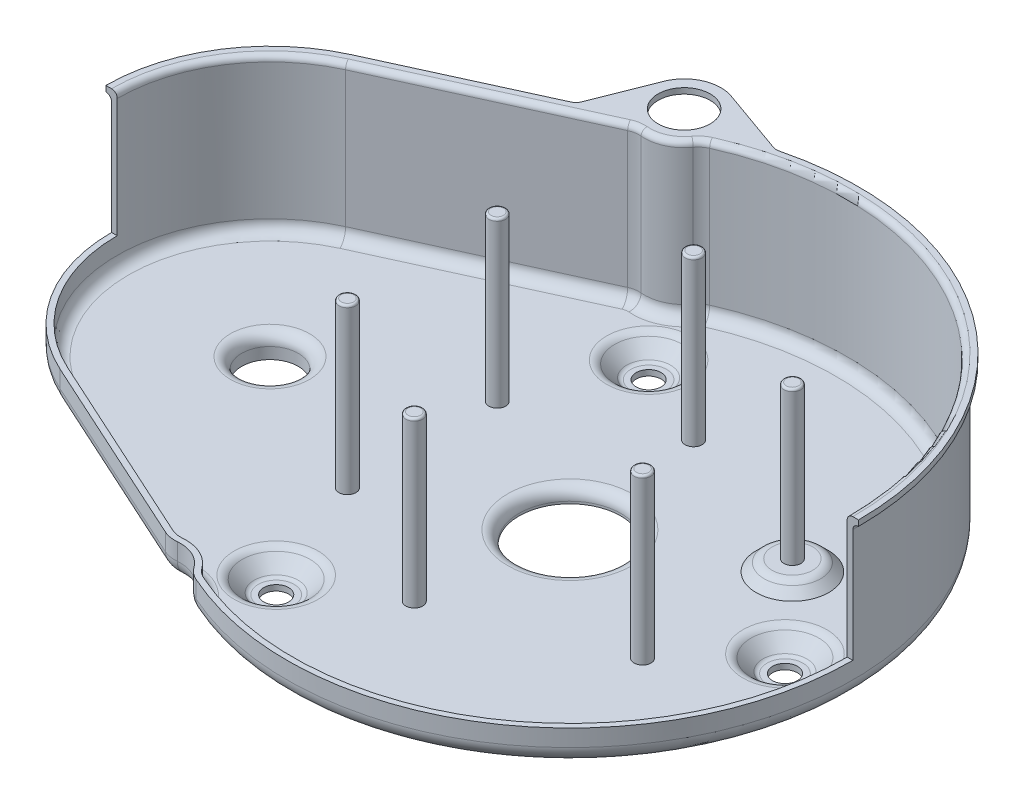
ISO-10303-21;
HEADER;
FILE_DESCRIPTION(('STEP AP214'),'2;1');
FILE_NAME('part.step','',(''),(''),'','','');
FILE_SCHEMA(('AUTOMOTIVE_DESIGN { 1 0 10303 214 1 1 1 1 }'));
ENDSEC;
DATA;
#1=APPLICATION_CONTEXT('core data for automotive mechanical design processes');
#2=APPLICATION_PROTOCOL_DEFINITION('international standard','automotive_design',2000,#1);
#3=PRODUCT_CONTEXT('',#1,'mechanical');
#4=PRODUCT('Part','Part','',(#3));
#5=PRODUCT_RELATED_PRODUCT_CATEGORY('part','',(#4));
#6=PRODUCT_DEFINITION_FORMATION('','',#4);
#7=PRODUCT_DEFINITION_CONTEXT('part definition',#1,'design');
#8=PRODUCT_DEFINITION('design','',#6,#7);
#9=PRODUCT_DEFINITION_SHAPE('','',#8);
#10=(LENGTH_UNIT() NAMED_UNIT(*) SI_UNIT(.MILLI.,.METRE.));
#11=(NAMED_UNIT(*) PLANE_ANGLE_UNIT() SI_UNIT($,.RADIAN.));
#12=(NAMED_UNIT(*) SI_UNIT($,.STERADIAN.) SOLID_ANGLE_UNIT());
#13=UNCERTAINTY_MEASURE_WITH_UNIT(LENGTH_MEASURE(1.E-05),#10,'distance_accuracy_value','');
#14=(GEOMETRIC_REPRESENTATION_CONTEXT(3) GLOBAL_UNCERTAINTY_ASSIGNED_CONTEXT((#13)) GLOBAL_UNIT_ASSIGNED_CONTEXT((#10,
#11,#12)) REPRESENTATION_CONTEXT('',''));
#15=CARTESIAN_POINT('',(0.,0.,0.));
#16=DIRECTION('',(0.,0.,1.));
#17=DIRECTION('',(1.,0.,0.));
#18=AXIS2_PLACEMENT_3D('',#15,#16,#17);
#19=CARTESIAN_POINT('',(-9.19417183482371,-14.,20.5357542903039));
#20=DIRECTION('',(0.,1.,0.));
#21=DIRECTION('',(0.,0.,1.));
#22=AXIS2_PLACEMENT_3D('',#19,#20,#21);
#23=CYLINDRICAL_SURFACE('',#22,2.5);
#24=DIRECTION('',(0.,1.,0.));
#25=VECTOR('',#24,1.);
#26=CARTESIAN_POINT('',(-10.2157464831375,-14.,22.8175047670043));
#27=LINE('',#26,#25);
#28=CARTESIAN_POINT('',(-10.2157464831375,-12.5,22.8175047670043));
#29=VERTEX_POINT('',#28);
#30=CARTESIAN_POINT('',(-10.2157464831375,-11.,22.8175047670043));
#31=VERTEX_POINT('',#30);
#32=EDGE_CURVE('E615',#29,#31,#27,.T.);
#33=ORIENTED_EDGE('',*,*,#32,.T.);
#34=CARTESIAN_POINT('',(-9.19417183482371,-11.,20.5357542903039));
#35=DIRECTION('',(0.,1.,0.));
#36=DIRECTION('',(0.,0.,1.));
#37=AXIS2_PLACEMENT_3D('',#34,#35,#36);
#38=CIRCLE('',#37,2.5);
#39=CARTESIAN_POINT('',(-11.2228212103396,-11.,21.9967750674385));
#40=VERTEX_POINT('',#39);
#41=EDGE_CURVE('E919',#31,#40,#38,.F.);
#42=ORIENTED_EDGE('',*,*,#41,.T.);
#43=DIRECTION('',(0.,1.,0.));
#44=VECTOR('',#43,1.);
#45=CARTESIAN_POINT('',(-11.2228212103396,-14.,21.9967750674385));
#46=LINE('',#45,#44);
#47=CARTESIAN_POINT('',(-11.2228212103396,-12.5,21.9967750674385));
#48=VERTEX_POINT('',#47);
#49=EDGE_CURVE('E618',#48,#40,#46,.T.);
#50=ORIENTED_EDGE('',*,*,#49,.F.);
#51=CARTESIAN_POINT('',(-9.19417183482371,-12.5,20.5357542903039));
#52=DIRECTION('',(0.,1.,0.));
#53=DIRECTION('',(0.,0.,1.));
#54=AXIS2_PLACEMENT_3D('',#51,#52,#53);
#55=CIRCLE('',#54,2.5);
#56=EDGE_CURVE('E654',#48,#29,#55,.T.);
#57=ORIENTED_EDGE('',*,*,#56,.T.);
#58=EDGE_LOOP('',(#33,#42,#50,#57));
#59=FACE_BOUND('',#58,.T.);
#60=ADVANCED_FACE('F37',(#59),#23,.T.);
#61=CARTESIAN_POINT('',(-13.6572004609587,-14.,23.75));
#62=DIRECTION('',(0.,1.,0.));
#63=DIRECTION('',(0.,0.,1.));
#64=AXIS2_PLACEMENT_3D('',#61,#62,#63);
#65=CYLINDRICAL_SURFACE('',#64,3.);
#66=ORIENTED_EDGE('',*,*,#49,.T.);
#67=CARTESIAN_POINT('',(-13.6572004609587,-11.,23.75));
#68=DIRECTION('',(0.,1.,0.));
#69=DIRECTION('',(0.,0.,1.));
#70=AXIS2_PLACEMENT_3D('',#67,#68,#69);
#71=CIRCLE('',#70,3.);
#72=CARTESIAN_POINT('',(-13.9291076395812,-11.,20.7623476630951));
#73=VERTEX_POINT('',#72);
#74=EDGE_CURVE('E916',#40,#73,#71,.T.);
#75=ORIENTED_EDGE('',*,*,#74,.T.);
#76=DIRECTION('',(0.,1.,0.));
#77=VECTOR('',#76,1.);
#78=CARTESIAN_POINT('',(-13.9291076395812,-14.,20.7623476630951));
#79=LINE('',#78,#77);
#80=CARTESIAN_POINT('',(-13.9291076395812,-12.5,20.7623476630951));
#81=VERTEX_POINT('',#80);
#82=EDGE_CURVE('E621',#81,#73,#79,.T.);
#83=ORIENTED_EDGE('',*,*,#82,.F.);
#84=CARTESIAN_POINT('',(-13.6572004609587,-12.5,23.75));
#85=DIRECTION('',(0.,1.,0.));
#86=DIRECTION('',(0.,0.,1.));
#87=AXIS2_PLACEMENT_3D('',#84,#85,#86);
#88=CIRCLE('',#87,3.);
#89=EDGE_CURVE('E658',#81,#48,#88,.F.);
#90=ORIENTED_EDGE('',*,*,#89,.T.);
#91=EDGE_LOOP('',(#66,#75,#83,#90));
#92=FACE_BOUND('',#91,.T.);
#93=ADVANCED_FACE('F1031',(#92),#65,.F.);
#94=CARTESIAN_POINT('',(-14.1556969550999,-14.,18.2726373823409));
#95=DIRECTION('',(0.,1.,0.));
#96=DIRECTION('',(0.,0.,1.));
#97=AXIS2_PLACEMENT_3D('',#94,#95,#96);
#98=CYLINDRICAL_SURFACE('',#97,2.5);
#99=ORIENTED_EDGE('',*,*,#82,.T.);
#100=CARTESIAN_POINT('',(-14.1556969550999,-11.,18.2726373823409));
#101=DIRECTION('',(0.,1.,0.));
#102=DIRECTION('',(0.,0.,1.));
#103=AXIS2_PLACEMENT_3D('',#100,#101,#102);
#104=CIRCLE('',#103,2.5);
#105=CARTESIAN_POINT('',(-15.1934328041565,-11.,20.5470833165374));
#106=VERTEX_POINT('',#105);
#107=EDGE_CURVE('E913',#73,#106,#104,.F.);
#108=ORIENTED_EDGE('',*,*,#107,.T.);
#109=DIRECTION('',(0.,1.,0.));
#110=VECTOR('',#109,1.);
#111=CARTESIAN_POINT('',(-15.1934328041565,-14.,20.5470833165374));
#112=LINE('',#111,#110);
#113=CARTESIAN_POINT('',(-15.1934328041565,-12.5,20.5470833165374));
#114=VERTEX_POINT('',#113);
#115=EDGE_CURVE('E624',#114,#106,#112,.T.);
#116=ORIENTED_EDGE('',*,*,#115,.F.);
#117=CARTESIAN_POINT('',(-14.1556969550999,-12.5,18.2726373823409));
#118=DIRECTION('',(0.,1.,0.));
#119=DIRECTION('',(0.,0.,1.));
#120=AXIS2_PLACEMENT_3D('',#117,#118,#119);
#121=CIRCLE('',#120,2.5);
#122=EDGE_CURVE('E662',#114,#81,#121,.T.);
#123=ORIENTED_EDGE('',*,*,#122,.T.);
#124=EDGE_LOOP('',(#99,#108,#116,#123));
#125=FACE_BOUND('',#124,.T.);
#126=ADVANCED_FACE('F1026',(#125),#98,.T.);
#127=CARTESIAN_POINT('',(-32.311320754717,-14.,12.7368972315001));
#128=DIRECTION('',(-0.415094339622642,0.,0.90977837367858));
#129=DIRECTION('',(0.90977837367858,0.,0.415094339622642));
#130=AXIS2_PLACEMENT_3D('',#127,#128,#129);
#131=PLANE('',#130);
#132=ORIENTED_EDGE('',*,*,#115,.T.);
#133=DIRECTION('',(-0.90977837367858,0.,-0.415094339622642));
#134=VECTOR('',#133,1.);
#135=CARTESIAN_POINT('',(-32.311320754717,-11.,12.7368972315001));
#136=LINE('',#135,#134);
#137=CARTESIAN_POINT('',(-32.311320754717,-11.,12.7368972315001));
#138=VERTEX_POINT('',#137);
#139=EDGE_CURVE('E910',#106,#138,#136,.T.);
#140=ORIENTED_EDGE('',*,*,#139,.T.);
#141=DIRECTION('',(0.,1.,0.));
#142=VECTOR('',#141,1.);
#143=CARTESIAN_POINT('',(-32.311320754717,-14.,12.7368972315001));
#144=LINE('',#143,#142);
#145=CARTESIAN_POINT('',(-32.311320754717,-12.5,12.7368972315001));
#146=VERTEX_POINT('',#145);
#147=EDGE_CURVE('E598',#146,#138,#144,.T.);
#148=ORIENTED_EDGE('',*,*,#147,.F.);
#149=DIRECTION('',(0.90977837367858,0.,0.415094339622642));
#150=VECTOR('',#149,1.);
#151=CARTESIAN_POINT('',(-15.1934328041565,-12.5,20.5470833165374));
#152=LINE('',#151,#150);
#153=EDGE_CURVE('E666',#146,#114,#152,.T.);
#154=ORIENTED_EDGE('',*,*,#153,.T.);
#155=EDGE_LOOP('',(#132,#140,#148,#154));
#156=FACE_BOUND('',#155,.T.);
#157=ADVANCED_FACE('F1024',(#156),#131,.T.);
#158=CARTESIAN_POINT('',(-9.19417183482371,-14.,20.5357542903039));
#159=DIRECTION('',(0.,1.,0.));
#160=DIRECTION('',(0.,0.,1.));
#161=AXIS2_PLACEMENT_3D('',#158,#159,#160);
#162=CYLINDRICAL_SURFACE('',#161,2.);
#163=CARTESIAN_POINT('',(-9.19417183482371,-11.,20.5357542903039));
#164=DIRECTION('',(0.,1.,0.));
#165=DIRECTION('',(0.,0.,1.));
#166=AXIS2_PLACEMENT_3D('',#163,#164,#165);
#167=CIRCLE('',#166,2.);
#168=CARTESIAN_POINT('',(-10.0114315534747,-11.,22.3611546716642));
#169=VERTEX_POINT('',#168);
#170=CARTESIAN_POINT('',(-10.8170913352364,-11.,21.7045709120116));
#171=VERTEX_POINT('',#170);
#172=EDGE_CURVE('E904',#169,#171,#167,.F.);
#173=ORIENTED_EDGE('',*,*,#172,.F.);
#174=DIRECTION('',(0.,1.,0.));
#175=VECTOR('',#174,1.);
#176=CARTESIAN_POINT('',(-10.0114315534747,-14.,22.3611546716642));
#177=LINE('',#176,#175);
#178=CARTESIAN_POINT('',(-10.0114315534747,-12.5,22.3611546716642));
#179=VERTEX_POINT('',#178);
#180=EDGE_CURVE('E518',#179,#169,#177,.T.);
#181=ORIENTED_EDGE('',*,*,#180,.F.);
#182=CARTESIAN_POINT('',(-9.19417183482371,-12.5,20.5357542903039));
#183=DIRECTION('',(0.,1.,0.));
#184=DIRECTION('',(0.,0.,1.));
#185=AXIS2_PLACEMENT_3D('',#182,#183,#184);
#186=CIRCLE('',#185,2.);
#187=CARTESIAN_POINT('',(-10.8170913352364,-12.5,21.7045709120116));
#188=VERTEX_POINT('',#187);
#189=EDGE_CURVE('E515',#188,#179,#186,.T.);
#190=ORIENTED_EDGE('',*,*,#189,.F.);
#191=DIRECTION('',(0.,1.,0.));
#192=VECTOR('',#191,1.);
#193=CARTESIAN_POINT('',(-10.8170913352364,-14.,21.7045709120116));
#194=LINE('',#193,#192);
#195=EDGE_CURVE('E522',#188,#171,#194,.T.);
#196=ORIENTED_EDGE('',*,*,#195,.T.);
#197=EDGE_LOOP('',(#173,#181,#190,#196));
#198=FACE_BOUND('',#197,.T.);
#199=ADVANCED_FACE('F1159',(#198),#162,.F.);
#200=CARTESIAN_POINT('',(-13.6572004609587,-14.,23.75));
#201=DIRECTION('',(0.,1.,0.));
#202=DIRECTION('',(0.,0.,1.));
#203=AXIS2_PLACEMENT_3D('',#200,#201,#202);
#204=CYLINDRICAL_SURFACE('',#203,3.5);
#205=CARTESIAN_POINT('',(-13.6572004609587,-11.,23.75));
#206=DIRECTION('',(0.,1.,0.));
#207=DIRECTION('',(0.,0.,1.));
#208=AXIS2_PLACEMENT_3D('',#205,#206,#207);
#209=CIRCLE('',#208,3.5);
#210=CARTESIAN_POINT('',(-13.9744255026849,-11.,20.2644056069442));
#211=VERTEX_POINT('',#210);
#212=EDGE_CURVE('E902',#171,#211,#209,.T.);
#213=ORIENTED_EDGE('',*,*,#212,.F.);
#214=ORIENTED_EDGE('',*,*,#195,.F.);
#215=CARTESIAN_POINT('',(-13.6572004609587,-12.5,23.75));
#216=DIRECTION('',(0.,1.,0.));
#217=DIRECTION('',(0.,0.,1.));
#218=AXIS2_PLACEMENT_3D('',#215,#216,#217);
#219=CIRCLE('',#218,3.5);
#220=CARTESIAN_POINT('',(-13.9744255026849,-12.5,20.2644056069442));
#221=VERTEX_POINT('',#220);
#222=EDGE_CURVE('E509',#221,#188,#219,.F.);
#223=ORIENTED_EDGE('',*,*,#222,.F.);
#224=DIRECTION('',(0.,1.,0.));
#225=VECTOR('',#224,1.);
#226=CARTESIAN_POINT('',(-13.9744255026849,-14.,20.2644056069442));
#227=LINE('',#226,#225);
#228=EDGE_CURVE('E527',#221,#211,#227,.T.);
#229=ORIENTED_EDGE('',*,*,#228,.T.);
#230=EDGE_LOOP('',(#213,#214,#223,#229));
#231=FACE_BOUND('',#230,.T.);
#232=ADVANCED_FACE('F1479',(#231),#204,.T.);
#233=CARTESIAN_POINT('',(-14.1556969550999,-14.,18.2726373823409));
#234=DIRECTION('',(0.,1.,0.));
#235=DIRECTION('',(0.,0.,1.));
#236=AXIS2_PLACEMENT_3D('',#233,#234,#235);
#237=CYLINDRICAL_SURFACE('',#236,2.);
#238=CARTESIAN_POINT('',(-14.1556969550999,-11.,18.2726373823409));
#239=DIRECTION('',(0.,1.,0.));
#240=DIRECTION('',(0.,0.,1.));
#241=AXIS2_PLACEMENT_3D('',#238,#239,#240);
#242=CIRCLE('',#241,2.);
#243=CARTESIAN_POINT('',(-14.9858856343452,-11.,20.0921941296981));
#244=VERTEX_POINT('',#243);
#245=EDGE_CURVE('E900',#211,#244,#242,.F.);
#246=ORIENTED_EDGE('',*,*,#245,.F.);
#247=ORIENTED_EDGE('',*,*,#228,.F.);
#248=CARTESIAN_POINT('',(-14.1556969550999,-12.5,18.2726373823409));
#249=DIRECTION('',(0.,1.,0.));
#250=DIRECTION('',(0.,0.,1.));
#251=AXIS2_PLACEMENT_3D('',#248,#249,#250);
#252=CIRCLE('',#251,2.);
#253=CARTESIAN_POINT('',(-14.9858856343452,-12.5,20.0921941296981));
#254=VERTEX_POINT('',#253);
#255=EDGE_CURVE('E503',#254,#221,#252,.T.);
#256=ORIENTED_EDGE('',*,*,#255,.F.);
#257=DIRECTION('',(0.,1.,0.));
#258=VECTOR('',#257,1.);
#259=CARTESIAN_POINT('',(-14.9858856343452,-14.,20.0921941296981));
#260=LINE('',#259,#258);
#261=EDGE_CURVE('E497',#254,#244,#260,.T.);
#262=ORIENTED_EDGE('',*,*,#261,.T.);
#263=EDGE_LOOP('',(#246,#247,#256,#262));
#264=FACE_BOUND('',#263,.T.);
#265=ADVANCED_FACE('F1488',(#264),#237,.F.);
#266=CARTESIAN_POINT('',(-32.1037735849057,-14.,12.2820080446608));
#267=DIRECTION('',(-0.415094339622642,0.,0.90977837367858));
#268=DIRECTION('',(0.90977837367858,0.,0.415094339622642));
#269=AXIS2_PLACEMENT_3D('',#266,#267,#268);
#270=PLANE('',#269);
#271=DIRECTION('',(-0.90977837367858,0.,-0.415094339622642));
#272=VECTOR('',#271,1.);
#273=CARTESIAN_POINT('',(-32.1037735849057,-11.,12.2820080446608));
#274=LINE('',#273,#272);
#275=CARTESIAN_POINT('',(-32.1037735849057,-11.,12.2820080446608));
#276=VERTEX_POINT('',#275);
#277=EDGE_CURVE('E11',#244,#276,#274,.T.);
#278=ORIENTED_EDGE('',*,*,#277,.F.);
#279=ORIENTED_EDGE('',*,*,#261,.F.);
#280=DIRECTION('',(0.90977837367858,0.,0.415094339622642));
#281=VECTOR('',#280,1.);
#282=CARTESIAN_POINT('',(-32.1037735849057,-12.5,12.2820080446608));
#283=LINE('',#282,#281);
#284=CARTESIAN_POINT('',(-32.1037735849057,-12.5,12.2820080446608));
#285=VERTEX_POINT('',#284);
#286=EDGE_CURVE('E490',#285,#254,#283,.T.);
#287=ORIENTED_EDGE('',*,*,#286,.F.);
#288=DIRECTION('',(0.,1.,0.));
#289=VECTOR('',#288,1.);
#290=CARTESIAN_POINT('',(-32.1037735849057,-14.,12.2820080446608));
#291=LINE('',#290,#289);
#292=EDGE_CURVE('E494',#285,#276,#291,.T.);
#293=ORIENTED_EDGE('',*,*,#292,.T.);
#294=EDGE_LOOP('',(#278,#279,#287,#293));
#295=FACE_BOUND('',#294,.T.);
#296=ADVANCED_FACE('F1497',(#295),#270,.F.);
#297=CARTESIAN_POINT('',(-26.5,-13.5,0.));
#298=DIRECTION('',(0.,1.,0.));
#299=DIRECTION('',(0.,0.,1.));
#300=AXIS2_PLACEMENT_3D('',#297,#298,#299);
#301=PLANE('',#300);
#302=CARTESIAN_POINT('',(-13.0398493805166,-13.5,-6.61999586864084));
#303=DIRECTION('',(0.,1.,0.));
#304=DIRECTION('',(0.,0.,1.));
#305=AXIS2_PLACEMENT_3D('',#302,#303,#304);
#306=CIRCLE('',#305,0.75);
#307=CARTESIAN_POINT('',(-13.0398493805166,-13.5,-7.36999586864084));
#308=VERTEX_POINT('',#307);
#309=EDGE_CURVE('E929',#308,#308,#306,.T.);
#310=ORIENTED_EDGE('',*,*,#309,.F.);
#311=EDGE_LOOP('',(#310));
#312=FACE_BOUND('',#311,.T.);
#313=CARTESIAN_POINT('',(-1.41027924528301,-13.5,12.3396722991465));
#314=DIRECTION('',(0.,1.,0.));
#315=DIRECTION('',(0.,0.,1.));
#316=AXIS2_PLACEMENT_3D('',#313,#314,#315);
#317=CIRCLE('',#316,0.75);
#318=CARTESIAN_POINT('',(-1.41027924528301,-13.5,11.5896722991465));
#319=VERTEX_POINT('',#318);
#320=EDGE_CURVE('E935',#319,#319,#317,.T.);
#321=ORIENTED_EDGE('',*,*,#320,.F.);
#322=EDGE_LOOP('',(#321));
#323=FACE_BOUND('',#322,.T.);
#324=CARTESIAN_POINT('',(-9.19417183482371,-13.5,-20.5357542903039));
#325=DIRECTION('',(0.,1.,0.));
#326=DIRECTION('',(0.,0.,1.));
#327=AXIS2_PLACEMENT_3D('',#324,#325,#326);
#328=CIRCLE('',#327,1.);
#329=CARTESIAN_POINT('',(-10.0056315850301,-13.5,-21.1201626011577));
#330=VERTEX_POINT('',#329);
#331=CARTESIAN_POINT('',(-9.60280169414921,-13.5,-21.4484544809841));
#332=VERTEX_POINT('',#331);
#333=EDGE_CURVE('E450',#330,#332,#328,.F.);
#334=ORIENTED_EDGE('',*,*,#333,.F.);
#335=CARTESIAN_POINT('',(-13.6572004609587,-13.5,-23.75));
#336=DIRECTION('',(0.,1.,0.));
#337=DIRECTION('',(0.,0.,1.));
#338=AXIS2_PLACEMENT_3D('',#335,#336,#337);
#339=CIRCLE('',#338,4.5);
#340=CARTESIAN_POINT('',(-14.0650612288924,-13.5,-19.2685214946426));
#341=VERTEX_POINT('',#340);
#342=EDGE_CURVE('E458',#341,#330,#339,.T.);
#343=ORIENTED_EDGE('',*,*,#342,.F.);
#344=CARTESIAN_POINT('',(-14.1556969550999,-13.5,-18.2726373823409));
#345=DIRECTION('',(0.,1.,0.));
#346=DIRECTION('',(0.,0.,1.));
#347=AXIS2_PLACEMENT_3D('',#344,#345,#346);
#348=CIRCLE('',#347,1.);
#349=CARTESIAN_POINT('',(-14.5707912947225,-13.5,-19.1824157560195));
#350=VERTEX_POINT('',#349);
#351=EDGE_CURVE('E461',#350,#341,#348,.F.);
#352=ORIENTED_EDGE('',*,*,#351,.F.);
#353=DIRECTION('',(0.909778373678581,0.,-0.415094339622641));
#354=VECTOR('',#353,1.);
#355=CARTESIAN_POINT('',(-31.688679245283,-13.5,-11.3722296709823));
#356=LINE('',#355,#354);
#357=CARTESIAN_POINT('',(-31.688679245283,-13.5,-11.3722296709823));
#358=VERTEX_POINT('',#357);
#359=EDGE_CURVE('E464',#358,#350,#356,.T.);
#360=ORIENTED_EDGE('',*,*,#359,.F.);
#361=CARTESIAN_POINT('',(-26.5,-13.5,0.));
#362=DIRECTION('',(0.,1.,0.));
#363=DIRECTION('',(0.,0.,1.));
#364=AXIS2_PLACEMENT_3D('',#361,#362,#363);
#365=CIRCLE('',#364,12.5);
#366=CARTESIAN_POINT('',(-31.688679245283,-13.5,11.3722296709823));
#367=VERTEX_POINT('',#366);
#368=EDGE_CURVE('E467',#367,#358,#365,.F.);
#369=ORIENTED_EDGE('',*,*,#368,.F.);
#370=DIRECTION('',(-0.90977837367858,0.,-0.415094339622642));
#371=VECTOR('',#370,1.);
#372=CARTESIAN_POINT('',(-31.688679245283,-13.5,11.3722296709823));
#373=LINE('',#372,#371);
#374=CARTESIAN_POINT('',(-14.5707912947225,-13.5,19.1824157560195));
#375=VERTEX_POINT('',#374);
#376=EDGE_CURVE('E465',#375,#367,#373,.T.);
#377=ORIENTED_EDGE('',*,*,#376,.F.);
#378=CARTESIAN_POINT('',(-14.1556969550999,-13.5,18.2726373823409));
#379=DIRECTION('',(0.,1.,0.));
#380=DIRECTION('',(0.,0.,1.));
#381=AXIS2_PLACEMENT_3D('',#378,#379,#380);
#382=CIRCLE('',#381,1.);
#383=CARTESIAN_POINT('',(-14.0650612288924,-13.5,19.2685214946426));
#384=VERTEX_POINT('',#383);
#385=EDGE_CURVE('E462',#384,#375,#382,.F.);
#386=ORIENTED_EDGE('',*,*,#385,.F.);
#387=CARTESIAN_POINT('',(-13.6572004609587,-13.5,23.75));
#388=DIRECTION('',(0.,1.,0.));
#389=DIRECTION('',(0.,0.,1.));
#390=AXIS2_PLACEMENT_3D('',#387,#388,#389);
#391=CIRCLE('',#390,4.5);
#392=CARTESIAN_POINT('',(-10.0056315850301,-13.5,21.1201626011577));
#393=VERTEX_POINT('',#392);
#394=EDGE_CURVE('E459',#393,#384,#391,.T.);
#395=ORIENTED_EDGE('',*,*,#394,.F.);
#396=CARTESIAN_POINT('',(-9.19417183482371,-13.5,20.5357542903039));
#397=DIRECTION('',(0.,1.,0.));
#398=DIRECTION('',(0.,0.,1.));
#399=AXIS2_PLACEMENT_3D('',#396,#397,#398);
#400=CIRCLE('',#399,1.);
#401=CARTESIAN_POINT('',(-9.60280169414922,-13.5,21.4484544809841));
#402=VERTEX_POINT('',#401);
#403=EDGE_CURVE('E453',#402,#393,#400,.F.);
#404=ORIENTED_EDGE('',*,*,#403,.F.);
#405=CARTESIAN_POINT('',(0.,-13.5,0.));
#406=DIRECTION('',(0.,1.,0.));
#407=DIRECTION('',(0.,0.,1.));
#408=AXIS2_PLACEMENT_3D('',#405,#406,#407);
#409=CIRCLE('',#408,23.5);
#410=EDGE_CURVE('E452',#332,#402,#409,.F.);
#411=ORIENTED_EDGE('',*,*,#410,.F.);
#412=EDGE_LOOP('',(#334,#343,#352,#360,#369,#377,#386,#395,#404,#411));
#413=FACE_BOUND('',#412,.T.);
#414=CARTESIAN_POINT('',(-9.50000000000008,-13.5,-16.4544826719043));
#415=DIRECTION('',(0.,1.,0.));
#416=DIRECTION('',(0.,0.,1.));
#417=AXIS2_PLACEMENT_3D('',#414,#415,#416);
#418=CIRCLE('',#417,3.70710678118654);
#419=CARTESIAN_POINT('',(-9.50000000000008,-13.5,-12.7473758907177));
#420=VERTEX_POINT('',#419);
#421=EDGE_CURVE('E446',#420,#420,#418,.T.);
#422=ORIENTED_EDGE('',*,*,#421,.F.);
#423=EDGE_LOOP('',(#422));
#424=FACE_BOUND('',#423,.T.);
#425=CARTESIAN_POINT('',(19.,-13.5,0.));
#426=DIRECTION('',(0.,1.,0.));
#427=DIRECTION('',(0.,0.,1.));
#428=AXIS2_PLACEMENT_3D('',#425,#426,#427);
#429=CIRCLE('',#428,3.70710678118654);
#430=CARTESIAN_POINT('',(19.,-13.5,3.70710678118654));
#431=VERTEX_POINT('',#430);
#432=EDGE_CURVE('E443',#431,#431,#429,.T.);
#433=ORIENTED_EDGE('',*,*,#432,.F.);
#434=EDGE_LOOP('',(#433));
#435=FACE_BOUND('',#434,.T.);
#436=CARTESIAN_POINT('',(-9.49999999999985,-13.5,16.4544826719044));
#437=DIRECTION('',(0.,1.,0.));
#438=DIRECTION('',(0.,0.,1.));
#439=AXIS2_PLACEMENT_3D('',#436,#437,#438);
#440=CIRCLE('',#439,3.70710678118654);
#441=CARTESIAN_POINT('',(-9.49999999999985,-13.5,20.161589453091));
#442=VERTEX_POINT('',#441);
#443=EDGE_CURVE('E440',#442,#442,#440,.T.);
#444=ORIENTED_EDGE('',*,*,#443,.F.);
#445=EDGE_LOOP('',(#444));
#446=FACE_BOUND('',#445,.T.);
#447=CARTESIAN_POINT('',(-26.5,-13.5,0.));
#448=DIRECTION('',(0.,1.,0.));
#449=DIRECTION('',(0.,0.,1.));
#450=AXIS2_PLACEMENT_3D('',#447,#448,#449);
#451=CIRCLE('',#450,3.5);
#452=CARTESIAN_POINT('',(-26.5,-13.5,3.5));
#453=VERTEX_POINT('',#452);
#454=EDGE_CURVE('E437',#453,#453,#451,.T.);
#455=ORIENTED_EDGE('',*,*,#454,.F.);
#456=EDGE_LOOP('',(#455));
#457=FACE_BOUND('',#456,.T.);
#458=CARTESIAN_POINT('',(0.,-13.5,0.));
#459=DIRECTION('',(0.,1.,0.));
#460=DIRECTION('',(0.,0.,1.));
#461=AXIS2_PLACEMENT_3D('',#458,#459,#460);
#462=CIRCLE('',#461,5.5);
#463=CARTESIAN_POINT('',(0.,-13.5,5.5));
#464=VERTEX_POINT('',#463);
#465=EDGE_CURVE('E434',#464,#464,#462,.T.);
#466=ORIENTED_EDGE('',*,*,#465,.F.);
#467=EDGE_LOOP('',(#466));
#468=FACE_BOUND('',#467,.T.);
#469=CARTESIAN_POINT('',(13.04,-13.5,-6.62));
#470=DIRECTION('',(0.,1.,0.));
#471=DIRECTION('',(0.,0.,1.));
#472=AXIS2_PLACEMENT_3D('',#469,#470,#471);
#473=CIRCLE('',#472,3.20710678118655);
#474=CARTESIAN_POINT('',(13.04,-13.5,-3.41289321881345));
#475=VERTEX_POINT('',#474);
#476=EDGE_CURVE('E430',#475,#475,#473,.T.);
#477=ORIENTED_EDGE('',*,*,#476,.F.);
#478=EDGE_LOOP('',(#477));
#479=FACE_BOUND('',#478,.T.);
#480=CARTESIAN_POINT('',(13.0398493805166,-13.5,6.61999586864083));
#481=DIRECTION('',(0.,1.,0.));
#482=DIRECTION('',(0.,0.,1.));
#483=AXIS2_PLACEMENT_3D('',#480,#481,#482);
#484=CIRCLE('',#483,0.75);
#485=CARTESIAN_POINT('',(13.0398493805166,-13.5,5.86999586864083));
#486=VERTEX_POINT('',#485);
#487=EDGE_CURVE('E938',#486,#486,#484,.T.);
#488=ORIENTED_EDGE('',*,*,#487,.F.);
#489=EDGE_LOOP('',(#488));
#490=FACE_BOUND('',#489,.T.);
#491=CARTESIAN_POINT('',(-13.0398493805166,-13.5,6.61999586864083));
#492=DIRECTION('',(0.,1.,0.));
#493=DIRECTION('',(0.,0.,1.));
#494=AXIS2_PLACEMENT_3D('',#491,#492,#493);
#495=CIRCLE('',#494,0.75);
#496=CARTESIAN_POINT('',(-13.0398493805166,-13.5,5.86999586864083));
#497=VERTEX_POINT('',#496);
#498=EDGE_CURVE('E932',#497,#497,#495,.T.);
#499=ORIENTED_EDGE('',*,*,#498,.F.);
#500=EDGE_LOOP('',(#499));
#501=FACE_BOUND('',#500,.T.);
#502=CARTESIAN_POINT('',(-1.41027924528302,-13.5,-12.3396722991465));
#503=DIRECTION('',(0.,1.,0.));
#504=DIRECTION('',(0.,0.,1.));
#505=AXIS2_PLACEMENT_3D('',#502,#503,#504);
#506=CIRCLE('',#505,0.75);
#507=CARTESIAN_POINT('',(-1.41027924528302,-13.5,-13.0896722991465));
#508=VERTEX_POINT('',#507);
#509=EDGE_CURVE('E926',#508,#508,#506,.T.);
#510=ORIENTED_EDGE('',*,*,#509,.F.);
#511=EDGE_LOOP('',(#510));
#512=FACE_BOUND('',#511,.T.);
#513=ADVANCED_FACE('F1505',(#312,#323,#413,#424,#435,#446,#457,#468,#479,#490,#501,#512),#301,.T.);
#514=CARTESIAN_POINT('',(13.04,-13.,-6.62));
#515=DIRECTION('',(0.,-1.,0.));
#516=DIRECTION('',(0.,0.,-1.));
#517=AXIS2_PLACEMENT_3D('',#514,#515,#516);
#518=PLANE('',#517);
#519=CARTESIAN_POINT('',(13.04,-13.,-6.62));
#520=DIRECTION('',(0.,-1.,0.));
#521=DIRECTION('',(0.,0.,-1.));
#522=AXIS2_PLACEMENT_3D('',#519,#520,#521);
#523=CIRCLE('',#522,1.79289321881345);
#524=CARTESIAN_POINT('',(13.04,-13.,-8.41289321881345));
#525=VERTEX_POINT('',#524);
#526=EDGE_CURVE('E738',#525,#525,#523,.T.);
#527=ORIENTED_EDGE('',*,*,#526,.T.);
#528=EDGE_LOOP('',(#527));
#529=FACE_BOUND('',#528,.T.);
#530=CARTESIAN_POINT('',(13.0398493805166,-13.,-6.61999586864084));
#531=DIRECTION('',(0.,-1.,0.));
#532=DIRECTION('',(0.,0.,-1.));
#533=AXIS2_PLACEMENT_3D('',#530,#531,#532);
#534=CIRCLE('',#533,0.75);
#535=CARTESIAN_POINT('',(13.0398493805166,-13.,-7.36999586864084));
#536=VERTEX_POINT('',#535);
#537=EDGE_CURVE('E827',#536,#536,#534,.F.);
#538=ORIENTED_EDGE('',*,*,#537,.T.);
#539=EDGE_LOOP('',(#538));
#540=FACE_BOUND('',#539,.T.);
#541=ADVANCED_FACE('F1559',(#529,#540),#518,.T.);
#542=CARTESIAN_POINT('',(13.04,-12.5,-6.62));
#543=DIRECTION('',(0.,-1.,0.));
#544=DIRECTION('',(0.,0.,-1.));
#545=AXIS2_PLACEMENT_3D('',#542,#543,#544);
#546=PLANE('',#545);
#547=CARTESIAN_POINT('',(13.04,-12.5,-6.62));
#548=DIRECTION('',(0.,-1.,0.));
#549=DIRECTION('',(0.,0.,-1.));
#550=AXIS2_PLACEMENT_3D('',#547,#548,#549);
#551=CIRCLE('',#550,1.79289321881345);
#552=CARTESIAN_POINT('',(13.04,-12.5,-8.41289321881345));
#553=VERTEX_POINT('',#552);
#554=EDGE_CURVE('E475',#553,#553,#551,.T.);
#555=ORIENTED_EDGE('',*,*,#554,.F.);
#556=EDGE_LOOP('',(#555));
#557=FACE_BOUND('',#556,.T.);
#558=CARTESIAN_POINT('',(13.0398493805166,-12.5,-6.61999586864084));
#559=DIRECTION('',(0.,-1.,0.));
#560=DIRECTION('',(0.,0.,-1.));
#561=AXIS2_PLACEMENT_3D('',#558,#559,#560);
#562=CIRCLE('',#561,0.75);
#563=CARTESIAN_POINT('',(13.0398493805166,-12.5,-7.36999586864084));
#564=VERTEX_POINT('',#563);
#565=EDGE_CURVE('E806',#564,#564,#562,.F.);
#566=ORIENTED_EDGE('',*,*,#565,.F.);
#567=EDGE_LOOP('',(#566));
#568=FACE_BOUND('',#567,.T.);
#569=ADVANCED_FACE('F1568',(#557,#568),#546,.F.);
#570=CARTESIAN_POINT('',(-19.63420117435,-0.5,-20.1696971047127));
#571=DIRECTION('',(0.,-1.,0.));
#572=DIRECTION('',(0.,0.,-1.));
#573=AXIS2_PLACEMENT_3D('',#570,#571,#572);
#574=PLANE('',#573);
#575=CARTESIAN_POINT('',(-13.6572004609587,-0.5,-23.75));
#576=DIRECTION('',(0.,1.,0.));
#577=DIRECTION('',(0.,0.,1.));
#578=AXIS2_PLACEMENT_3D('',#575,#576,#577);
#579=CIRCLE('',#578,2.3);
#580=CARTESIAN_POINT('',(-13.6572004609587,-0.5,-21.45));
#581=VERTEX_POINT('',#580);
#582=EDGE_CURVE('E946',#581,#581,#579,.T.);
#583=ORIENTED_EDGE('',*,*,#582,.T.);
#584=EDGE_LOOP('',(#583));
#585=FACE_BOUND('',#584,.T.);
#586=CARTESIAN_POINT('',(-6.45330478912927,-0.5,-25.7022344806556));
#587=DIRECTION('',(0.,-1.,0.));
#588=DIRECTION('',(0.,0.,1.));
#589=AXIS2_PLACEMENT_3D('',#586,#587,#588);
#590=CIRCLE('',#589,0.999999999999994);
#591=CARTESIAN_POINT('',(-6.20978385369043,-0.5,-24.7323388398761));
#592=VERTEX_POINT('',#591);
#593=CARTESIAN_POINT('',(-6.78788456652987,-0.5,-24.7598670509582));
#594=VERTEX_POINT('',#593);
#595=EDGE_CURVE('E959',#592,#594,#590,.T.);
#596=ORIENTED_EDGE('',*,*,#595,.F.);
#597=CARTESIAN_POINT('',(0.,-0.5,0.));
#598=DIRECTION('',(0.,-1.,0.));
#599=DIRECTION('',(0.,0.,-1.));
#600=AXIS2_PLACEMENT_3D('',#597,#598,#599);
#601=CIRCLE('',#600,25.5);
#602=CARTESIAN_POINT('',(-10.4200614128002,-0.5,-23.2738548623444));
#603=VERTEX_POINT('',#602);
#604=EDGE_CURVE('E778',#592,#603,#601,.F.);
#605=ORIENTED_EDGE('',*,*,#604,.T.);
#606=CARTESIAN_POINT('',(-9.19417183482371,-0.5,-20.5357542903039));
#607=DIRECTION('',(0.,-1.,0.));
#608=DIRECTION('',(0.,0.,-1.));
#609=AXIS2_PLACEMENT_3D('',#606,#607,#608);
#610=CIRCLE('',#609,3.);
#611=CARTESIAN_POINT('',(-11.6285510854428,-0.5,-22.2889792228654));
#612=VERTEX_POINT('',#611);
#613=EDGE_CURVE('E775',#603,#612,#610,.F.);
#614=ORIENTED_EDGE('',*,*,#613,.T.);
#615=CARTESIAN_POINT('',(-13.6572004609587,-0.5,-23.75));
#616=DIRECTION('',(0.,-1.,0.));
#617=DIRECTION('',(0.,0.,-1.));
#618=AXIS2_PLACEMENT_3D('',#615,#616,#617);
#619=CIRCLE('',#618,2.5);
#620=CARTESIAN_POINT('',(-13.8837897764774,-0.5,-21.2602897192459));
#621=VERTEX_POINT('',#620);
#622=EDGE_CURVE('E773',#612,#621,#619,.T.);
#623=ORIENTED_EDGE('',*,*,#622,.T.);
#624=CARTESIAN_POINT('',(-14.1556969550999,-0.5,-18.2726373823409));
#625=DIRECTION('',(0.,-1.,0.));
#626=DIRECTION('',(0.,0.,-1.));
#627=AXIS2_PLACEMENT_3D('',#624,#625,#626);
#628=CIRCLE('',#627,3.);
#629=CARTESIAN_POINT('',(-15.4009799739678,-0.5,-21.0019725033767));
#630=VERTEX_POINT('',#629);
#631=EDGE_CURVE('E771',#621,#630,#628,.F.);
#632=ORIENTED_EDGE('',*,*,#631,.T.);
#633=DIRECTION('',(-0.909778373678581,0.,0.415094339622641));
#634=VECTOR('',#633,1.);
#635=CARTESIAN_POINT('',(-32.5188679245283,-0.5,-13.1917864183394));
#636=LINE('',#635,#634);
#637=CARTESIAN_POINT('',(-19.2191068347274,-0.5,-19.2599187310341));
#638=VERTEX_POINT('',#637);
#639=EDGE_CURVE('E769',#630,#638,#636,.T.);
#640=ORIENTED_EDGE('',*,*,#639,.T.);
#641=CARTESIAN_POINT('',(-19.63420117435,-0.5,-20.1696971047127));
#642=DIRECTION('',(0.,-1.,0.));
#643=DIRECTION('',(0.,0.,-1.));
#644=AXIS2_PLACEMENT_3D('',#641,#642,#643);
#645=CIRCLE('',#644,0.999999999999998);
#646=CARTESIAN_POINT('',(-18.7037120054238,-0.5,-19.8033776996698));
#647=VERTEX_POINT('',#646);
#648=EDGE_CURVE('E394',#647,#638,#645,.T.);
#649=ORIENTED_EDGE('',*,*,#648,.F.);
#650=DIRECTION('',(-0.366319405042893,0.,0.930489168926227));
#651=VECTOR('',#650,1.);
#652=CARTESIAN_POINT('',(-16.6812902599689,-0.5,-24.9405380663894));
#653=LINE('',#652,#651);
#654=CARTESIAN_POINT('',(-16.6812902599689,-0.5,-24.9405380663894));
#655=VERTEX_POINT('',#654);
#656=EDGE_CURVE('E411',#655,#647,#653,.T.);
#657=ORIENTED_EDGE('',*,*,#656,.F.);
#658=CARTESIAN_POINT('',(-13.6572004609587,-0.5,-23.75));
#659=DIRECTION('',(0.,1.,0.));
#660=DIRECTION('',(0.,0.,1.));
#661=AXIS2_PLACEMENT_3D('',#658,#659,#660);
#662=CIRCLE('',#661,3.25);
#663=CARTESIAN_POINT('',(-12.5698161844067,-0.5,-26.8126941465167));
#664=VERTEX_POINT('',#663);
#665=EDGE_CURVE('E965',#664,#655,#662,.T.);
#666=ORIENTED_EDGE('',*,*,#665,.F.);
#667=DIRECTION('',(-0.942367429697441,0.,-0.334579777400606));
#668=VECTOR('',#667,1.);
#669=CARTESIAN_POINT('',(-12.5698161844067,-0.5,-26.8126941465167));
#670=LINE('',#669,#668);
#671=EDGE_CURVE('E962',#594,#664,#670,.T.);
#672=ORIENTED_EDGE('',*,*,#671,.F.);
#673=EDGE_LOOP('',(#596,#605,#614,#623,#632,#640,#649,#657,#666,#672));
#674=FACE_BOUND('',#673,.T.);
#675=ADVANCED_FACE('F1072',(#585,#674),#574,.T.);
#676=CARTESIAN_POINT('',(-26.5,-14.,0.));
#677=DIRECTION('',(0.,1.,0.));
#678=DIRECTION('',(0.,0.,1.));
#679=AXIS2_PLACEMENT_3D('',#676,#677,#678);
#680=PLANE('',#679);
#681=CARTESIAN_POINT('',(13.04,-14.,-6.62));
#682=DIRECTION('',(0.,1.,0.));
#683=DIRECTION('',(0.,0.,1.));
#684=AXIS2_PLACEMENT_3D('',#681,#682,#683);
#685=CIRCLE('',#684,3.20710678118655);
#686=CARTESIAN_POINT('',(13.04,-14.,-3.41289321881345));
#687=VERTEX_POINT('',#686);
#688=EDGE_CURVE('E729',#687,#687,#685,.T.);
#689=ORIENTED_EDGE('',*,*,#688,.T.);
#690=EDGE_LOOP('',(#689));
#691=FACE_BOUND('',#690,.T.);
#692=CARTESIAN_POINT('',(0.,-14.,0.));
#693=DIRECTION('',(0.,1.,0.));
#694=DIRECTION('',(0.,0.,1.));
#695=AXIS2_PLACEMENT_3D('',#692,#693,#694);
#696=CIRCLE('',#695,5.5);
#697=CARTESIAN_POINT('',(0.,-14.,5.5));
#698=VERTEX_POINT('',#697);
#699=EDGE_CURVE('E726',#698,#698,#696,.T.);
#700=ORIENTED_EDGE('',*,*,#699,.T.);
#701=EDGE_LOOP('',(#700));
#702=FACE_BOUND('',#701,.T.);
#703=CARTESIAN_POINT('',(-26.5,-14.,0.));
#704=DIRECTION('',(0.,1.,0.));
#705=DIRECTION('',(0.,0.,1.));
#706=AXIS2_PLACEMENT_3D('',#703,#704,#705);
#707=CIRCLE('',#706,3.5);
#708=CARTESIAN_POINT('',(-26.5,-14.,3.5));
#709=VERTEX_POINT('',#708);
#710=EDGE_CURVE('E723',#709,#709,#707,.T.);
#711=ORIENTED_EDGE('',*,*,#710,.T.);
#712=EDGE_LOOP('',(#711));
#713=FACE_BOUND('',#712,.T.);
#714=CARTESIAN_POINT('',(-9.49999999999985,-14.,16.4544826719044));
#715=DIRECTION('',(0.,1.,0.));
#716=DIRECTION('',(0.,0.,1.));
#717=AXIS2_PLACEMENT_3D('',#714,#715,#716);
#718=CIRCLE('',#717,3.70710678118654);
#719=CARTESIAN_POINT('',(-9.49999999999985,-14.,20.161589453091));
#720=VERTEX_POINT('',#719);
#721=EDGE_CURVE('E720',#720,#720,#718,.T.);
#722=ORIENTED_EDGE('',*,*,#721,.T.);
#723=EDGE_LOOP('',(#722));
#724=FACE_BOUND('',#723,.T.);
#725=CARTESIAN_POINT('',(19.,-14.,0.));
#726=DIRECTION('',(0.,1.,0.));
#727=DIRECTION('',(0.,0.,1.));
#728=AXIS2_PLACEMENT_3D('',#725,#726,#727);
#729=CIRCLE('',#728,3.70710678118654);
#730=CARTESIAN_POINT('',(19.,-14.,3.70710678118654));
#731=VERTEX_POINT('',#730);
#732=EDGE_CURVE('E717',#731,#731,#729,.T.);
#733=ORIENTED_EDGE('',*,*,#732,.T.);
#734=EDGE_LOOP('',(#733));
#735=FACE_BOUND('',#734,.T.);
#736=CARTESIAN_POINT('',(-9.50000000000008,-14.,-16.4544826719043));
#737=DIRECTION('',(0.,1.,0.));
#738=DIRECTION('',(0.,0.,1.));
#739=AXIS2_PLACEMENT_3D('',#736,#737,#738);
#740=CIRCLE('',#739,3.70710678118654);
#741=CARTESIAN_POINT('',(-9.50000000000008,-14.,-12.7473758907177));
#742=VERTEX_POINT('',#741);
#743=EDGE_CURVE('E714',#742,#742,#740,.T.);
#744=ORIENTED_EDGE('',*,*,#743,.T.);
#745=EDGE_LOOP('',(#744));
#746=FACE_BOUND('',#745,.T.);
#747=CARTESIAN_POINT('',(-9.19417183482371,-14.,-20.5357542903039));
#748=DIRECTION('',(0.,1.,0.));
#749=DIRECTION('',(0.,0.,1.));
#750=AXIS2_PLACEMENT_3D('',#747,#748,#749);
#751=CIRCLE('',#750,1.);
#752=CARTESIAN_POINT('',(-10.0056315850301,-14.,-21.1201626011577));
#753=VERTEX_POINT('',#752);
#754=CARTESIAN_POINT('',(-9.60280169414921,-14.,-21.4484544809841));
#755=VERTEX_POINT('',#754);
#756=EDGE_CURVE('E647',#753,#755,#751,.F.);
#757=ORIENTED_EDGE('',*,*,#756,.T.);
#758=CARTESIAN_POINT('',(0.,-14.,0.));
#759=DIRECTION('',(0.,1.,0.));
#760=DIRECTION('',(0.,0.,1.));
#761=AXIS2_PLACEMENT_3D('',#758,#759,#760);
#762=CIRCLE('',#761,23.5);
#763=CARTESIAN_POINT('',(-9.60280169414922,-14.,21.4484544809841));
#764=VERTEX_POINT('',#763);
#765=EDGE_CURVE('E649',#755,#764,#762,.F.);
#766=ORIENTED_EDGE('',*,*,#765,.T.);
#767=CARTESIAN_POINT('',(-9.19417183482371,-14.,20.5357542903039));
#768=DIRECTION('',(0.,1.,0.));
#769=DIRECTION('',(0.,0.,1.));
#770=AXIS2_PLACEMENT_3D('',#767,#768,#769);
#771=CIRCLE('',#770,1.);
#772=CARTESIAN_POINT('',(-10.0056315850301,-14.,21.1201626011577));
#773=VERTEX_POINT('',#772);
#774=EDGE_CURVE('E645',#764,#773,#771,.F.);
#775=ORIENTED_EDGE('',*,*,#774,.T.);
#776=CARTESIAN_POINT('',(-13.6572004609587,-14.,23.75));
#777=DIRECTION('',(0.,1.,0.));
#778=DIRECTION('',(0.,0.,1.));
#779=AXIS2_PLACEMENT_3D('',#776,#777,#778);
#780=CIRCLE('',#779,4.5);
#781=CARTESIAN_POINT('',(-14.0650612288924,-14.,19.2685214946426));
#782=VERTEX_POINT('',#781);
#783=EDGE_CURVE('E641',#773,#782,#780,.T.);
#784=ORIENTED_EDGE('',*,*,#783,.T.);
#785=CARTESIAN_POINT('',(-14.1556969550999,-14.,18.2726373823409));
#786=DIRECTION('',(0.,1.,0.));
#787=DIRECTION('',(0.,0.,1.));
#788=AXIS2_PLACEMENT_3D('',#785,#786,#787);
#789=CIRCLE('',#788,1.);
#790=CARTESIAN_POINT('',(-14.5707912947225,-14.,19.1824157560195));
#791=VERTEX_POINT('',#790);
#792=EDGE_CURVE('E637',#782,#791,#789,.F.);
#793=ORIENTED_EDGE('',*,*,#792,.T.);
#794=DIRECTION('',(0.90977837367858,0.,0.415094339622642));
#795=VECTOR('',#794,1.);
#796=CARTESIAN_POINT('',(-31.688679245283,-14.,11.3722296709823));
#797=LINE('',#796,#795);
#798=CARTESIAN_POINT('',(-31.688679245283,-14.,11.3722296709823));
#799=VERTEX_POINT('',#798);
#800=EDGE_CURVE('E633',#791,#799,#797,.F.);
#801=ORIENTED_EDGE('',*,*,#800,.T.);
#802=CARTESIAN_POINT('',(-26.5,-14.,0.));
#803=DIRECTION('',(0.,1.,0.));
#804=DIRECTION('',(0.,0.,1.));
#805=AXIS2_PLACEMENT_3D('',#802,#803,#804);
#806=CIRCLE('',#805,12.5);
#807=CARTESIAN_POINT('',(-31.688679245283,-14.,-11.3722296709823));
#808=VERTEX_POINT('',#807);
#809=EDGE_CURVE('E631',#799,#808,#806,.F.);
#810=ORIENTED_EDGE('',*,*,#809,.T.);
#811=DIRECTION('',(-0.909778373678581,0.,0.415094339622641));
#812=VECTOR('',#811,1.);
#813=CARTESIAN_POINT('',(-14.5707912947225,-14.,-19.1824157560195));
#814=LINE('',#813,#812);
#815=CARTESIAN_POINT('',(-14.5707912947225,-14.,-19.1824157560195));
#816=VERTEX_POINT('',#815);
#817=EDGE_CURVE('E635',#808,#816,#814,.F.);
#818=ORIENTED_EDGE('',*,*,#817,.T.);
#819=CARTESIAN_POINT('',(-14.1556969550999,-14.,-18.2726373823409));
#820=DIRECTION('',(0.,1.,0.));
#821=DIRECTION('',(0.,0.,1.));
#822=AXIS2_PLACEMENT_3D('',#819,#820,#821);
#823=CIRCLE('',#822,1.);
#824=CARTESIAN_POINT('',(-14.0650612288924,-14.,-19.2685214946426));
#825=VERTEX_POINT('',#824);
#826=EDGE_CURVE('E639',#816,#825,#823,.F.);
#827=ORIENTED_EDGE('',*,*,#826,.T.);
#828=CARTESIAN_POINT('',(-13.6572004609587,-14.,-23.75));
#829=DIRECTION('',(0.,1.,0.));
#830=DIRECTION('',(0.,0.,1.));
#831=AXIS2_PLACEMENT_3D('',#828,#829,#830);
#832=CIRCLE('',#831,4.5);
#833=EDGE_CURVE('E643',#825,#753,#832,.T.);
#834=ORIENTED_EDGE('',*,*,#833,.T.);
#835=EDGE_LOOP('',(#757,#766,#775,#784,#793,#801,#810,#818,#827,#834));
#836=FACE_BOUND('',#835,.T.);
#837=ADVANCED_FACE('F1004',(#691,#702,#713,#724,#735,#746,#836),#680,.F.);
#838=CARTESIAN_POINT('',(-26.5,-14.,0.));
#839=DIRECTION('',(0.,1.,0.));
#840=DIRECTION('',(0.,0.,1.));
#841=AXIS2_PLACEMENT_3D('',#838,#839,#840);
#842=CYLINDRICAL_SURFACE('',#841,14.);
#843=DIRECTION('',(0.,1.,0.));
#844=VECTOR('',#843,1.);
#845=CARTESIAN_POINT('',(-40.5,-14.,0.));
#846=LINE('',#845,#844);
#847=CARTESIAN_POINT('',(-40.5,-0.999999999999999,0.));
#848=VERTEX_POINT('',#847);
#849=CARTESIAN_POINT('',(-40.5,-11.,0.));
#850=VERTEX_POINT('',#849);
#851=EDGE_CURVE('E882',#848,#850,#846,.F.);
#852=ORIENTED_EDGE('',*,*,#851,.F.);
#853=CARTESIAN_POINT('',(-26.5,-0.999999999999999,0.));
#854=DIRECTION('',(0.,-1.,0.));
#855=DIRECTION('',(0.,0.,-1.));
#856=AXIS2_PLACEMENT_3D('',#853,#854,#855);
#857=CIRCLE('',#856,14.);
#858=CARTESIAN_POINT('',(-32.311320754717,-0.999999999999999,-12.7368972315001));
#859=VERTEX_POINT('',#858);
#860=EDGE_CURVE('E803',#848,#859,#857,.T.);
#861=ORIENTED_EDGE('',*,*,#860,.T.);
#862=DIRECTION('',(0.,1.,0.));
#863=VECTOR('',#862,1.);
#864=CARTESIAN_POINT('',(-32.311320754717,-14.,-12.7368972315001));
#865=LINE('',#864,#863);
#866=CARTESIAN_POINT('',(-32.311320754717,-12.5,-12.7368972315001));
#867=VERTEX_POINT('',#866);
#868=EDGE_CURVE('E599',#867,#859,#865,.T.);
#869=ORIENTED_EDGE('',*,*,#868,.F.);
#870=CARTESIAN_POINT('',(-26.5,-12.5,0.));
#871=DIRECTION('',(0.,1.,0.));
#872=DIRECTION('',(0.,0.,1.));
#873=AXIS2_PLACEMENT_3D('',#870,#871,#872);
#874=CIRCLE('',#873,14.);
#875=EDGE_CURVE('E668',#867,#146,#874,.T.);
#876=ORIENTED_EDGE('',*,*,#875,.T.);
#877=ORIENTED_EDGE('',*,*,#147,.T.);
#878=CARTESIAN_POINT('',(-26.5,-11.,0.));
#879=DIRECTION('',(0.,1.,0.));
#880=DIRECTION('',(0.,0.,1.));
#881=AXIS2_PLACEMENT_3D('',#878,#879,#880);
#882=CIRCLE('',#881,14.);
#883=EDGE_CURVE('E888',#138,#850,#882,.F.);
#884=ORIENTED_EDGE('',*,*,#883,.T.);
#885=EDGE_LOOP('',(#852,#861,#869,#876,#877,#884));
#886=FACE_BOUND('',#885,.T.);
#887=ADVANCED_FACE('F886',(#886),#842,.T.);
#888=CARTESIAN_POINT('',(-32.311320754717,-14.,-12.7368972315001));
#889=DIRECTION('',(-0.415094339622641,0.,-0.909778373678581));
#890=DIRECTION('',(-0.909778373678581,0.,0.415094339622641));
#891=AXIS2_PLACEMENT_3D('',#888,#889,#890);
#892=PLANE('',#891);
#893=ORIENTED_EDGE('',*,*,#868,.T.);
#894=DIRECTION('',(-0.909778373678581,0.,0.415094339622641));
#895=VECTOR('',#894,1.);
#896=CARTESIAN_POINT('',(-15.1934328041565,-1.,-20.5470833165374));
#897=LINE('',#896,#895);
#898=CARTESIAN_POINT('',(-15.1934328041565,-0.999999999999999,-20.5470833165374));
#899=VERTEX_POINT('',#898);
#900=EDGE_CURVE('E796',#859,#899,#897,.F.);
#901=ORIENTED_EDGE('',*,*,#900,.T.);
#902=DIRECTION('',(0.,1.,0.));
#903=VECTOR('',#902,1.);
#904=CARTESIAN_POINT('',(-15.1934328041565,-14.,-20.5470833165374));
#905=LINE('',#904,#903);
#906=CARTESIAN_POINT('',(-15.1934328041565,-12.5,-20.5470833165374));
#907=VERTEX_POINT('',#906);
#908=EDGE_CURVE('E603',#907,#899,#905,.T.);
#909=ORIENTED_EDGE('',*,*,#908,.F.);
#910=DIRECTION('',(-0.909778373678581,0.,0.415094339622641));
#911=VECTOR('',#910,1.);
#912=CARTESIAN_POINT('',(-32.311320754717,-12.5,-12.7368972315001));
#913=LINE('',#912,#911);
#914=EDGE_CURVE('E664',#907,#867,#913,.T.);
#915=ORIENTED_EDGE('',*,*,#914,.T.);
#916=EDGE_LOOP('',(#893,#901,#909,#915));
#917=FACE_BOUND('',#916,.T.);
#918=ADVANCED_FACE('F986',(#917),#892,.T.);
#919=CARTESIAN_POINT('',(-14.1556969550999,-14.,-18.2726373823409));
#920=DIRECTION('',(0.,1.,0.));
#921=DIRECTION('',(0.,0.,1.));
#922=AXIS2_PLACEMENT_3D('',#919,#920,#921);
#923=CYLINDRICAL_SURFACE('',#922,2.5);
#924=ORIENTED_EDGE('',*,*,#908,.T.);
#925=CARTESIAN_POINT('',(-14.1556969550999,-0.999999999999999,-18.2726373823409));
#926=DIRECTION('',(0.,-1.,0.));
#927=DIRECTION('',(0.,0.,-1.));
#928=AXIS2_PLACEMENT_3D('',#925,#926,#927);
#929=CIRCLE('',#928,2.5);
#930=CARTESIAN_POINT('',(-13.9291076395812,-0.999999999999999,-20.7623476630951));
#931=VERTEX_POINT('',#930);
#932=EDGE_CURVE('E792',#899,#931,#929,.T.);
#933=ORIENTED_EDGE('',*,*,#932,.T.);
#934=DIRECTION('',(0.,1.,0.));
#935=VECTOR('',#934,1.);
#936=CARTESIAN_POINT('',(-13.9291076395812,-14.,-20.7623476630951));
#937=LINE('',#936,#935);
#938=CARTESIAN_POINT('',(-13.9291076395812,-12.5,-20.7623476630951));
#939=VERTEX_POINT('',#938);
#940=EDGE_CURVE('E606',#939,#931,#937,.T.);
#941=ORIENTED_EDGE('',*,*,#940,.F.);
#942=CARTESIAN_POINT('',(-14.1556969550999,-12.5,-18.2726373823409));
#943=DIRECTION('',(0.,1.,0.));
#944=DIRECTION('',(0.,0.,1.));
#945=AXIS2_PLACEMENT_3D('',#942,#943,#944);
#946=CIRCLE('',#945,2.5);
#947=EDGE_CURVE('E660',#939,#907,#946,.T.);
#948=ORIENTED_EDGE('',*,*,#947,.T.);
#949=EDGE_LOOP('',(#924,#933,#941,#948));
#950=FACE_BOUND('',#949,.T.);
#951=ADVANCED_FACE('F989',(#950),#923,.T.);
#952=CARTESIAN_POINT('',(-13.6572004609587,-14.,-23.75));
#953=DIRECTION('',(0.,1.,0.));
#954=DIRECTION('',(0.,0.,1.));
#955=AXIS2_PLACEMENT_3D('',#952,#953,#954);
#956=CYLINDRICAL_SURFACE('',#955,3.);
#957=ORIENTED_EDGE('',*,*,#940,.T.);
#958=CARTESIAN_POINT('',(-13.6572004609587,-0.999999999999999,-23.75));
#959=DIRECTION('',(0.,-1.,0.));
#960=DIRECTION('',(0.,0.,-1.));
#961=AXIS2_PLACEMENT_3D('',#958,#959,#960);
#962=CIRCLE('',#961,3.);
#963=CARTESIAN_POINT('',(-11.2228212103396,-0.999999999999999,-21.9967750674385));
#964=VERTEX_POINT('',#963);
#965=EDGE_CURVE('E785',#931,#964,#962,.F.);
#966=ORIENTED_EDGE('',*,*,#965,.T.);
#967=DIRECTION('',(0.,1.,0.));
#968=VECTOR('',#967,1.);
#969=CARTESIAN_POINT('',(-11.2228212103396,-14.,-21.9967750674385));
#970=LINE('',#969,#968);
#971=CARTESIAN_POINT('',(-11.2228212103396,-12.5,-21.9967750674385));
#972=VERTEX_POINT('',#971);
#973=EDGE_CURVE('E609',#972,#964,#970,.T.);
#974=ORIENTED_EDGE('',*,*,#973,.F.);
#975=CARTESIAN_POINT('',(-13.6572004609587,-12.5,-23.75));
#976=DIRECTION('',(0.,1.,0.));
#977=DIRECTION('',(0.,0.,1.));
#978=AXIS2_PLACEMENT_3D('',#975,#976,#977);
#979=CIRCLE('',#978,3.);
#980=EDGE_CURVE('E656',#972,#939,#979,.F.);
#981=ORIENTED_EDGE('',*,*,#980,.T.);
#982=EDGE_LOOP('',(#957,#966,#974,#981));
#983=FACE_BOUND('',#982,.T.);
#984=ADVANCED_FACE('F2362',(#983),#956,.F.);
#985=CARTESIAN_POINT('',(-9.19417183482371,-14.,-20.5357542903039));
#986=DIRECTION('',(0.,1.,0.));
#987=DIRECTION('',(0.,0.,1.));
#988=AXIS2_PLACEMENT_3D('',#985,#986,#987);
#989=CYLINDRICAL_SURFACE('',#988,2.5);
#990=ORIENTED_EDGE('',*,*,#973,.T.);
#991=CARTESIAN_POINT('',(-9.19417183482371,-0.999999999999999,-20.5357542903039));
#992=DIRECTION('',(0.,-1.,0.));
#993=DIRECTION('',(0.,0.,-1.));
#994=AXIS2_PLACEMENT_3D('',#991,#992,#993);
#995=CIRCLE('',#994,2.5);
#996=CARTESIAN_POINT('',(-10.2157464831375,-0.999999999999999,-22.8175047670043));
#997=VERTEX_POINT('',#996);
#998=EDGE_CURVE('E780',#964,#997,#995,.T.);
#999=ORIENTED_EDGE('',*,*,#998,.T.);
#1000=DIRECTION('',(0.,1.,0.));
#1001=VECTOR('',#1000,1.);
#1002=CARTESIAN_POINT('',(-10.2157464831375,-14.,-22.8175047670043));
#1003=LINE('',#1002,#1001);
#1004=CARTESIAN_POINT('',(-10.2157464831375,-12.5,-22.8175047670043));
#1005=VERTEX_POINT('',#1004);
#1006=EDGE_CURVE('E612',#1005,#997,#1003,.T.);
#1007=ORIENTED_EDGE('',*,*,#1006,.F.);
#1008=CARTESIAN_POINT('',(-9.19417183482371,-12.5,-20.5357542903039));
#1009=DIRECTION('',(0.,1.,0.));
#1010=DIRECTION('',(0.,0.,1.));
#1011=AXIS2_PLACEMENT_3D('',#1008,#1009,#1010);
#1012=CIRCLE('',#1011,2.5);
#1013=EDGE_CURVE('E652',#1005,#972,#1012,.T.);
#1014=ORIENTED_EDGE('',*,*,#1013,.T.);
#1015=EDGE_LOOP('',(#990,#999,#1007,#1014));
#1016=FACE_BOUND('',#1015,.T.);
#1017=ADVANCED_FACE('F1055',(#1016),#989,.T.);
#1018=CARTESIAN_POINT('',(0.,-14.,0.));
#1019=DIRECTION('',(0.,1.,0.));
#1020=DIRECTION('',(0.,0.,1.));
#1021=AXIS2_PLACEMENT_3D('',#1018,#1019,#1020);
#1022=CYLINDRICAL_SURFACE('',#1021,25.);
#1023=DIRECTION('',(0.,1.,0.));
#1024=VECTOR('',#1023,1.);
#1025=CARTESIAN_POINT('',(25.,-14.,0.));
#1026=LINE('',#1025,#1024);
#1027=CARTESIAN_POINT('',(25.,-11.,0.));
#1028=VERTEX_POINT('',#1027);
#1029=CARTESIAN_POINT('',(25.,-0.999999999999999,0.));
#1030=VERTEX_POINT('',#1029);
#1031=EDGE_CURVE('E52',#1028,#1030,#1026,.T.);
#1032=ORIENTED_EDGE('',*,*,#1031,.F.);
#1033=CARTESIAN_POINT('',(0.,-11.,0.));
#1034=DIRECTION('',(0.,1.,0.));
#1035=DIRECTION('',(0.,0.,1.));
#1036=AXIS2_PLACEMENT_3D('',#1033,#1034,#1035);
#1037=CIRCLE('',#1036,25.);
#1038=EDGE_CURVE('E922',#1028,#31,#1037,.F.);
#1039=ORIENTED_EDGE('',*,*,#1038,.T.);
#1040=ORIENTED_EDGE('',*,*,#32,.F.);
#1041=CARTESIAN_POINT('',(0.,-12.5,0.));
#1042=DIRECTION('',(0.,1.,0.));
#1043=DIRECTION('',(0.,0.,1.));
#1044=AXIS2_PLACEMENT_3D('',#1041,#1042,#1043);
#1045=CIRCLE('',#1044,25.);
#1046=EDGE_CURVE('E602',#29,#1005,#1045,.T.);
#1047=ORIENTED_EDGE('',*,*,#1046,.T.);
#1048=ORIENTED_EDGE('',*,*,#1006,.T.);
#1049=CARTESIAN_POINT('',(0.,-0.999999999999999,0.));
#1050=DIRECTION('',(0.,-1.,0.));
#1051=DIRECTION('',(0.,0.,-1.));
#1052=AXIS2_PLACEMENT_3D('',#1049,#1050,#1051);
#1053=CIRCLE('',#1052,25.);
#1054=EDGE_CURVE('E787',#997,#1030,#1053,.T.);
#1055=ORIENTED_EDGE('',*,*,#1054,.T.);
#1056=EDGE_LOOP('',(#1032,#1039,#1040,#1047,#1048,#1055));
#1057=FACE_BOUND('',#1056,.T.);
#1058=ADVANCED_FACE('F1053',(#1057),#1022,.T.);
#1059=CARTESIAN_POINT('',(-26.5,0.,0.));
#1060=DIRECTION('',(0.,1.,0.));
#1061=DIRECTION('',(0.,0.,1.));
#1062=AXIS2_PLACEMENT_3D('',#1059,#1060,#1061);
#1063=PLANE('',#1062);
#1064=DIRECTION('',(-1.,0.,0.));
#1065=VECTOR('',#1064,1.);
#1066=CARTESIAN_POINT('',(23.,0.,0.));
#1067=LINE('',#1066,#1065);
#1068=CARTESIAN_POINT('',(25.5,0.,0.));
#1069=VERTEX_POINT('',#1068);
#1070=CARTESIAN_POINT('',(25.,0.,0.));
#1071=VERTEX_POINT('',#1070);
#1072=EDGE_CURVE('E356',#1069,#1071,#1067,.T.);
#1073=ORIENTED_EDGE('',*,*,#1072,.F.);
#1074=CARTESIAN_POINT('',(0.,0.,0.));
#1075=DIRECTION('',(0.,1.,0.));
#1076=DIRECTION('',(0.,0.,1.));
#1077=AXIS2_PLACEMENT_3D('',#1074,#1075,#1076);
#1078=CIRCLE('',#1077,25.5);
#1079=CARTESIAN_POINT('',(-6.20978385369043,0.,-24.7323388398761));
#1080=VERTEX_POINT('',#1079);
#1081=EDGE_CURVE('E375',#1069,#1080,#1078,.T.);
#1082=ORIENTED_EDGE('',*,*,#1081,.T.);
#1083=CARTESIAN_POINT('',(-6.45330478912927,0.,-25.7022344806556));
#1084=DIRECTION('',(0.,-1.,0.));
#1085=DIRECTION('',(0.,0.,1.));
#1086=AXIS2_PLACEMENT_3D('',#1083,#1084,#1085);
#1087=CIRCLE('',#1086,0.999999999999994);
#1088=CARTESIAN_POINT('',(-6.78788456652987,0.,-24.7598670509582));
#1089=VERTEX_POINT('',#1088);
#1090=EDGE_CURVE('E377',#1080,#1089,#1087,.T.);
#1091=ORIENTED_EDGE('',*,*,#1090,.T.);
#1092=DIRECTION('',(-0.942367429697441,0.,-0.334579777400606));
#1093=VECTOR('',#1092,1.);
#1094=CARTESIAN_POINT('',(-12.5698161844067,0.,-26.8126941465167));
#1095=LINE('',#1094,#1093);
#1096=CARTESIAN_POINT('',(-12.5698161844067,0.,-26.8126941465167));
#1097=VERTEX_POINT('',#1096);
#1098=EDGE_CURVE('E385',#1089,#1097,#1095,.T.);
#1099=ORIENTED_EDGE('',*,*,#1098,.T.);
#1100=CARTESIAN_POINT('',(-13.6572004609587,0.,-23.75));
#1101=DIRECTION('',(0.,1.,0.));
#1102=DIRECTION('',(0.,0.,1.));
#1103=AXIS2_PLACEMENT_3D('',#1100,#1101,#1102);
#1104=CIRCLE('',#1103,3.25);
#1105=CARTESIAN_POINT('',(-16.6812902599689,0.,-24.9405380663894));
#1106=VERTEX_POINT('',#1105);
#1107=EDGE_CURVE('E388',#1097,#1106,#1104,.T.);
#1108=ORIENTED_EDGE('',*,*,#1107,.T.);
#1109=DIRECTION('',(-0.366319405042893,0.,0.930489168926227));
#1110=VECTOR('',#1109,1.);
#1111=CARTESIAN_POINT('',(-16.6812902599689,0.,-24.9405380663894));
#1112=LINE('',#1111,#1110);
#1113=CARTESIAN_POINT('',(-18.7037120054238,0.,-19.8033776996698));
#1114=VERTEX_POINT('',#1113);
#1115=EDGE_CURVE('E391',#1106,#1114,#1112,.T.);
#1116=ORIENTED_EDGE('',*,*,#1115,.T.);
#1117=CARTESIAN_POINT('',(-19.63420117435,0.,-20.1696971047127));
#1118=DIRECTION('',(0.,-1.,0.));
#1119=DIRECTION('',(0.,0.,-1.));
#1120=AXIS2_PLACEMENT_3D('',#1117,#1118,#1119);
#1121=CIRCLE('',#1120,0.999999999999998);
#1122=CARTESIAN_POINT('',(-19.2191068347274,0.,-19.2599187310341));
#1123=VERTEX_POINT('',#1122);
#1124=EDGE_CURVE('E379',#1114,#1123,#1121,.T.);
#1125=ORIENTED_EDGE('',*,*,#1124,.T.);
#1126=DIRECTION('',(-0.909778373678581,0.,0.415094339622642));
#1127=VECTOR('',#1126,1.);
#1128=CARTESIAN_POINT('',(-19.2191068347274,0.,-19.2599187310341));
#1129=LINE('',#1128,#1127);
#1130=CARTESIAN_POINT('',(-32.5188679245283,0.,-13.1917864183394));
#1131=VERTEX_POINT('',#1130);
#1132=EDGE_CURVE('E374',#1123,#1131,#1129,.T.);
#1133=ORIENTED_EDGE('',*,*,#1132,.T.);
#1134=CARTESIAN_POINT('',(-26.5,0.,0.));
#1135=DIRECTION('',(0.,1.,0.));
#1136=DIRECTION('',(0.,0.,1.));
#1137=AXIS2_PLACEMENT_3D('',#1134,#1135,#1136);
#1138=CIRCLE('',#1137,14.5);
#1139=CARTESIAN_POINT('',(-41.,0.,0.));
#1140=VERTEX_POINT('',#1139);
#1141=EDGE_CURVE('E362',#1131,#1140,#1138,.T.);
#1142=ORIENTED_EDGE('',*,*,#1141,.T.);
#1143=DIRECTION('',(-1.,0.,0.));
#1144=VECTOR('',#1143,1.);
#1145=CARTESIAN_POINT('',(-41.,0.,0.));
#1146=LINE('',#1145,#1144);
#1147=CARTESIAN_POINT('',(-40.5,0.,0.));
#1148=VERTEX_POINT('',#1147);
#1149=EDGE_CURVE('E346',#1148,#1140,#1146,.T.);
#1150=ORIENTED_EDGE('',*,*,#1149,.F.);
#1151=CARTESIAN_POINT('',(-26.5,0.,0.));
#1152=DIRECTION('',(0.,1.,0.));
#1153=DIRECTION('',(0.,0.,1.));
#1154=AXIS2_PLACEMENT_3D('',#1151,#1152,#1153);
#1155=CIRCLE('',#1154,14.);
#1156=CARTESIAN_POINT('',(-32.311320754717,0.,-12.7368972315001));
#1157=VERTEX_POINT('',#1156);
#1158=EDGE_CURVE('E758',#1148,#1157,#1155,.F.);
#1159=ORIENTED_EDGE('',*,*,#1158,.T.);
#1160=DIRECTION('',(-0.909778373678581,0.,0.415094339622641));
#1161=VECTOR('',#1160,1.);
#1162=CARTESIAN_POINT('',(-15.1934328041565,0.,-20.5470833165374));
#1163=LINE('',#1162,#1161);
#1164=CARTESIAN_POINT('',(-15.1934328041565,0.,-20.5470833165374));
#1165=VERTEX_POINT('',#1164);
#1166=EDGE_CURVE('E756',#1157,#1165,#1163,.F.);
#1167=ORIENTED_EDGE('',*,*,#1166,.T.);
#1168=CARTESIAN_POINT('',(-14.1556969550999,0.,-18.2726373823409));
#1169=DIRECTION('',(0.,1.,0.));
#1170=DIRECTION('',(0.,0.,1.));
#1171=AXIS2_PLACEMENT_3D('',#1168,#1169,#1170);
#1172=CIRCLE('',#1171,2.5);
#1173=CARTESIAN_POINT('',(-13.9291076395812,0.,-20.7623476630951));
#1174=VERTEX_POINT('',#1173);
#1175=EDGE_CURVE('E760',#1165,#1174,#1172,.F.);
#1176=ORIENTED_EDGE('',*,*,#1175,.T.);
#1177=CARTESIAN_POINT('',(-13.6572004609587,0.,-23.75));
#1178=DIRECTION('',(0.,1.,0.));
#1179=DIRECTION('',(0.,0.,1.));
#1180=AXIS2_PLACEMENT_3D('',#1177,#1178,#1179);
#1181=CIRCLE('',#1180,3.);
#1182=CARTESIAN_POINT('',(-11.2228212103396,0.,-21.9967750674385));
#1183=VERTEX_POINT('',#1182);
#1184=EDGE_CURVE('E762',#1174,#1183,#1181,.T.);
#1185=ORIENTED_EDGE('',*,*,#1184,.T.);
#1186=CARTESIAN_POINT('',(-9.19417183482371,0.,-20.5357542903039));
#1187=DIRECTION('',(0.,1.,0.));
#1188=DIRECTION('',(0.,0.,1.));
#1189=AXIS2_PLACEMENT_3D('',#1186,#1187,#1188);
#1190=CIRCLE('',#1189,2.5);
#1191=CARTESIAN_POINT('',(-10.2157464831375,0.,-22.8175047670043));
#1192=VERTEX_POINT('',#1191);
#1193=EDGE_CURVE('E764',#1183,#1192,#1190,.F.);
#1194=ORIENTED_EDGE('',*,*,#1193,.T.);
#1195=CARTESIAN_POINT('',(0.,0.,0.));
#1196=DIRECTION('',(0.,1.,0.));
#1197=DIRECTION('',(0.,0.,1.));
#1198=AXIS2_PLACEMENT_3D('',#1195,#1196,#1197);
#1199=CIRCLE('',#1198,25.);
#1200=EDGE_CURVE('E766',#1192,#1071,#1199,.F.);
#1201=ORIENTED_EDGE('',*,*,#1200,.T.);
#1202=EDGE_LOOP('',(#1073,#1082,#1091,#1099,#1108,#1116,#1125,#1133,#1142,#1150,#1159,#1167,
#1176,#1185,#1194,#1201));
#1203=FACE_BOUND('',#1202,.T.);
#1204=CARTESIAN_POINT('',(-13.6572004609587,0.,-23.75));
#1205=DIRECTION('',(0.,1.,0.));
#1206=DIRECTION('',(0.,0.,1.));
#1207=AXIS2_PLACEMENT_3D('',#1204,#1205,#1206);
#1208=CIRCLE('',#1207,2.3);
#1209=CARTESIAN_POINT('',(-13.6572004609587,0.,-21.45));
#1210=VERTEX_POINT('',#1209);
#1211=EDGE_CURVE('E823',#1210,#1210,#1208,.T.);
#1212=ORIENTED_EDGE('',*,*,#1211,.F.);
#1213=EDGE_LOOP('',(#1212));
#1214=FACE_BOUND('',#1213,.T.);
#1215=ADVANCED_FACE('F370',(#1203,#1214),#1063,.T.);
#1216=CARTESIAN_POINT('',(-26.5,-15.5,0.));
#1217=DIRECTION('',(0.,1.,0.));
#1218=DIRECTION('',(0.,0.,1.));
#1219=AXIS2_PLACEMENT_3D('',#1216,#1217,#1218);
#1220=CYLINDRICAL_SURFACE('',#1219,3.);
#1221=CARTESIAN_POINT('',(-26.5,-14.5,0.));
#1222=DIRECTION('',(0.,1.,0.));
#1223=DIRECTION('',(0.,0.,1.));
#1224=AXIS2_PLACEMENT_3D('',#1221,#1222,#1223);
#1225=CIRCLE('',#1224,3.);
#1226=CARTESIAN_POINT('',(-26.5,-14.5,3.));
#1227=VERTEX_POINT('',#1226);
#1228=EDGE_CURVE('E744',#1227,#1227,#1225,.F.);
#1229=ORIENTED_EDGE('',*,*,#1228,.T.);
#1230=EDGE_LOOP('',(#1229));
#1231=FACE_BOUND('',#1230,.T.);
#1232=CARTESIAN_POINT('',(-26.5,-15.5,0.));
#1233=DIRECTION('',(0.,-1.,0.));
#1234=DIRECTION('',(0.,0.,-1.));
#1235=AXIS2_PLACEMENT_3D('',#1232,#1233,#1234);
#1236=CIRCLE('',#1235,3.);
#1237=CARTESIAN_POINT('',(-26.5,-15.5,-3.));
#1238=VERTEX_POINT('',#1237);
#1239=EDGE_CURVE('E594',#1238,#1238,#1236,.T.);
#1240=ORIENTED_EDGE('',*,*,#1239,.F.);
#1241=EDGE_LOOP('',(#1240));
#1242=FACE_BOUND('',#1241,.T.);
#1243=ADVANCED_FACE('F1723',(#1231,#1242),#1220,.T.);
#1244=CARTESIAN_POINT('',(-26.5,-15.5,0.));
#1245=DIRECTION('',(0.,-1.,0.));
#1246=DIRECTION('',(0.,0.,-1.));
#1247=AXIS2_PLACEMENT_3D('',#1244,#1245,#1246);
#1248=PLANE('',#1247);
#1249=CARTESIAN_POINT('',(-26.5,-15.5,0.));
#1250=DIRECTION('',(0.,-1.,0.));
#1251=DIRECTION('',(0.,0.,-1.));
#1252=AXIS2_PLACEMENT_3D('',#1249,#1250,#1251);
#1253=CIRCLE('',#1252,2.5);
#1254=CARTESIAN_POINT('',(-26.5,-15.5,-2.5));
#1255=VERTEX_POINT('',#1254);
#1256=EDGE_CURVE('E498',#1255,#1255,#1253,.T.);
#1257=ORIENTED_EDGE('',*,*,#1256,.F.);
#1258=EDGE_LOOP('',(#1257));
#1259=FACE_BOUND('',#1258,.T.);
#1260=ORIENTED_EDGE('',*,*,#1239,.T.);
#1261=EDGE_LOOP('',(#1260));
#1262=FACE_BOUND('',#1261,.T.);
#1263=ADVANCED_FACE('F2237',(#1259,#1262),#1248,.T.);
#1264=CARTESIAN_POINT('',(19.,-15.5,0.));
#1265=DIRECTION('',(0.,-1.,0.));
#1266=DIRECTION('',(0.,0.,-1.));
#1267=AXIS2_PLACEMENT_3D('',#1264,#1265,#1266);
#1268=PLANE('',#1267);
#1269=CARTESIAN_POINT('',(19.,-15.5,0.));
#1270=DIRECTION('',(0.,-1.,0.));
#1271=DIRECTION('',(0.,0.,-1.));
#1272=AXIS2_PLACEMENT_3D('',#1269,#1270,#1271);
#1273=CIRCLE('',#1272,1.1);
#1274=CARTESIAN_POINT('',(19.,-15.5,-1.1));
#1275=VERTEX_POINT('',#1274);
#1276=EDGE_CURVE('E417',#1275,#1275,#1273,.T.);
#1277=ORIENTED_EDGE('',*,*,#1276,.F.);
#1278=EDGE_LOOP('',(#1277));
#1279=FACE_BOUND('',#1278,.T.);
#1280=CARTESIAN_POINT('',(19.,-15.5,0.));
#1281=DIRECTION('',(0.,-1.,0.));
#1282=DIRECTION('',(0.,0.,-1.));
#1283=AXIS2_PLACEMENT_3D('',#1280,#1281,#1282);
#1284=CIRCLE('',#1283,1.5857864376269);
#1285=CARTESIAN_POINT('',(19.,-15.5,-1.5857864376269));
#1286=VERTEX_POINT('',#1285);
#1287=EDGE_CURVE('E702',#1286,#1286,#1284,.T.);
#1288=ORIENTED_EDGE('',*,*,#1287,.T.);
#1289=EDGE_LOOP('',(#1288));
#1290=FACE_BOUND('',#1289,.T.);
#1291=ADVANCED_FACE('F2229',(#1279,#1290),#1268,.T.);
#1292=CARTESIAN_POINT('',(-9.50000000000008,-15.5,-16.4544826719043));
#1293=DIRECTION('',(0.,-1.,0.));
#1294=DIRECTION('',(0.,0.,-1.));
#1295=AXIS2_PLACEMENT_3D('',#1292,#1293,#1294);
#1296=PLANE('',#1295);
#1297=CARTESIAN_POINT('',(-9.50000000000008,-15.5,-16.4544826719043));
#1298=DIRECTION('',(0.,-1.,0.));
#1299=DIRECTION('',(0.,0.,-1.));
#1300=AXIS2_PLACEMENT_3D('',#1297,#1298,#1299);
#1301=CIRCLE('',#1300,1.1);
#1302=CARTESIAN_POINT('',(-9.50000000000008,-15.5,-17.5544826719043));
#1303=VERTEX_POINT('',#1302);
#1304=EDGE_CURVE('E397',#1303,#1303,#1301,.T.);
#1305=ORIENTED_EDGE('',*,*,#1304,.F.);
#1306=EDGE_LOOP('',(#1305));
#1307=FACE_BOUND('',#1306,.T.);
#1308=CARTESIAN_POINT('',(-9.50000000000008,-15.5,-16.4544826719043));
#1309=DIRECTION('',(0.,-1.,0.));
#1310=DIRECTION('',(0.,0.,-1.));
#1311=AXIS2_PLACEMENT_3D('',#1308,#1309,#1310);
#1312=CIRCLE('',#1311,1.58578643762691);
#1313=CARTESIAN_POINT('',(-9.50000000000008,-15.5,-18.0402691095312));
#1314=VERTEX_POINT('',#1313);
#1315=EDGE_CURVE('E708',#1314,#1314,#1312,.T.);
#1316=ORIENTED_EDGE('',*,*,#1315,.T.);
#1317=EDGE_LOOP('',(#1316));
#1318=FACE_BOUND('',#1317,.T.);
#1319=ADVANCED_FACE('F2220',(#1307,#1318),#1296,.T.);
#1320=CARTESIAN_POINT('',(-9.49999999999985,-15.5,16.4544826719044));
#1321=DIRECTION('',(0.,-1.,0.));
#1322=DIRECTION('',(0.,0.,-1.));
#1323=AXIS2_PLACEMENT_3D('',#1320,#1321,#1322);
#1324=PLANE('',#1323);
#1325=CARTESIAN_POINT('',(-9.49999999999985,-15.5,16.4544826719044));
#1326=DIRECTION('',(0.,-1.,0.));
#1327=DIRECTION('',(0.,0.,-1.));
#1328=AXIS2_PLACEMENT_3D('',#1325,#1326,#1327);
#1329=CIRCLE('',#1328,1.1);
#1330=CARTESIAN_POINT('',(-9.49999999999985,-15.5,15.3544826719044));
#1331=VERTEX_POINT('',#1330);
#1332=EDGE_CURVE('E423',#1331,#1331,#1329,.T.);
#1333=ORIENTED_EDGE('',*,*,#1332,.F.);
#1334=EDGE_LOOP('',(#1333));
#1335=FACE_BOUND('',#1334,.T.);
#1336=CARTESIAN_POINT('',(-9.49999999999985,-15.5,16.4544826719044));
#1337=DIRECTION('',(0.,-1.,0.));
#1338=DIRECTION('',(0.,0.,-1.));
#1339=AXIS2_PLACEMENT_3D('',#1336,#1337,#1338);
#1340=CIRCLE('',#1339,1.58578643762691);
#1341=CARTESIAN_POINT('',(-9.49999999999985,-15.5,14.8686962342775));
#1342=VERTEX_POINT('',#1341);
#1343=EDGE_CURVE('E670',#1342,#1342,#1340,.T.);
#1344=ORIENTED_EDGE('',*,*,#1343,.T.);
#1345=EDGE_LOOP('',(#1344));
#1346=FACE_BOUND('',#1345,.T.);
#1347=ADVANCED_FACE('F2204',(#1335,#1346),#1324,.T.);
#1348=CARTESIAN_POINT('',(0.,-14.7,0.));
#1349=DIRECTION('',(0.,1.,0.));
#1350=DIRECTION('',(0.,0.,1.));
#1351=AXIS2_PLACEMENT_3D('',#1348,#1349,#1350);
#1352=CYLINDRICAL_SURFACE('',#1351,5.);
#1353=CARTESIAN_POINT('',(0.,-14.5,0.));
#1354=DIRECTION('',(0.,1.,0.));
#1355=DIRECTION('',(0.,0.,1.));
#1356=AXIS2_PLACEMENT_3D('',#1353,#1354,#1355);
#1357=CIRCLE('',#1356,5.);
#1358=CARTESIAN_POINT('',(0.,-14.5,5.));
#1359=VERTEX_POINT('',#1358);
#1360=EDGE_CURVE('E741',#1359,#1359,#1357,.F.);
#1361=ORIENTED_EDGE('',*,*,#1360,.T.);
#1362=EDGE_LOOP('',(#1361));
#1363=FACE_BOUND('',#1362,.T.);
#1364=CARTESIAN_POINT('',(0.,-14.7,0.));
#1365=DIRECTION('',(0.,-1.,0.));
#1366=DIRECTION('',(0.,0.,-1.));
#1367=AXIS2_PLACEMENT_3D('',#1364,#1365,#1366);
#1368=CIRCLE('',#1367,5.);
#1369=CARTESIAN_POINT('',(0.,-14.7,-5.));
#1370=VERTEX_POINT('',#1369);
#1371=EDGE_CURVE('E591',#1370,#1370,#1368,.T.);
#1372=ORIENTED_EDGE('',*,*,#1371,.F.);
#1373=EDGE_LOOP('',(#1372));
#1374=FACE_BOUND('',#1373,.T.);
#1375=ADVANCED_FACE('F2196',(#1363,#1374),#1352,.T.);
#1376=CARTESIAN_POINT('',(0.,-14.7,0.));
#1377=DIRECTION('',(0.,-1.,0.));
#1378=DIRECTION('',(0.,0.,-1.));
#1379=AXIS2_PLACEMENT_3D('',#1376,#1377,#1378);
#1380=PLANE('',#1379);
#1381=CARTESIAN_POINT('',(0.,-14.7,0.));
#1382=DIRECTION('',(0.,-1.,0.));
#1383=DIRECTION('',(0.,0.,-1.));
#1384=AXIS2_PLACEMENT_3D('',#1381,#1382,#1383);
#1385=CIRCLE('',#1384,4.5);
#1386=CARTESIAN_POINT('',(0.,-14.7,-4.5));
#1387=VERTEX_POINT('',#1386);
#1388=EDGE_CURVE('E486',#1387,#1387,#1385,.T.);
#1389=ORIENTED_EDGE('',*,*,#1388,.F.);
#1390=EDGE_LOOP('',(#1389));
#1391=FACE_BOUND('',#1390,.T.);
#1392=ORIENTED_EDGE('',*,*,#1371,.T.);
#1393=EDGE_LOOP('',(#1392));
#1394=FACE_BOUND('',#1393,.T.);
#1395=ADVANCED_FACE('F1166',(#1391,#1394),#1380,.T.);
#1396=CARTESIAN_POINT('',(-9.50000000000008,-15.5,-16.4544826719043));
#1397=DIRECTION('',(0.,1.,0.));
#1398=DIRECTION('',(0.,0.,1.));
#1399=AXIS2_PLACEMENT_3D('',#1396,#1397,#1398);
#1400=CONICAL_SURFACE('',#1399,2.,0.785398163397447);
#1401=CARTESIAN_POINT('',(-9.50000000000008,-14.1464466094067,-16.4544826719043));
#1402=DIRECTION('',(0.,-1.,0.));
#1403=DIRECTION('',(0.,0.,-1.));
#1404=AXIS2_PLACEMENT_3D('',#1401,#1402,#1403);
#1405=CIRCLE('',#1404,3.35355339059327);
#1406=CARTESIAN_POINT('',(-9.50000000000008,-14.1464466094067,-19.8080360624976));
#1407=VERTEX_POINT('',#1406);
#1408=EDGE_CURVE('E753',#1407,#1407,#1405,.T.);
#1409=ORIENTED_EDGE('',*,*,#1408,.T.);
#1410=EDGE_LOOP('',(#1409));
#1411=FACE_BOUND('',#1410,.T.);
#1412=CARTESIAN_POINT('',(-9.50000000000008,-15.2071067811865,-16.4544826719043));
#1413=DIRECTION('',(0.,-1.,0.));
#1414=DIRECTION('',(0.,0.,-1.));
#1415=AXIS2_PLACEMENT_3D('',#1412,#1413,#1414);
#1416=CIRCLE('',#1415,2.29289321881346);
#1417=CARTESIAN_POINT('',(-9.50000000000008,-15.2071067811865,-18.7473758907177));
#1418=VERTEX_POINT('',#1417);
#1419=EDGE_CURVE('E711',#1418,#1418,#1416,.F.);
#1420=ORIENTED_EDGE('',*,*,#1419,.T.);
#1421=EDGE_LOOP('',(#1420));
#1422=FACE_BOUND('',#1421,.T.);
#1423=ADVANCED_FACE('F1162',(#1411,#1422),#1400,.T.);
#1424=CARTESIAN_POINT('',(-9.49999999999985,-15.5,16.4544826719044));
#1425=DIRECTION('',(0.,1.,0.));
#1426=DIRECTION('',(0.,0.,1.));
#1427=AXIS2_PLACEMENT_3D('',#1424,#1425,#1426);
#1428=CONICAL_SURFACE('',#1427,2.,0.785398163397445);
#1429=CARTESIAN_POINT('',(-9.49999999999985,-14.1464466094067,16.4544826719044));
#1430=DIRECTION('',(0.,-1.,0.));
#1431=DIRECTION('',(0.,0.,-1.));
#1432=AXIS2_PLACEMENT_3D('',#1429,#1430,#1431);
#1433=CIRCLE('',#1432,3.35355339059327);
#1434=CARTESIAN_POINT('',(-9.49999999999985,-14.1464466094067,13.1009292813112));
#1435=VERTEX_POINT('',#1434);
#1436=EDGE_CURVE('E747',#1435,#1435,#1433,.T.);
#1437=ORIENTED_EDGE('',*,*,#1436,.T.);
#1438=EDGE_LOOP('',(#1437));
#1439=FACE_BOUND('',#1438,.T.);
#1440=CARTESIAN_POINT('',(-9.49999999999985,-15.2071067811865,16.4544826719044));
#1441=DIRECTION('',(0.,-1.,0.));
#1442=DIRECTION('',(0.,0.,-1.));
#1443=AXIS2_PLACEMENT_3D('',#1440,#1441,#1442);
#1444=CIRCLE('',#1443,2.29289321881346);
#1445=CARTESIAN_POINT('',(-9.49999999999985,-15.2071067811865,14.161589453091));
#1446=VERTEX_POINT('',#1445);
#1447=EDGE_CURVE('E699',#1446,#1446,#1444,.F.);
#1448=ORIENTED_EDGE('',*,*,#1447,.T.);
#1449=EDGE_LOOP('',(#1448));
#1450=FACE_BOUND('',#1449,.T.);
#1451=ADVANCED_FACE('F1165',(#1439,#1450),#1428,.T.);
#1452=CARTESIAN_POINT('',(19.,-15.5,0.));
#1453=DIRECTION('',(0.,1.,0.));
#1454=DIRECTION('',(0.,0.,1.));
#1455=AXIS2_PLACEMENT_3D('',#1452,#1453,#1454);
#1456=CONICAL_SURFACE('',#1455,2.,0.785398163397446);
#1457=CARTESIAN_POINT('',(19.,-14.1464466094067,0.));
#1458=DIRECTION('',(0.,-1.,0.));
#1459=DIRECTION('',(0.,0.,-1.));
#1460=AXIS2_PLACEMENT_3D('',#1457,#1458,#1459);
#1461=CIRCLE('',#1460,3.35355339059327);
#1462=CARTESIAN_POINT('',(19.,-14.1464466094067,-3.35355339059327));
#1463=VERTEX_POINT('',#1462);
#1464=EDGE_CURVE('E750',#1463,#1463,#1461,.T.);
#1465=ORIENTED_EDGE('',*,*,#1464,.T.);
#1466=EDGE_LOOP('',(#1465));
#1467=FACE_BOUND('',#1466,.T.);
#1468=CARTESIAN_POINT('',(19.,-15.2071067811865,0.));
#1469=DIRECTION('',(0.,-1.,0.));
#1470=DIRECTION('',(0.,0.,-1.));
#1471=AXIS2_PLACEMENT_3D('',#1468,#1469,#1470);
#1472=CIRCLE('',#1471,2.29289321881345);
#1473=CARTESIAN_POINT('',(19.,-15.2071067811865,-2.29289321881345));
#1474=VERTEX_POINT('',#1473);
#1475=EDGE_CURVE('E705',#1474,#1474,#1472,.F.);
#1476=ORIENTED_EDGE('',*,*,#1475,.T.);
#1477=EDGE_LOOP('',(#1476));
#1478=FACE_BOUND('',#1477,.T.);
#1479=ADVANCED_FACE('F1170',(#1467,#1478),#1456,.T.);
#1480=CARTESIAN_POINT('',(13.04,-13.,-6.62));
#1481=DIRECTION('',(0.,-1.,0.));
#1482=DIRECTION('',(0.,0.,-1.));
#1483=AXIS2_PLACEMENT_3D('',#1480,#1481,#1482);
#1484=CONICAL_SURFACE('',#1483,2.,0.78539816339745);
#1485=CARTESIAN_POINT('',(13.04,-13.8535533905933,-6.62));
#1486=DIRECTION('',(0.,-1.,0.));
#1487=DIRECTION('',(0.,0.,-1.));
#1488=AXIS2_PLACEMENT_3D('',#1485,#1486,#1487);
#1489=CIRCLE('',#1488,2.85355339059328);
#1490=CARTESIAN_POINT('',(13.04,-13.8535533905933,-9.47355339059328));
#1491=VERTEX_POINT('',#1490);
#1492=EDGE_CURVE('E735',#1491,#1491,#1489,.T.);
#1493=ORIENTED_EDGE('',*,*,#1492,.T.);
#1494=EDGE_LOOP('',(#1493));
#1495=FACE_BOUND('',#1494,.T.);
#1496=CARTESIAN_POINT('',(13.04,-13.1464466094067,-6.62));
#1497=DIRECTION('',(0.,-1.,0.));
#1498=DIRECTION('',(0.,0.,-1.));
#1499=AXIS2_PLACEMENT_3D('',#1496,#1497,#1498);
#1500=CIRCLE('',#1499,2.14644660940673);
#1501=CARTESIAN_POINT('',(13.04,-13.1464466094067,-8.76644660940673));
#1502=VERTEX_POINT('',#1501);
#1503=EDGE_CURVE('E732',#1502,#1502,#1500,.F.);
#1504=ORIENTED_EDGE('',*,*,#1503,.T.);
#1505=EDGE_LOOP('',(#1504));
#1506=FACE_BOUND('',#1505,.T.);
#1507=ADVANCED_FACE('F1174',(#1495,#1506),#1484,.F.);
#1508=CARTESIAN_POINT('',(-26.5,-12.5,0.));
#1509=DIRECTION('',(0.,1.,0.));
#1510=DIRECTION('',(0.,0.,1.));
#1511=AXIS2_PLACEMENT_3D('',#1508,#1509,#1510);
#1512=TOROIDAL_SURFACE('',#1511,12.5,1.5);
#1513=CARTESIAN_POINT('',(-31.688679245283,-12.5,-11.3722296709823));
#1514=DIRECTION('',(0.909778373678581,0.,-0.41509433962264));
#1515=DIRECTION('',(-0.41509433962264,0.,-0.909778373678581));
#1516=AXIS2_PLACEMENT_3D('',#1513,#1514,#1515);
#1517=CIRCLE('',#1516,1.5);
#1518=EDGE_CURVE('E692',#808,#867,#1517,.T.);
#1519=ORIENTED_EDGE('',*,*,#1518,.F.);
#1520=ORIENTED_EDGE('',*,*,#809,.F.);
#1521=CARTESIAN_POINT('',(-31.688679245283,-12.5,11.3722296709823));
#1522=DIRECTION('',(0.909778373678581,0.,0.41509433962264));
#1523=DIRECTION('',(0.41509433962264,0.,-0.909778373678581));
#1524=AXIS2_PLACEMENT_3D('',#1521,#1522,#1523);
#1525=CIRCLE('',#1524,1.5);
#1526=EDGE_CURVE('E595',#146,#799,#1525,.T.);
#1527=ORIENTED_EDGE('',*,*,#1526,.F.);
#1528=ORIENTED_EDGE('',*,*,#875,.F.);
#1529=EDGE_LOOP('',(#1519,#1520,#1527,#1528));
#1530=FACE_BOUND('',#1529,.T.);
#1531=ADVANCED_FACE('F1015',(#1530),#1512,.T.);
#1532=CARTESIAN_POINT('',(-31.688679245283,-12.5,11.3722296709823));
#1533=DIRECTION('',(-0.90977837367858,0.,-0.415094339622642));
#1534=DIRECTION('',(-0.415094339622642,0.,0.90977837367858));
#1535=AXIS2_PLACEMENT_3D('',#1532,#1533,#1534);
#1536=CYLINDRICAL_SURFACE('',#1535,1.5);
#1537=ORIENTED_EDGE('',*,*,#1526,.T.);
#1538=ORIENTED_EDGE('',*,*,#800,.F.);
#1539=CARTESIAN_POINT('',(-14.5707912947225,-12.5,19.1824157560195));
#1540=DIRECTION('',(0.909778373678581,0.,0.415094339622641));
#1541=DIRECTION('',(0.415094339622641,0.,-0.909778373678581));
#1542=AXIS2_PLACEMENT_3D('',#1539,#1540,#1541);
#1543=CIRCLE('',#1542,1.5);
#1544=EDGE_CURVE('E689',#114,#791,#1543,.T.);
#1545=ORIENTED_EDGE('',*,*,#1544,.F.);
#1546=ORIENTED_EDGE('',*,*,#153,.F.);
#1547=EDGE_LOOP('',(#1537,#1538,#1545,#1546));
#1548=FACE_BOUND('',#1547,.T.);
#1549=ADVANCED_FACE('F1020',(#1548),#1536,.T.);
#1550=CARTESIAN_POINT('',(-31.688679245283,-12.5,-11.3722296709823));
#1551=DIRECTION('',(0.909778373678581,0.,-0.415094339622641));
#1552=DIRECTION('',(-0.415094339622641,0.,-0.909778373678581));
#1553=AXIS2_PLACEMENT_3D('',#1550,#1551,#1552);
#1554=CYLINDRICAL_SURFACE('',#1553,1.5);
#1555=ORIENTED_EDGE('',*,*,#1518,.T.);
#1556=ORIENTED_EDGE('',*,*,#914,.F.);
#1557=CARTESIAN_POINT('',(-14.5707912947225,-12.5,-19.1824157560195));
#1558=DIRECTION('',(0.909778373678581,0.,-0.415094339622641));
#1559=DIRECTION('',(-0.415094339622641,0.,-0.909778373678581));
#1560=AXIS2_PLACEMENT_3D('',#1557,#1558,#1559);
#1561=CIRCLE('',#1560,1.5);
#1562=EDGE_CURVE('E686',#816,#907,#1561,.T.);
#1563=ORIENTED_EDGE('',*,*,#1562,.F.);
#1564=ORIENTED_EDGE('',*,*,#817,.F.);
#1565=EDGE_LOOP('',(#1555,#1556,#1563,#1564));
#1566=FACE_BOUND('',#1565,.T.);
#1567=ADVANCED_FACE('F1010',(#1566),#1554,.T.);
#1568=CARTESIAN_POINT('',(-14.1556969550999,-12.5,18.2726373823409));
#1569=DIRECTION('',(0.,1.,0.));
#1570=DIRECTION('',(0.,0.,1.));
#1571=AXIS2_PLACEMENT_3D('',#1568,#1569,#1570);
#1572=DEGENERATE_TOROIDAL_SURFACE('',#1571,1.,1.5,.T.);
#1573=ORIENTED_EDGE('',*,*,#1544,.T.);
#1574=ORIENTED_EDGE('',*,*,#792,.F.);
#1575=CARTESIAN_POINT('',(-14.0650612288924,-12.5,19.2685214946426));
#1576=DIRECTION('',(0.995884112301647,0.,-0.0906357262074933));
#1577=DIRECTION('',(-0.0906357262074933,0.,-0.995884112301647));
#1578=AXIS2_PLACEMENT_3D('',#1575,#1576,#1577);
#1579=CIRCLE('',#1578,1.5);
#1580=EDGE_CURVE('E683',#81,#782,#1579,.T.);
#1581=ORIENTED_EDGE('',*,*,#1580,.F.);
#1582=ORIENTED_EDGE('',*,*,#122,.F.);
#1583=EDGE_LOOP('',(#1573,#1574,#1581,#1582));
#1584=FACE_BOUND('',#1583,.T.);
#1585=ADVANCED_FACE('F1194',(#1584),#1572,.T.);
#1586=CARTESIAN_POINT('',(-14.1556969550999,-12.5,-18.2726373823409));
#1587=DIRECTION('',(0.,1.,0.));
#1588=DIRECTION('',(0.,0.,1.));
#1589=AXIS2_PLACEMENT_3D('',#1586,#1587,#1588);
#1590=DEGENERATE_TOROIDAL_SURFACE('',#1589,1.,1.5,.T.);
#1591=ORIENTED_EDGE('',*,*,#1562,.T.);
#1592=ORIENTED_EDGE('',*,*,#947,.F.);
#1593=CARTESIAN_POINT('',(-14.0650612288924,-12.5,-19.2685214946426));
#1594=DIRECTION('',(0.995884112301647,0.,0.0906357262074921));
#1595=DIRECTION('',(0.0906357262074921,0.,-0.995884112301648));
#1596=AXIS2_PLACEMENT_3D('',#1593,#1594,#1595);
#1597=CIRCLE('',#1596,1.5);
#1598=EDGE_CURVE('E680',#825,#939,#1597,.T.);
#1599=ORIENTED_EDGE('',*,*,#1598,.F.);
#1600=ORIENTED_EDGE('',*,*,#826,.F.);
#1601=EDGE_LOOP('',(#1591,#1592,#1599,#1600));
#1602=FACE_BOUND('',#1601,.T.);
#1603=ADVANCED_FACE('F994',(#1602),#1590,.T.);
#1604=CARTESIAN_POINT('',(-13.6572004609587,-12.5,23.75));
#1605=DIRECTION('',(0.,1.,0.));
#1606=DIRECTION('',(0.,0.,1.));
#1607=AXIS2_PLACEMENT_3D('',#1604,#1605,#1606);
#1608=TOROIDAL_SURFACE('',#1607,4.5,1.5);
#1609=ORIENTED_EDGE('',*,*,#1580,.T.);
#1610=ORIENTED_EDGE('',*,*,#783,.F.);
#1611=CARTESIAN_POINT('',(-10.0056315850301,-12.5,21.1201626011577));
#1612=DIRECTION('',(0.58440831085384,0.,0.811459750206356));
#1613=DIRECTION('',(0.811459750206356,0.,-0.58440831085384));
#1614=AXIS2_PLACEMENT_3D('',#1611,#1612,#1613);
#1615=CIRCLE('',#1614,1.5);
#1616=EDGE_CURVE('E677',#48,#773,#1615,.T.);
#1617=ORIENTED_EDGE('',*,*,#1616,.F.);
#1618=ORIENTED_EDGE('',*,*,#89,.F.);
#1619=EDGE_LOOP('',(#1609,#1610,#1617,#1618));
#1620=FACE_BOUND('',#1619,.T.);
#1621=ADVANCED_FACE('F1041',(#1620),#1608,.T.);
#1622=CARTESIAN_POINT('',(-13.6572004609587,-12.5,-23.75));
#1623=DIRECTION('',(0.,1.,0.));
#1624=DIRECTION('',(0.,0.,1.));
#1625=AXIS2_PLACEMENT_3D('',#1622,#1623,#1624);
#1626=TOROIDAL_SURFACE('',#1625,4.5,1.5);
#1627=ORIENTED_EDGE('',*,*,#1598,.T.);
#1628=ORIENTED_EDGE('',*,*,#980,.F.);
#1629=CARTESIAN_POINT('',(-10.0056315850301,-12.5,-21.1201626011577));
#1630=DIRECTION('',(0.584408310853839,0.,-0.811459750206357));
#1631=DIRECTION('',(-0.811459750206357,0.,-0.584408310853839));
#1632=AXIS2_PLACEMENT_3D('',#1629,#1630,#1631);
#1633=CIRCLE('',#1632,1.5);
#1634=EDGE_CURVE('E674',#753,#972,#1633,.T.);
#1635=ORIENTED_EDGE('',*,*,#1634,.F.);
#1636=ORIENTED_EDGE('',*,*,#833,.F.);
#1637=EDGE_LOOP('',(#1627,#1628,#1635,#1636));
#1638=FACE_BOUND('',#1637,.T.);
#1639=ADVANCED_FACE('F1000',(#1638),#1626,.T.);
#1640=CARTESIAN_POINT('',(-9.19417183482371,-12.5,20.5357542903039));
#1641=DIRECTION('',(0.,1.,0.));
#1642=DIRECTION('',(0.,0.,1.));
#1643=AXIS2_PLACEMENT_3D('',#1640,#1641,#1642);
#1644=DEGENERATE_TOROIDAL_SURFACE('',#1643,1.,1.5,.T.);
#1645=ORIENTED_EDGE('',*,*,#1616,.T.);
#1646=ORIENTED_EDGE('',*,*,#774,.F.);
#1647=CARTESIAN_POINT('',(-9.60280169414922,-12.5,21.4484544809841));
#1648=DIRECTION('',(0.91270019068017,0.,0.408629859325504));
#1649=DIRECTION('',(0.408629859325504,0.,-0.91270019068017));
#1650=AXIS2_PLACEMENT_3D('',#1647,#1648,#1649);
#1651=CIRCLE('',#1650,1.5);
#1652=EDGE_CURVE('E672',#29,#764,#1651,.T.);
#1653=ORIENTED_EDGE('',*,*,#1652,.F.);
#1654=ORIENTED_EDGE('',*,*,#56,.F.);
#1655=EDGE_LOOP('',(#1645,#1646,#1653,#1654));
#1656=FACE_BOUND('',#1655,.T.);
#1657=ADVANCED_FACE('F1045',(#1656),#1644,.T.);
#1658=CARTESIAN_POINT('',(-9.19417183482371,-12.5,-20.5357542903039));
#1659=DIRECTION('',(0.,1.,0.));
#1660=DIRECTION('',(0.,0.,1.));
#1661=AXIS2_PLACEMENT_3D('',#1658,#1659,#1660);
#1662=DEGENERATE_TOROIDAL_SURFACE('',#1661,1.,1.5,.T.);
#1663=ORIENTED_EDGE('',*,*,#1634,.T.);
#1664=ORIENTED_EDGE('',*,*,#1013,.F.);
#1665=CARTESIAN_POINT('',(-9.60280169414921,-12.5,-21.4484544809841));
#1666=DIRECTION('',(0.912700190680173,0.,-0.408629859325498));
#1667=DIRECTION('',(-0.408629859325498,0.,-0.912700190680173));
#1668=AXIS2_PLACEMENT_3D('',#1665,#1666,#1667);
#1669=CIRCLE('',#1668,1.5);
#1670=EDGE_CURVE('E582',#755,#1005,#1669,.T.);
#1671=ORIENTED_EDGE('',*,*,#1670,.F.);
#1672=ORIENTED_EDGE('',*,*,#756,.F.);
#1673=EDGE_LOOP('',(#1663,#1664,#1671,#1672));
#1674=FACE_BOUND('',#1673,.T.);
#1675=ADVANCED_FACE('F1182',(#1674),#1662,.T.);
#1676=CARTESIAN_POINT('',(0.,-12.5,0.));
#1677=DIRECTION('',(0.,1.,0.));
#1678=DIRECTION('',(0.,0.,1.));
#1679=AXIS2_PLACEMENT_3D('',#1676,#1677,#1678);
#1680=TOROIDAL_SURFACE('',#1679,23.5,1.5);
#1681=ORIENTED_EDGE('',*,*,#1652,.T.);
#1682=ORIENTED_EDGE('',*,*,#765,.F.);
#1683=ORIENTED_EDGE('',*,*,#1670,.T.);
#1684=ORIENTED_EDGE('',*,*,#1046,.F.);
#1685=EDGE_LOOP('',(#1681,#1682,#1683,#1684));
#1686=FACE_BOUND('',#1685,.T.);
#1687=ADVANCED_FACE('F1048',(#1686),#1680,.T.);
#1688=CARTESIAN_POINT('',(-9.49999999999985,-14.5,16.4544826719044));
#1689=DIRECTION('',(0.,-1.,0.));
#1690=DIRECTION('',(0.,0.,-1.));
#1691=AXIS2_PLACEMENT_3D('',#1688,#1689,#1690);
#1692=TOROIDAL_SURFACE('',#1691,1.58578643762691,1.);
#1693=ORIENTED_EDGE('',*,*,#1447,.F.);
#1694=EDGE_LOOP('',(#1693));
#1695=FACE_BOUND('',#1694,.T.);
#1696=ORIENTED_EDGE('',*,*,#1343,.F.);
#1697=EDGE_LOOP('',(#1696));
#1698=FACE_BOUND('',#1697,.T.);
#1699=ADVANCED_FACE('F1181',(#1695,#1698),#1692,.T.);
#1700=CARTESIAN_POINT('',(19.,-14.5,0.));
#1701=DIRECTION('',(0.,-1.,0.));
#1702=DIRECTION('',(0.,0.,-1.));
#1703=AXIS2_PLACEMENT_3D('',#1700,#1701,#1702);
#1704=TOROIDAL_SURFACE('',#1703,1.5857864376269,1.);
#1705=ORIENTED_EDGE('',*,*,#1475,.F.);
#1706=EDGE_LOOP('',(#1705));
#1707=FACE_BOUND('',#1706,.T.);
#1708=ORIENTED_EDGE('',*,*,#1287,.F.);
#1709=EDGE_LOOP('',(#1708));
#1710=FACE_BOUND('',#1709,.T.);
#1711=ADVANCED_FACE('F1206',(#1707,#1710),#1704,.T.);
#1712=CARTESIAN_POINT('',(-9.50000000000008,-14.5,-16.4544826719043));
#1713=DIRECTION('',(0.,-1.,0.));
#1714=DIRECTION('',(0.,0.,-1.));
#1715=AXIS2_PLACEMENT_3D('',#1712,#1713,#1714);
#1716=TOROIDAL_SURFACE('',#1715,1.58578643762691,1.);
#1717=ORIENTED_EDGE('',*,*,#1419,.F.);
#1718=EDGE_LOOP('',(#1717));
#1719=FACE_BOUND('',#1718,.T.);
#1720=ORIENTED_EDGE('',*,*,#1315,.F.);
#1721=EDGE_LOOP('',(#1720));
#1722=FACE_BOUND('',#1721,.T.);
#1723=ADVANCED_FACE('F1210',(#1719,#1722),#1716,.T.);
#1724=CARTESIAN_POINT('',(13.04,-13.5,-6.62));
#1725=DIRECTION('',(0.,1.,0.));
#1726=DIRECTION('',(0.,0.,1.));
#1727=AXIS2_PLACEMENT_3D('',#1724,#1725,#1726);
#1728=TOROIDAL_SURFACE('',#1727,3.20710678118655,0.5);
#1729=ORIENTED_EDGE('',*,*,#1492,.F.);
#1730=EDGE_LOOP('',(#1729));
#1731=FACE_BOUND('',#1730,.T.);
#1732=ORIENTED_EDGE('',*,*,#688,.F.);
#1733=EDGE_LOOP('',(#1732));
#1734=FACE_BOUND('',#1733,.T.);
#1735=ADVANCED_FACE('F1214',(#1731,#1734),#1728,.T.);
#1736=CARTESIAN_POINT('',(13.04,-13.5,-6.62));
#1737=DIRECTION('',(0.,-1.,0.));
#1738=DIRECTION('',(0.,0.,-1.));
#1739=AXIS2_PLACEMENT_3D('',#1736,#1737,#1738);
#1740=TOROIDAL_SURFACE('',#1739,1.79289321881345,0.5);
#1741=ORIENTED_EDGE('',*,*,#1503,.F.);
#1742=EDGE_LOOP('',(#1741));
#1743=FACE_BOUND('',#1742,.T.);
#1744=ORIENTED_EDGE('',*,*,#526,.F.);
#1745=EDGE_LOOP('',(#1744));
#1746=FACE_BOUND('',#1745,.T.);
#1747=ADVANCED_FACE('F1218',(#1743,#1746),#1740,.F.);
#1748=CARTESIAN_POINT('',(0.,-14.5,0.));
#1749=DIRECTION('',(0.,1.,0.));
#1750=DIRECTION('',(0.,0.,1.));
#1751=AXIS2_PLACEMENT_3D('',#1748,#1749,#1750);
#1752=TOROIDAL_SURFACE('',#1751,5.5,0.5);
#1753=ORIENTED_EDGE('',*,*,#699,.F.);
#1754=EDGE_LOOP('',(#1753));
#1755=FACE_BOUND('',#1754,.T.);
#1756=ORIENTED_EDGE('',*,*,#1360,.F.);
#1757=EDGE_LOOP('',(#1756));
#1758=FACE_BOUND('',#1757,.T.);
#1759=ADVANCED_FACE('F1222',(#1755,#1758),#1752,.F.);
#1760=CARTESIAN_POINT('',(-26.5,-14.5,0.));
#1761=DIRECTION('',(0.,1.,0.));
#1762=DIRECTION('',(0.,0.,1.));
#1763=AXIS2_PLACEMENT_3D('',#1760,#1761,#1762);
#1764=TOROIDAL_SURFACE('',#1763,3.5,0.5);
#1765=ORIENTED_EDGE('',*,*,#710,.F.);
#1766=EDGE_LOOP('',(#1765));
#1767=FACE_BOUND('',#1766,.T.);
#1768=ORIENTED_EDGE('',*,*,#1228,.F.);
#1769=EDGE_LOOP('',(#1768));
#1770=FACE_BOUND('',#1769,.T.);
#1771=ADVANCED_FACE('F1226',(#1767,#1770),#1764,.F.);
#1772=CARTESIAN_POINT('',(-9.49999999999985,-14.5,16.4544826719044));
#1773=DIRECTION('',(0.,1.,0.));
#1774=DIRECTION('',(0.,0.,1.));
#1775=AXIS2_PLACEMENT_3D('',#1772,#1773,#1774);
#1776=TOROIDAL_SURFACE('',#1775,3.70710678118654,0.5);
#1777=ORIENTED_EDGE('',*,*,#721,.F.);
#1778=EDGE_LOOP('',(#1777));
#1779=FACE_BOUND('',#1778,.T.);
#1780=ORIENTED_EDGE('',*,*,#1436,.F.);
#1781=EDGE_LOOP('',(#1780));
#1782=FACE_BOUND('',#1781,.T.);
#1783=ADVANCED_FACE('F1230',(#1779,#1782),#1776,.F.);
#1784=CARTESIAN_POINT('',(19.,-14.5,0.));
#1785=DIRECTION('',(0.,1.,0.));
#1786=DIRECTION('',(0.,0.,1.));
#1787=AXIS2_PLACEMENT_3D('',#1784,#1785,#1786);
#1788=TOROIDAL_SURFACE('',#1787,3.70710678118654,0.5);
#1789=ORIENTED_EDGE('',*,*,#732,.F.);
#1790=EDGE_LOOP('',(#1789));
#1791=FACE_BOUND('',#1790,.T.);
#1792=ORIENTED_EDGE('',*,*,#1464,.F.);
#1793=EDGE_LOOP('',(#1792));
#1794=FACE_BOUND('',#1793,.T.);
#1795=ADVANCED_FACE('F1234',(#1791,#1794),#1788,.F.);
#1796=CARTESIAN_POINT('',(-9.50000000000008,-14.5,-16.4544826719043));
#1797=DIRECTION('',(0.,1.,0.));
#1798=DIRECTION('',(0.,0.,1.));
#1799=AXIS2_PLACEMENT_3D('',#1796,#1797,#1798);
#1800=TOROIDAL_SURFACE('',#1799,3.70710678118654,0.5);
#1801=ORIENTED_EDGE('',*,*,#743,.F.);
#1802=EDGE_LOOP('',(#1801));
#1803=FACE_BOUND('',#1802,.T.);
#1804=ORIENTED_EDGE('',*,*,#1408,.F.);
#1805=EDGE_LOOP('',(#1804));
#1806=FACE_BOUND('',#1805,.T.);
#1807=ADVANCED_FACE('F1238',(#1803,#1806),#1800,.F.);
#1808=CARTESIAN_POINT('',(-26.5,-14.,0.));
#1809=DIRECTION('',(0.,1.,0.));
#1810=DIRECTION('',(0.,0.,1.));
#1811=AXIS2_PLACEMENT_3D('',#1808,#1809,#1810);
#1812=CYLINDRICAL_SURFACE('',#1811,13.5);
#1813=CARTESIAN_POINT('',(-26.5,-0.5,0.));
#1814=DIRECTION('',(0.,1.,0.));
#1815=DIRECTION('',(0.,0.,1.));
#1816=AXIS2_PLACEMENT_3D('',#1813,#1814,#1815);
#1817=CIRCLE('',#1816,13.5);
#1818=CARTESIAN_POINT('',(-32.1037735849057,-0.499999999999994,-12.2820080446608));
#1819=VERTEX_POINT('',#1818);
#1820=CARTESIAN_POINT('',(-40.,-0.499999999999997,0.));
#1821=VERTEX_POINT('',#1820);
#1822=EDGE_CURVE('E800',#1819,#1821,#1817,.T.);
#1823=ORIENTED_EDGE('',*,*,#1822,.T.);
#1824=DIRECTION('',(0.,1.,0.));
#1825=VECTOR('',#1824,1.);
#1826=CARTESIAN_POINT('',(-40.,-14.,0.));
#1827=LINE('',#1826,#1825);
#1828=CARTESIAN_POINT('',(-40.,-11.,0.));
#1829=VERTEX_POINT('',#1828);
#1830=EDGE_CURVE('E891',#1821,#1829,#1827,.F.);
#1831=ORIENTED_EDGE('',*,*,#1830,.T.);
#1832=CARTESIAN_POINT('',(-26.5,-11.,0.));
#1833=DIRECTION('',(0.,1.,0.));
#1834=DIRECTION('',(0.,0.,1.));
#1835=AXIS2_PLACEMENT_3D('',#1832,#1833,#1834);
#1836=CIRCLE('',#1835,13.5);
#1837=EDGE_CURVE('E908',#276,#1829,#1836,.F.);
#1838=ORIENTED_EDGE('',*,*,#1837,.F.);
#1839=ORIENTED_EDGE('',*,*,#292,.F.);
#1840=CARTESIAN_POINT('',(-26.5,-12.5,0.));
#1841=DIRECTION('',(0.,1.,0.));
#1842=DIRECTION('',(0.,0.,1.));
#1843=AXIS2_PLACEMENT_3D('',#1840,#1841,#1842);
#1844=CIRCLE('',#1843,13.5);
#1845=CARTESIAN_POINT('',(-32.1037735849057,-12.5,-12.2820080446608));
#1846=VERTEX_POINT('',#1845);
#1847=EDGE_CURVE('E487',#1846,#285,#1844,.T.);
#1848=ORIENTED_EDGE('',*,*,#1847,.F.);
#1849=DIRECTION('',(0.,1.,0.));
#1850=VECTOR('',#1849,1.);
#1851=CARTESIAN_POINT('',(-32.1037735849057,-14.,-12.2820080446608));
#1852=LINE('',#1851,#1850);
#1853=EDGE_CURVE('E491',#1846,#1819,#1852,.T.);
#1854=ORIENTED_EDGE('',*,*,#1853,.T.);
#1855=EDGE_LOOP('',(#1823,#1831,#1838,#1839,#1848,#1854));
#1856=FACE_BOUND('',#1855,.T.);
#1857=ADVANCED_FACE('F1087',(#1856),#1812,.F.);
#1858=CARTESIAN_POINT('',(-32.1037735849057,-14.,-12.2820080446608));
#1859=DIRECTION('',(-0.415094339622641,0.,-0.909778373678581));
#1860=DIRECTION('',(-0.909778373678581,0.,0.415094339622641));
#1861=AXIS2_PLACEMENT_3D('',#1858,#1859,#1860);
#1862=PLANE('',#1861);
#1863=DIRECTION('',(0.,1.,0.));
#1864=VECTOR('',#1863,1.);
#1865=CARTESIAN_POINT('',(-14.9858856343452,-14.,-20.0921941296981));
#1866=LINE('',#1865,#1864);
#1867=CARTESIAN_POINT('',(-14.9858856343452,-12.5,-20.0921941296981));
#1868=VERTEX_POINT('',#1867);
#1869=CARTESIAN_POINT('',(-14.9858856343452,-0.5,-20.0921941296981));
#1870=VERTEX_POINT('',#1869);
#1871=EDGE_CURVE('E493',#1868,#1870,#1866,.T.);
#1872=ORIENTED_EDGE('',*,*,#1871,.T.);
#1873=DIRECTION('',(-0.909778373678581,0.,0.415094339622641));
#1874=VECTOR('',#1873,1.);
#1875=CARTESIAN_POINT('',(-32.1037735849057,-0.5,-12.2820080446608));
#1876=LINE('',#1875,#1874);
#1877=EDGE_CURVE('E60',#1870,#1819,#1876,.T.);
#1878=ORIENTED_EDGE('',*,*,#1877,.T.);
#1879=ORIENTED_EDGE('',*,*,#1853,.F.);
#1880=DIRECTION('',(-0.909778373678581,0.,0.415094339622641));
#1881=VECTOR('',#1880,1.);
#1882=CARTESIAN_POINT('',(-32.1037735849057,-12.5,-12.2820080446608));
#1883=LINE('',#1882,#1881);
#1884=EDGE_CURVE('E501',#1868,#1846,#1883,.T.);
#1885=ORIENTED_EDGE('',*,*,#1884,.F.);
#1886=EDGE_LOOP('',(#1872,#1878,#1879,#1885));
#1887=FACE_BOUND('',#1886,.T.);
#1888=ADVANCED_FACE('F2048',(#1887),#1862,.F.);
#1889=CARTESIAN_POINT('',(-14.1556969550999,-14.,-18.2726373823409));
#1890=DIRECTION('',(0.,1.,0.));
#1891=DIRECTION('',(0.,0.,1.));
#1892=AXIS2_PLACEMENT_3D('',#1889,#1890,#1891);
#1893=CYLINDRICAL_SURFACE('',#1892,2.);
#1894=DIRECTION('',(0.,1.,0.));
#1895=VECTOR('',#1894,1.);
#1896=CARTESIAN_POINT('',(-13.9744255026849,-14.,-20.2644056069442));
#1897=LINE('',#1896,#1895);
#1898=CARTESIAN_POINT('',(-13.9744255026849,-12.5,-20.2644056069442));
#1899=VERTEX_POINT('',#1898);
#1900=CARTESIAN_POINT('',(-13.9744255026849,-0.5,-20.2644056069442));
#1901=VERTEX_POINT('',#1900);
#1902=EDGE_CURVE('E500',#1899,#1901,#1897,.T.);
#1903=ORIENTED_EDGE('',*,*,#1902,.T.);
#1904=CARTESIAN_POINT('',(-14.1556969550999,-0.5,-18.2726373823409));
#1905=DIRECTION('',(0.,1.,0.));
#1906=DIRECTION('',(0.,0.,1.));
#1907=AXIS2_PLACEMENT_3D('',#1904,#1905,#1906);
#1908=CIRCLE('',#1907,2.);
#1909=EDGE_CURVE('E798',#1901,#1870,#1908,.T.);
#1910=ORIENTED_EDGE('',*,*,#1909,.T.);
#1911=ORIENTED_EDGE('',*,*,#1871,.F.);
#1912=CARTESIAN_POINT('',(-14.1556969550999,-12.5,-18.2726373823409));
#1913=DIRECTION('',(0.,1.,0.));
#1914=DIRECTION('',(0.,0.,1.));
#1915=AXIS2_PLACEMENT_3D('',#1912,#1913,#1914);
#1916=CIRCLE('',#1915,2.);
#1917=EDGE_CURVE('E507',#1899,#1868,#1916,.T.);
#1918=ORIENTED_EDGE('',*,*,#1917,.F.);
#1919=EDGE_LOOP('',(#1903,#1910,#1911,#1918));
#1920=FACE_BOUND('',#1919,.T.);
#1921=ADVANCED_FACE('F2039',(#1920),#1893,.F.);
#1922=CARTESIAN_POINT('',(-13.6572004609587,-14.,-23.75));
#1923=DIRECTION('',(0.,1.,0.));
#1924=DIRECTION('',(0.,0.,1.));
#1925=AXIS2_PLACEMENT_3D('',#1922,#1923,#1924);
#1926=CYLINDRICAL_SURFACE('',#1925,3.5);
#1927=DIRECTION('',(0.,1.,0.));
#1928=VECTOR('',#1927,1.);
#1929=CARTESIAN_POINT('',(-10.8170913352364,-14.,-21.7045709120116));
#1930=LINE('',#1929,#1928);
#1931=CARTESIAN_POINT('',(-10.8170913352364,-12.5,-21.7045709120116));
#1932=VERTEX_POINT('',#1931);
#1933=CARTESIAN_POINT('',(-10.8170913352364,-0.5,-21.7045709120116));
#1934=VERTEX_POINT('',#1933);
#1935=EDGE_CURVE('E506',#1932,#1934,#1930,.T.);
#1936=ORIENTED_EDGE('',*,*,#1935,.T.);
#1937=CARTESIAN_POINT('',(-13.6572004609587,-0.5,-23.75));
#1938=DIRECTION('',(0.,1.,0.));
#1939=DIRECTION('',(0.,0.,1.));
#1940=AXIS2_PLACEMENT_3D('',#1937,#1938,#1939);
#1941=CIRCLE('',#1940,3.5);
#1942=EDGE_CURVE('E794',#1934,#1901,#1941,.F.);
#1943=ORIENTED_EDGE('',*,*,#1942,.T.);
#1944=ORIENTED_EDGE('',*,*,#1902,.F.);
#1945=CARTESIAN_POINT('',(-13.6572004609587,-12.5,-23.75));
#1946=DIRECTION('',(0.,1.,0.));
#1947=DIRECTION('',(0.,0.,1.));
#1948=AXIS2_PLACEMENT_3D('',#1945,#1946,#1947);
#1949=CIRCLE('',#1948,3.5);
#1950=EDGE_CURVE('E513',#1932,#1899,#1949,.F.);
#1951=ORIENTED_EDGE('',*,*,#1950,.F.);
#1952=EDGE_LOOP('',(#1936,#1943,#1944,#1951));
#1953=FACE_BOUND('',#1952,.T.);
#1954=ADVANCED_FACE('F2030',(#1953),#1926,.T.);
#1955=CARTESIAN_POINT('',(-9.19417183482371,-14.,-20.5357542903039));
#1956=DIRECTION('',(0.,1.,0.));
#1957=DIRECTION('',(0.,0.,1.));
#1958=AXIS2_PLACEMENT_3D('',#1955,#1956,#1957);
#1959=CYLINDRICAL_SURFACE('',#1958,2.);
#1960=DIRECTION('',(0.,1.,0.));
#1961=VECTOR('',#1960,1.);
#1962=CARTESIAN_POINT('',(-10.0114315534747,-14.,-22.3611546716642));
#1963=LINE('',#1962,#1961);
#1964=CARTESIAN_POINT('',(-10.0114315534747,-12.5,-22.3611546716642));
#1965=VERTEX_POINT('',#1964);
#1966=CARTESIAN_POINT('',(-10.0114315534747,-0.5,-22.3611546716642));
#1967=VERTEX_POINT('',#1966);
#1968=EDGE_CURVE('E512',#1965,#1967,#1963,.T.);
#1969=ORIENTED_EDGE('',*,*,#1968,.T.);
#1970=CARTESIAN_POINT('',(-9.19417183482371,-0.5,-20.5357542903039));
#1971=DIRECTION('',(0.,1.,0.));
#1972=DIRECTION('',(0.,0.,1.));
#1973=AXIS2_PLACEMENT_3D('',#1970,#1971,#1972);
#1974=CIRCLE('',#1973,2.);
#1975=EDGE_CURVE('E790',#1967,#1934,#1974,.T.);
#1976=ORIENTED_EDGE('',*,*,#1975,.T.);
#1977=ORIENTED_EDGE('',*,*,#1935,.F.);
#1978=CARTESIAN_POINT('',(-9.19417183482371,-12.5,-20.5357542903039));
#1979=DIRECTION('',(0.,1.,0.));
#1980=DIRECTION('',(0.,0.,1.));
#1981=AXIS2_PLACEMENT_3D('',#1978,#1979,#1980);
#1982=CIRCLE('',#1981,2.);
#1983=EDGE_CURVE('E456',#1965,#1932,#1982,.T.);
#1984=ORIENTED_EDGE('',*,*,#1983,.F.);
#1985=EDGE_LOOP('',(#1969,#1976,#1977,#1984));
#1986=FACE_BOUND('',#1985,.T.);
#1987=ADVANCED_FACE('F2022',(#1986),#1959,.F.);
#1988=CARTESIAN_POINT('',(0.,-14.,0.));
#1989=DIRECTION('',(0.,1.,0.));
#1990=DIRECTION('',(0.,0.,1.));
#1991=AXIS2_PLACEMENT_3D('',#1988,#1989,#1990);
#1992=CYLINDRICAL_SURFACE('',#1991,24.5);
#1993=CARTESIAN_POINT('',(0.,-11.,0.));
#1994=DIRECTION('',(0.,1.,0.));
#1995=DIRECTION('',(0.,0.,1.));
#1996=AXIS2_PLACEMENT_3D('',#1993,#1994,#1995);
#1997=CIRCLE('',#1996,24.5);
#1998=CARTESIAN_POINT('',(24.5,-11.,0.));
#1999=VERTEX_POINT('',#1998);
#2000=EDGE_CURVE('E906',#1999,#169,#1997,.F.);
#2001=ORIENTED_EDGE('',*,*,#2000,.F.);
#2002=DIRECTION('',(0.,1.,0.));
#2003=VECTOR('',#2002,1.);
#2004=CARTESIAN_POINT('',(24.5,-14.,0.));
#2005=LINE('',#2004,#2003);
#2006=CARTESIAN_POINT('',(24.5,-0.5,0.));
#2007=VERTEX_POINT('',#2006);
#2008=EDGE_CURVE('E889',#1999,#2007,#2005,.T.);
#2009=ORIENTED_EDGE('',*,*,#2008,.T.);
#2010=CARTESIAN_POINT('',(0.,-0.5,0.));
#2011=DIRECTION('',(0.,1.,0.));
#2012=DIRECTION('',(0.,0.,1.));
#2013=AXIS2_PLACEMENT_3D('',#2010,#2011,#2012);
#2014=CIRCLE('',#2013,24.5);
#2015=EDGE_CURVE('E783',#2007,#1967,#2014,.T.);
#2016=ORIENTED_EDGE('',*,*,#2015,.T.);
#2017=ORIENTED_EDGE('',*,*,#1968,.F.);
#2018=CARTESIAN_POINT('',(0.,-12.5,0.));
#2019=DIRECTION('',(0.,1.,0.));
#2020=DIRECTION('',(0.,0.,1.));
#2021=AXIS2_PLACEMENT_3D('',#2018,#2019,#2020);
#2022=CIRCLE('',#2021,24.5);
#2023=EDGE_CURVE('E469',#179,#1965,#2022,.T.);
#2024=ORIENTED_EDGE('',*,*,#2023,.F.);
#2025=ORIENTED_EDGE('',*,*,#180,.T.);
#2026=EDGE_LOOP('',(#2001,#2009,#2016,#2017,#2024,#2025));
#2027=FACE_BOUND('',#2026,.T.);
#2028=ADVANCED_FACE('F2012',(#2027),#1992,.F.);
#2029=CARTESIAN_POINT('',(-26.5,-15.5,0.));
#2030=DIRECTION('',(0.,1.,0.));
#2031=DIRECTION('',(0.,0.,1.));
#2032=AXIS2_PLACEMENT_3D('',#2029,#2030,#2031);
#2033=CYLINDRICAL_SURFACE('',#2032,2.5);
#2034=CARTESIAN_POINT('',(-26.5,-14.5,0.));
#2035=DIRECTION('',(0.,1.,0.));
#2036=DIRECTION('',(0.,0.,1.));
#2037=AXIS2_PLACEMENT_3D('',#2034,#2035,#2036);
#2038=CIRCLE('',#2037,2.5);
#2039=CARTESIAN_POINT('',(-26.5,-14.5,2.5));
#2040=VERTEX_POINT('',#2039);
#2041=EDGE_CURVE('E558',#2040,#2040,#2038,.F.);
#2042=ORIENTED_EDGE('',*,*,#2041,.F.);
#2043=EDGE_LOOP('',(#2042));
#2044=FACE_BOUND('',#2043,.T.);
#2045=ORIENTED_EDGE('',*,*,#1256,.T.);
#2046=EDGE_LOOP('',(#2045));
#2047=FACE_BOUND('',#2046,.T.);
#2048=ADVANCED_FACE('F2003',(#2044,#2047),#2033,.F.);
#2049=CARTESIAN_POINT('',(19.,-15.,0.));
#2050=DIRECTION('',(0.,-1.,0.));
#2051=DIRECTION('',(0.,0.,-1.));
#2052=AXIS2_PLACEMENT_3D('',#2049,#2050,#2051);
#2053=PLANE('',#2052);
#2054=CARTESIAN_POINT('',(19.,-15.,0.));
#2055=DIRECTION('',(0.,-1.,0.));
#2056=DIRECTION('',(0.,0.,-1.));
#2057=AXIS2_PLACEMENT_3D('',#2054,#2055,#2056);
#2058=CIRCLE('',#2057,1.1);
#2059=CARTESIAN_POINT('',(19.,-15.,-1.1));
#2060=VERTEX_POINT('',#2059);
#2061=EDGE_CURVE('E420',#2060,#2060,#2058,.F.);
#2062=ORIENTED_EDGE('',*,*,#2061,.F.);
#2063=EDGE_LOOP('',(#2062));
#2064=FACE_BOUND('',#2063,.T.);
#2065=CARTESIAN_POINT('',(19.,-15.,0.));
#2066=DIRECTION('',(0.,-1.,0.));
#2067=DIRECTION('',(0.,0.,-1.));
#2068=AXIS2_PLACEMENT_3D('',#2065,#2066,#2067);
#2069=CIRCLE('',#2068,1.5857864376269);
#2070=CARTESIAN_POINT('',(19.,-15.,-1.5857864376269));
#2071=VERTEX_POINT('',#2070);
#2072=EDGE_CURVE('E568',#2071,#2071,#2069,.T.);
#2073=ORIENTED_EDGE('',*,*,#2072,.F.);
#2074=EDGE_LOOP('',(#2073));
#2075=FACE_BOUND('',#2074,.T.);
#2076=ADVANCED_FACE('F1994',(#2064,#2075),#2053,.F.);
#2077=CARTESIAN_POINT('',(-9.50000000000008,-15.,-16.4544826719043));
#2078=DIRECTION('',(0.,-1.,0.));
#2079=DIRECTION('',(0.,0.,-1.));
#2080=AXIS2_PLACEMENT_3D('',#2077,#2078,#2079);
#2081=PLANE('',#2080);
#2082=CARTESIAN_POINT('',(-9.50000000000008,-15.,-16.4544826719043));
#2083=DIRECTION('',(0.,-1.,0.));
#2084=DIRECTION('',(0.,0.,-1.));
#2085=AXIS2_PLACEMENT_3D('',#2082,#2083,#2084);
#2086=CIRCLE('',#2085,1.1);
#2087=CARTESIAN_POINT('',(-9.50000000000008,-15.,-17.5544826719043));
#2088=VERTEX_POINT('',#2087);
#2089=EDGE_CURVE('E414',#2088,#2088,#2086,.F.);
#2090=ORIENTED_EDGE('',*,*,#2089,.F.);
#2091=EDGE_LOOP('',(#2090));
#2092=FACE_BOUND('',#2091,.T.);
#2093=CARTESIAN_POINT('',(-9.50000000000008,-15.,-16.4544826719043));
#2094=DIRECTION('',(0.,-1.,0.));
#2095=DIRECTION('',(0.,0.,-1.));
#2096=AXIS2_PLACEMENT_3D('',#2093,#2094,#2095);
#2097=CIRCLE('',#2096,1.58578643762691);
#2098=CARTESIAN_POINT('',(-9.50000000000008,-15.,-18.0402691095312));
#2099=VERTEX_POINT('',#2098);
#2100=EDGE_CURVE('E577',#2099,#2099,#2097,.T.);
#2101=ORIENTED_EDGE('',*,*,#2100,.F.);
#2102=EDGE_LOOP('',(#2101));
#2103=FACE_BOUND('',#2102,.T.);
#2104=ADVANCED_FACE('F1985',(#2092,#2103),#2081,.F.);
#2105=CARTESIAN_POINT('',(-9.49999999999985,-15.,16.4544826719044));
#2106=DIRECTION('',(0.,-1.,0.));
#2107=DIRECTION('',(0.,0.,-1.));
#2108=AXIS2_PLACEMENT_3D('',#2105,#2106,#2107);
#2109=PLANE('',#2108);
#2110=CARTESIAN_POINT('',(-9.49999999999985,-15.,16.4544826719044));
#2111=DIRECTION('',(0.,-1.,0.));
#2112=DIRECTION('',(0.,0.,-1.));
#2113=AXIS2_PLACEMENT_3D('',#2110,#2111,#2112);
#2114=CIRCLE('',#2113,1.1);
#2115=CARTESIAN_POINT('',(-9.49999999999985,-15.,15.3544826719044));
#2116=VERTEX_POINT('',#2115);
#2117=EDGE_CURVE('E426',#2116,#2116,#2114,.F.);
#2118=ORIENTED_EDGE('',*,*,#2117,.F.);
#2119=EDGE_LOOP('',(#2118));
#2120=FACE_BOUND('',#2119,.T.);
#2121=CARTESIAN_POINT('',(-9.49999999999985,-15.,16.4544826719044));
#2122=DIRECTION('',(0.,-1.,0.));
#2123=DIRECTION('',(0.,0.,-1.));
#2124=AXIS2_PLACEMENT_3D('',#2121,#2122,#2123);
#2125=CIRCLE('',#2124,1.58578643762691);
#2126=CARTESIAN_POINT('',(-9.49999999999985,-15.,14.8686962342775));
#2127=VERTEX_POINT('',#2126);
#2128=EDGE_CURVE('E489',#2127,#2127,#2125,.T.);
#2129=ORIENTED_EDGE('',*,*,#2128,.F.);
#2130=EDGE_LOOP('',(#2129));
#2131=FACE_BOUND('',#2130,.T.);
#2132=ADVANCED_FACE('F1976',(#2120,#2131),#2109,.F.);
#2133=CARTESIAN_POINT('',(0.,-14.7,0.));
#2134=DIRECTION('',(0.,1.,0.));
#2135=DIRECTION('',(0.,0.,1.));
#2136=AXIS2_PLACEMENT_3D('',#2133,#2134,#2135);
#2137=CYLINDRICAL_SURFACE('',#2136,4.5);
#2138=CARTESIAN_POINT('',(0.,-14.5,0.));
#2139=DIRECTION('',(0.,1.,0.));
#2140=DIRECTION('',(0.,0.,1.));
#2141=AXIS2_PLACEMENT_3D('',#2138,#2139,#2140);
#2142=CIRCLE('',#2141,4.5);
#2143=CARTESIAN_POINT('',(0.,-14.5,4.5));
#2144=VERTEX_POINT('',#2143);
#2145=EDGE_CURVE('E478',#2144,#2144,#2142,.F.);
#2146=ORIENTED_EDGE('',*,*,#2145,.F.);
#2147=EDGE_LOOP('',(#2146));
#2148=FACE_BOUND('',#2147,.T.);
#2149=ORIENTED_EDGE('',*,*,#1388,.T.);
#2150=EDGE_LOOP('',(#2149));
#2151=FACE_BOUND('',#2150,.T.);
#2152=ADVANCED_FACE('F1967',(#2148,#2151),#2137,.F.);
#2153=CARTESIAN_POINT('',(-9.50000000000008,-15.1464466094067,-16.4544826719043));
#2154=DIRECTION('',(0.,1.,0.));
#2155=DIRECTION('',(0.,0.,1.));
#2156=AXIS2_PLACEMENT_3D('',#2153,#2154,#2155);
#2157=CONICAL_SURFACE('',#2156,1.64644660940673,0.785398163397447);
#2158=CARTESIAN_POINT('',(-9.50000000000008,-13.7928932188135,-16.4544826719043));
#2159=DIRECTION('',(0.,1.,0.));
#2160=DIRECTION('',(0.,0.,1.));
#2161=AXIS2_PLACEMENT_3D('',#2158,#2159,#2160);
#2162=CIRCLE('',#2161,2.99999999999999);
#2163=CARTESIAN_POINT('',(-9.50000000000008,-13.7928932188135,-13.4544826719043));
#2164=VERTEX_POINT('',#2163);
#2165=EDGE_CURVE('E573',#2164,#2164,#2162,.F.);
#2166=ORIENTED_EDGE('',*,*,#2165,.F.);
#2167=EDGE_LOOP('',(#2166));
#2168=FACE_BOUND('',#2167,.T.);
#2169=CARTESIAN_POINT('',(-9.50000000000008,-14.8535533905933,-16.4544826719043));
#2170=DIRECTION('',(0.,1.,0.));
#2171=DIRECTION('',(0.,0.,1.));
#2172=AXIS2_PLACEMENT_3D('',#2169,#2170,#2171);
#2173=CIRCLE('',#2172,1.93933982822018);
#2174=CARTESIAN_POINT('',(-9.50000000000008,-14.8535533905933,-14.5151428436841));
#2175=VERTEX_POINT('',#2174);
#2176=EDGE_CURVE('E449',#2175,#2175,#2173,.T.);
#2177=ORIENTED_EDGE('',*,*,#2176,.F.);
#2178=EDGE_LOOP('',(#2177));
#2179=FACE_BOUND('',#2178,.T.);
#2180=ADVANCED_FACE('F1958',(#2168,#2179),#2157,.F.);
#2181=CARTESIAN_POINT('',(-9.49999999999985,-15.1464466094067,16.4544826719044));
#2182=DIRECTION('',(0.,1.,0.));
#2183=DIRECTION('',(0.,0.,1.));
#2184=AXIS2_PLACEMENT_3D('',#2181,#2182,#2183);
#2185=CONICAL_SURFACE('',#2184,1.64644660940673,0.785398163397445);
#2186=CARTESIAN_POINT('',(-9.49999999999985,-13.7928932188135,16.4544826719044));
#2187=DIRECTION('',(0.,1.,0.));
#2188=DIRECTION('',(0.,0.,1.));
#2189=AXIS2_PLACEMENT_3D('',#2186,#2187,#2188);
#2190=CIRCLE('',#2189,2.99999999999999);
#2191=CARTESIAN_POINT('',(-9.49999999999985,-13.7928932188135,19.4544826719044));
#2192=VERTEX_POINT('',#2191);
#2193=EDGE_CURVE('E561',#2192,#2192,#2190,.F.);
#2194=ORIENTED_EDGE('',*,*,#2193,.F.);
#2195=EDGE_LOOP('',(#2194));
#2196=FACE_BOUND('',#2195,.T.);
#2197=CARTESIAN_POINT('',(-9.49999999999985,-14.8535533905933,16.4544826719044));
#2198=DIRECTION('',(0.,1.,0.));
#2199=DIRECTION('',(0.,0.,1.));
#2200=AXIS2_PLACEMENT_3D('',#2197,#2198,#2199);
#2201=CIRCLE('',#2200,1.93933982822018);
#2202=CARTESIAN_POINT('',(-9.49999999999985,-14.8535533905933,18.3938225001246));
#2203=VERTEX_POINT('',#2202);
#2204=EDGE_CURVE('E565',#2203,#2203,#2201,.T.);
#2205=ORIENTED_EDGE('',*,*,#2204,.F.);
#2206=EDGE_LOOP('',(#2205));
#2207=FACE_BOUND('',#2206,.T.);
#2208=ADVANCED_FACE('F1949',(#2196,#2207),#2185,.F.);
#2209=CARTESIAN_POINT('',(19.,-15.1464466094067,0.));
#2210=DIRECTION('',(0.,1.,0.));
#2211=DIRECTION('',(0.,0.,1.));
#2212=AXIS2_PLACEMENT_3D('',#2209,#2210,#2211);
#2213=CONICAL_SURFACE('',#2212,1.64644660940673,0.785398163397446);
#2214=CARTESIAN_POINT('',(19.,-13.7928932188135,0.));
#2215=DIRECTION('',(0.,1.,0.));
#2216=DIRECTION('',(0.,0.,1.));
#2217=AXIS2_PLACEMENT_3D('',#2214,#2215,#2216);
#2218=CIRCLE('',#2217,2.99999999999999);
#2219=CARTESIAN_POINT('',(19.,-13.7928932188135,2.99999999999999));
#2220=VERTEX_POINT('',#2219);
#2221=EDGE_CURVE('E564',#2220,#2220,#2218,.F.);
#2222=ORIENTED_EDGE('',*,*,#2221,.F.);
#2223=EDGE_LOOP('',(#2222));
#2224=FACE_BOUND('',#2223,.T.);
#2225=CARTESIAN_POINT('',(19.,-14.8535533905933,0.));
#2226=DIRECTION('',(0.,1.,0.));
#2227=DIRECTION('',(0.,0.,1.));
#2228=AXIS2_PLACEMENT_3D('',#2225,#2226,#2227);
#2229=CIRCLE('',#2228,1.93933982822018);
#2230=CARTESIAN_POINT('',(19.,-14.8535533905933,1.93933982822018));
#2231=VERTEX_POINT('',#2230);
#2232=EDGE_CURVE('E574',#2231,#2231,#2229,.T.);
#2233=ORIENTED_EDGE('',*,*,#2232,.F.);
#2234=EDGE_LOOP('',(#2233));
#2235=FACE_BOUND('',#2234,.T.);
#2236=ADVANCED_FACE('F1940',(#2224,#2235),#2213,.F.);
#2237=CARTESIAN_POINT('',(13.04,-12.6464466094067,-6.62));
#2238=DIRECTION('',(0.,-1.,0.));
#2239=DIRECTION('',(0.,0.,-1.));
#2240=AXIS2_PLACEMENT_3D('',#2237,#2238,#2239);
#2241=CONICAL_SURFACE('',#2240,2.35355339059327,0.78539816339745);
#2242=ORIENTED_EDGE('',*,*,#476,.T.);
#2243=EDGE_LOOP('',(#2242));
#2244=FACE_BOUND('',#2243,.T.);
#2245=CARTESIAN_POINT('',(13.04,-12.7928932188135,-6.62));
#2246=DIRECTION('',(0.,-1.,0.));
#2247=DIRECTION('',(0.,0.,-1.));
#2248=AXIS2_PLACEMENT_3D('',#2245,#2246,#2247);
#2249=CIRCLE('',#2248,2.5);
#2250=CARTESIAN_POINT('',(13.04,-12.7928932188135,-9.12));
#2251=VERTEX_POINT('',#2250);
#2252=EDGE_CURVE('E433',#2251,#2251,#2249,.F.);
#2253=ORIENTED_EDGE('',*,*,#2252,.F.);
#2254=EDGE_LOOP('',(#2253));
#2255=FACE_BOUND('',#2254,.T.);
#2256=ADVANCED_FACE('F1929',(#2244,#2255),#2241,.T.);
#2257=CARTESIAN_POINT('',(-26.5,-12.5,0.));
#2258=DIRECTION('',(0.,1.,0.));
#2259=DIRECTION('',(0.,0.,1.));
#2260=AXIS2_PLACEMENT_3D('',#2257,#2258,#2259);
#2261=TOROIDAL_SURFACE('',#2260,12.5,1.);
#2262=CARTESIAN_POINT('',(-31.688679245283,-12.5,-11.3722296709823));
#2263=DIRECTION('',(0.909778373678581,0.,-0.415094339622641));
#2264=DIRECTION('',(-0.415094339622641,0.,-0.909778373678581));
#2265=AXIS2_PLACEMENT_3D('',#2262,#2263,#2264);
#2266=CIRCLE('',#2265,1.);
#2267=EDGE_CURVE('E479',#358,#1846,#2266,.T.);
#2268=ORIENTED_EDGE('',*,*,#2267,.T.);
#2269=ORIENTED_EDGE('',*,*,#1847,.T.);
#2270=CARTESIAN_POINT('',(-31.688679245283,-12.5,11.3722296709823));
#2271=DIRECTION('',(-0.90977837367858,0.,-0.415094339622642));
#2272=DIRECTION('',(-0.415094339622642,0.,0.90977837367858));
#2273=AXIS2_PLACEMENT_3D('',#2270,#2271,#2272);
#2274=CIRCLE('',#2273,1.);
#2275=EDGE_CURVE('E482',#285,#367,#2274,.F.);
#2276=ORIENTED_EDGE('',*,*,#2275,.T.);
#2277=ORIENTED_EDGE('',*,*,#368,.T.);
#2278=EDGE_LOOP('',(#2268,#2269,#2276,#2277));
#2279=FACE_BOUND('',#2278,.T.);
#2280=ADVANCED_FACE('F1920',(#2279),#2261,.F.);
#2281=CARTESIAN_POINT('',(-31.688679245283,-12.5,11.3722296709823));
#2282=DIRECTION('',(-0.90977837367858,0.,-0.415094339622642));
#2283=DIRECTION('',(-0.415094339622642,0.,0.90977837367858));
#2284=AXIS2_PLACEMENT_3D('',#2281,#2282,#2283);
#2285=CYLINDRICAL_SURFACE('',#2284,1.);
#2286=ORIENTED_EDGE('',*,*,#2275,.F.);
#2287=ORIENTED_EDGE('',*,*,#286,.T.);
#2288=CARTESIAN_POINT('',(-14.5707912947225,-12.5,19.1824157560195));
#2289=DIRECTION('',(-0.909778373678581,0.,-0.415094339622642));
#2290=DIRECTION('',(-0.415094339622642,0.,0.909778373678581));
#2291=AXIS2_PLACEMENT_3D('',#2288,#2289,#2290);
#2292=CIRCLE('',#2291,1.);
#2293=EDGE_CURVE('E483',#254,#375,#2292,.F.);
#2294=ORIENTED_EDGE('',*,*,#2293,.T.);
#2295=ORIENTED_EDGE('',*,*,#376,.T.);
#2296=EDGE_LOOP('',(#2286,#2287,#2294,#2295));
#2297=FACE_BOUND('',#2296,.T.);
#2298=ADVANCED_FACE('F1909',(#2297),#2285,.F.);
#2299=CARTESIAN_POINT('',(-31.688679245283,-12.5,-11.3722296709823));
#2300=DIRECTION('',(0.909778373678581,0.,-0.415094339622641));
#2301=DIRECTION('',(-0.415094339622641,0.,-0.909778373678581));
#2302=AXIS2_PLACEMENT_3D('',#2299,#2300,#2301);
#2303=CYLINDRICAL_SURFACE('',#2302,1.);
#2304=ORIENTED_EDGE('',*,*,#2267,.F.);
#2305=ORIENTED_EDGE('',*,*,#359,.T.);
#2306=CARTESIAN_POINT('',(-14.5707912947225,-12.5,-19.1824157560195));
#2307=DIRECTION('',(0.909778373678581,0.,-0.415094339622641));
#2308=DIRECTION('',(-0.415094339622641,0.,-0.909778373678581));
#2309=AXIS2_PLACEMENT_3D('',#2306,#2307,#2308);
#2310=CIRCLE('',#2309,1.);
#2311=EDGE_CURVE('E538',#350,#1868,#2310,.T.);
#2312=ORIENTED_EDGE('',*,*,#2311,.T.);
#2313=ORIENTED_EDGE('',*,*,#1884,.T.);
#2314=EDGE_LOOP('',(#2304,#2305,#2312,#2313));
#2315=FACE_BOUND('',#2314,.T.);
#2316=ADVANCED_FACE('F1900',(#2315),#2303,.F.);
#2317=CARTESIAN_POINT('',(-14.1556969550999,-12.5,18.2726373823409));
#2318=DIRECTION('',(0.,1.,0.));
#2319=DIRECTION('',(0.,0.,1.));
#2320=AXIS2_PLACEMENT_3D('',#2317,#2318,#2319);
#2321=TOROIDAL_SURFACE('',#2320,1.,1.);
#2322=ORIENTED_EDGE('',*,*,#2293,.F.);
#2323=ORIENTED_EDGE('',*,*,#255,.T.);
#2324=CARTESIAN_POINT('',(-14.0650612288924,-12.5,19.2685214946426));
#2325=DIRECTION('',(0.995884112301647,0.,-0.0906357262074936));
#2326=DIRECTION('',(-0.0906357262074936,0.,-0.995884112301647));
#2327=AXIS2_PLACEMENT_3D('',#2324,#2325,#2326);
#2328=CIRCLE('',#2327,1.);
#2329=EDGE_CURVE('E539',#221,#384,#2328,.T.);
#2330=ORIENTED_EDGE('',*,*,#2329,.T.);
#2331=ORIENTED_EDGE('',*,*,#385,.T.);
#2332=EDGE_LOOP('',(#2322,#2323,#2330,#2331));
#2333=FACE_BOUND('',#2332,.T.);
#2334=ADVANCED_FACE('F1891',(#2333),#2321,.F.);
#2335=CARTESIAN_POINT('',(-14.1556969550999,-12.5,-18.2726373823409));
#2336=DIRECTION('',(0.,1.,0.));
#2337=DIRECTION('',(0.,0.,1.));
#2338=AXIS2_PLACEMENT_3D('',#2335,#2336,#2337);
#2339=DEGENERATE_TOROIDAL_SURFACE('',#2338,1.,1.,.T.);
#2340=ORIENTED_EDGE('',*,*,#2311,.F.);
#2341=ORIENTED_EDGE('',*,*,#351,.T.);
#2342=CARTESIAN_POINT('',(-14.0650612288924,-12.5,-19.2685214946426));
#2343=DIRECTION('',(-0.995884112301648,0.,-0.0906357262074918));
#2344=DIRECTION('',(-0.0906357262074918,0.,0.995884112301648));
#2345=AXIS2_PLACEMENT_3D('',#2342,#2343,#2344);
#2346=CIRCLE('',#2345,1.);
#2347=EDGE_CURVE('E542',#341,#1899,#2346,.F.);
#2348=ORIENTED_EDGE('',*,*,#2347,.T.);
#2349=ORIENTED_EDGE('',*,*,#1917,.T.);
#2350=EDGE_LOOP('',(#2340,#2341,#2348,#2349));
#2351=FACE_BOUND('',#2350,.T.);
#2352=ADVANCED_FACE('F1882',(#2351),#2339,.F.);
#2353=CARTESIAN_POINT('',(-13.6572004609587,-12.5,23.75));
#2354=DIRECTION('',(0.,1.,0.));
#2355=DIRECTION('',(0.,0.,1.));
#2356=AXIS2_PLACEMENT_3D('',#2353,#2354,#2355);
#2357=TOROIDAL_SURFACE('',#2356,4.5,1.);
#2358=ORIENTED_EDGE('',*,*,#2329,.F.);
#2359=ORIENTED_EDGE('',*,*,#222,.T.);
#2360=CARTESIAN_POINT('',(-10.0056315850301,-12.5,21.1201626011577));
#2361=DIRECTION('',(-0.584408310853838,0.,-0.811459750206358));
#2362=DIRECTION('',(-0.811459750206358,0.,0.584408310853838));
#2363=AXIS2_PLACEMENT_3D('',#2360,#2361,#2362);
#2364=CIRCLE('',#2363,1.);
#2365=EDGE_CURVE('E543',#188,#393,#2364,.F.);
#2366=ORIENTED_EDGE('',*,*,#2365,.T.);
#2367=ORIENTED_EDGE('',*,*,#394,.T.);
#2368=EDGE_LOOP('',(#2358,#2359,#2366,#2367));
#2369=FACE_BOUND('',#2368,.T.);
#2370=ADVANCED_FACE('F1873',(#2369),#2357,.F.);
#2371=CARTESIAN_POINT('',(-13.6572004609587,-12.5,-23.75));
#2372=DIRECTION('',(0.,1.,0.));
#2373=DIRECTION('',(0.,0.,1.));
#2374=AXIS2_PLACEMENT_3D('',#2371,#2372,#2373);
#2375=TOROIDAL_SURFACE('',#2374,4.5,1.);
#2376=ORIENTED_EDGE('',*,*,#2347,.F.);
#2377=ORIENTED_EDGE('',*,*,#342,.T.);
#2378=CARTESIAN_POINT('',(-10.0056315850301,-12.5,-21.1201626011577));
#2379=DIRECTION('',(0.584408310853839,0.,-0.811459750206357));
#2380=DIRECTION('',(-0.811459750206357,0.,-0.584408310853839));
#2381=AXIS2_PLACEMENT_3D('',#2378,#2379,#2380);
#2382=CIRCLE('',#2381,1.);
#2383=EDGE_CURVE('E546',#330,#1932,#2382,.T.);
#2384=ORIENTED_EDGE('',*,*,#2383,.T.);
#2385=ORIENTED_EDGE('',*,*,#1950,.T.);
#2386=EDGE_LOOP('',(#2376,#2377,#2384,#2385));
#2387=FACE_BOUND('',#2386,.T.);
#2388=ADVANCED_FACE('F1864',(#2387),#2375,.F.);
#2389=CARTESIAN_POINT('',(-9.19417183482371,-12.5,20.5357542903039));
#2390=DIRECTION('',(0.,1.,0.));
#2391=DIRECTION('',(0.,0.,1.));
#2392=AXIS2_PLACEMENT_3D('',#2389,#2390,#2391);
#2393=TOROIDAL_SURFACE('',#2392,1.,1.);
#2394=ORIENTED_EDGE('',*,*,#2365,.F.);
#2395=ORIENTED_EDGE('',*,*,#189,.T.);
#2396=CARTESIAN_POINT('',(-9.60280169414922,-12.5,21.4484544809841));
#2397=DIRECTION('',(-0.912700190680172,0.,-0.408629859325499));
#2398=DIRECTION('',(-0.408629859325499,0.,0.912700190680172));
#2399=AXIS2_PLACEMENT_3D('',#2396,#2397,#2398);
#2400=CIRCLE('',#2399,1.);
#2401=EDGE_CURVE('E547',#179,#402,#2400,.F.);
#2402=ORIENTED_EDGE('',*,*,#2401,.T.);
#2403=ORIENTED_EDGE('',*,*,#403,.T.);
#2404=EDGE_LOOP('',(#2394,#2395,#2402,#2403));
#2405=FACE_BOUND('',#2404,.T.);
#2406=ADVANCED_FACE('F1855',(#2405),#2393,.F.);
#2407=CARTESIAN_POINT('',(-9.19417183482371,-12.5,-20.5357542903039));
#2408=DIRECTION('',(0.,1.,0.));
#2409=DIRECTION('',(0.,0.,1.));
#2410=AXIS2_PLACEMENT_3D('',#2407,#2408,#2409);
#2411=TOROIDAL_SURFACE('',#2410,1.,1.);
#2412=ORIENTED_EDGE('',*,*,#2383,.F.);
#2413=ORIENTED_EDGE('',*,*,#333,.T.);
#2414=CARTESIAN_POINT('',(-9.60280169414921,-12.5,-21.4484544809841));
#2415=DIRECTION('',(0.912700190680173,0.,-0.408629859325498));
#2416=DIRECTION('',(-0.408629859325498,0.,-0.912700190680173));
#2417=AXIS2_PLACEMENT_3D('',#2414,#2415,#2416);
#2418=CIRCLE('',#2417,1.);
#2419=EDGE_CURVE('E429',#332,#1965,#2418,.T.);
#2420=ORIENTED_EDGE('',*,*,#2419,.T.);
#2421=ORIENTED_EDGE('',*,*,#1983,.T.);
#2422=EDGE_LOOP('',(#2412,#2413,#2420,#2421));
#2423=FACE_BOUND('',#2422,.T.);
#2424=ADVANCED_FACE('F1846',(#2423),#2411,.F.);
#2425=CARTESIAN_POINT('',(0.,-12.5,0.));
#2426=DIRECTION('',(0.,1.,0.));
#2427=DIRECTION('',(0.,0.,1.));
#2428=AXIS2_PLACEMENT_3D('',#2425,#2426,#2427);
#2429=TOROIDAL_SURFACE('',#2428,23.5,1.);
#2430=ORIENTED_EDGE('',*,*,#2401,.F.);
#2431=ORIENTED_EDGE('',*,*,#2023,.T.);
#2432=ORIENTED_EDGE('',*,*,#2419,.F.);
#2433=ORIENTED_EDGE('',*,*,#410,.T.);
#2434=EDGE_LOOP('',(#2430,#2431,#2432,#2433));
#2435=FACE_BOUND('',#2434,.T.);
#2436=ADVANCED_FACE('F1837',(#2435),#2429,.F.);
#2437=CARTESIAN_POINT('',(-9.49999999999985,-14.5,16.4544826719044));
#2438=DIRECTION('',(0.,-1.,0.));
#2439=DIRECTION('',(0.,0.,-1.));
#2440=AXIS2_PLACEMENT_3D('',#2437,#2438,#2439);
#2441=TOROIDAL_SURFACE('',#2440,1.58578643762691,0.5);
#2442=ORIENTED_EDGE('',*,*,#2204,.T.);
#2443=EDGE_LOOP('',(#2442));
#2444=FACE_BOUND('',#2443,.T.);
#2445=ORIENTED_EDGE('',*,*,#2128,.T.);
#2446=EDGE_LOOP('',(#2445));
#2447=FACE_BOUND('',#2446,.T.);
#2448=ADVANCED_FACE('F1828',(#2444,#2447),#2441,.F.);
#2449=CARTESIAN_POINT('',(19.,-14.5,0.));
#2450=DIRECTION('',(0.,-1.,0.));
#2451=DIRECTION('',(0.,0.,-1.));
#2452=AXIS2_PLACEMENT_3D('',#2449,#2450,#2451);
#2453=TOROIDAL_SURFACE('',#2452,1.5857864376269,0.5);
#2454=ORIENTED_EDGE('',*,*,#2232,.T.);
#2455=EDGE_LOOP('',(#2454));
#2456=FACE_BOUND('',#2455,.T.);
#2457=ORIENTED_EDGE('',*,*,#2072,.T.);
#2458=EDGE_LOOP('',(#2457));
#2459=FACE_BOUND('',#2458,.T.);
#2460=ADVANCED_FACE('F1819',(#2456,#2459),#2453,.F.);
#2461=CARTESIAN_POINT('',(-9.50000000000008,-14.5,-16.4544826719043));
#2462=DIRECTION('',(0.,-1.,0.));
#2463=DIRECTION('',(0.,0.,-1.));
#2464=AXIS2_PLACEMENT_3D('',#2461,#2462,#2463);
#2465=TOROIDAL_SURFACE('',#2464,1.58578643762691,0.5);
#2466=ORIENTED_EDGE('',*,*,#2176,.T.);
#2467=EDGE_LOOP('',(#2466));
#2468=FACE_BOUND('',#2467,.T.);
#2469=ORIENTED_EDGE('',*,*,#2100,.T.);
#2470=EDGE_LOOP('',(#2469));
#2471=FACE_BOUND('',#2470,.T.);
#2472=ADVANCED_FACE('F1810',(#2468,#2471),#2465,.F.);
#2473=CARTESIAN_POINT('',(13.04,-13.5,-6.62));
#2474=DIRECTION('',(0.,-1.,0.));
#2475=DIRECTION('',(0.,0.,-1.));
#2476=AXIS2_PLACEMENT_3D('',#2473,#2474,#2475);
#2477=TOROIDAL_SURFACE('',#2476,1.79289321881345,1.);
#2478=ORIENTED_EDGE('',*,*,#2252,.T.);
#2479=EDGE_LOOP('',(#2478));
#2480=FACE_BOUND('',#2479,.T.);
#2481=ORIENTED_EDGE('',*,*,#554,.T.);
#2482=EDGE_LOOP('',(#2481));
#2483=FACE_BOUND('',#2482,.T.);
#2484=ADVANCED_FACE('F1801',(#2480,#2483),#2477,.T.);
#2485=CARTESIAN_POINT('',(0.,-14.5,0.));
#2486=DIRECTION('',(0.,1.,0.));
#2487=DIRECTION('',(0.,0.,1.));
#2488=AXIS2_PLACEMENT_3D('',#2485,#2486,#2487);
#2489=TOROIDAL_SURFACE('',#2488,5.5,1.);
#2490=ORIENTED_EDGE('',*,*,#465,.T.);
#2491=EDGE_LOOP('',(#2490));
#2492=FACE_BOUND('',#2491,.T.);
#2493=ORIENTED_EDGE('',*,*,#2145,.T.);
#2494=EDGE_LOOP('',(#2493));
#2495=FACE_BOUND('',#2494,.T.);
#2496=ADVANCED_FACE('F1792',(#2492,#2495),#2489,.T.);
#2497=CARTESIAN_POINT('',(-26.5,-14.5,0.));
#2498=DIRECTION('',(0.,1.,0.));
#2499=DIRECTION('',(0.,0.,1.));
#2500=AXIS2_PLACEMENT_3D('',#2497,#2498,#2499);
#2501=TOROIDAL_SURFACE('',#2500,3.5,1.);
#2502=ORIENTED_EDGE('',*,*,#454,.T.);
#2503=EDGE_LOOP('',(#2502));
#2504=FACE_BOUND('',#2503,.T.);
#2505=ORIENTED_EDGE('',*,*,#2041,.T.);
#2506=EDGE_LOOP('',(#2505));
#2507=FACE_BOUND('',#2506,.T.);
#2508=ADVANCED_FACE('F1783',(#2504,#2507),#2501,.T.);
#2509=CARTESIAN_POINT('',(-9.49999999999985,-14.5,16.4544826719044));
#2510=DIRECTION('',(0.,1.,0.));
#2511=DIRECTION('',(0.,0.,1.));
#2512=AXIS2_PLACEMENT_3D('',#2509,#2510,#2511);
#2513=TOROIDAL_SURFACE('',#2512,3.70710678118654,1.);
#2514=ORIENTED_EDGE('',*,*,#443,.T.);
#2515=EDGE_LOOP('',(#2514));
#2516=FACE_BOUND('',#2515,.T.);
#2517=ORIENTED_EDGE('',*,*,#2193,.T.);
#2518=EDGE_LOOP('',(#2517));
#2519=FACE_BOUND('',#2518,.T.);
#2520=ADVANCED_FACE('F1774',(#2516,#2519),#2513,.T.);
#2521=CARTESIAN_POINT('',(19.,-14.5,0.));
#2522=DIRECTION('',(0.,1.,0.));
#2523=DIRECTION('',(0.,0.,1.));
#2524=AXIS2_PLACEMENT_3D('',#2521,#2522,#2523);
#2525=TOROIDAL_SURFACE('',#2524,3.70710678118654,1.);
#2526=ORIENTED_EDGE('',*,*,#432,.T.);
#2527=EDGE_LOOP('',(#2526));
#2528=FACE_BOUND('',#2527,.T.);
#2529=ORIENTED_EDGE('',*,*,#2221,.T.);
#2530=EDGE_LOOP('',(#2529));
#2531=FACE_BOUND('',#2530,.T.);
#2532=ADVANCED_FACE('F1764',(#2528,#2531),#2525,.T.);
#2533=CARTESIAN_POINT('',(-9.50000000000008,-14.5,-16.4544826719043));
#2534=DIRECTION('',(0.,1.,0.));
#2535=DIRECTION('',(0.,0.,1.));
#2536=AXIS2_PLACEMENT_3D('',#2533,#2534,#2535);
#2537=TOROIDAL_SURFACE('',#2536,3.70710678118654,1.);
#2538=ORIENTED_EDGE('',*,*,#421,.T.);
#2539=EDGE_LOOP('',(#2538));
#2540=FACE_BOUND('',#2539,.T.);
#2541=ORIENTED_EDGE('',*,*,#2165,.T.);
#2542=EDGE_LOOP('',(#2541));
#2543=FACE_BOUND('',#2542,.T.);
#2544=ADVANCED_FACE('F1754',(#2540,#2543),#2537,.T.);
#2545=CARTESIAN_POINT('',(-9.49999999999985,0.0010000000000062,16.4544826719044));
#2546=DIRECTION('',(0.,-1.,0.));
#2547=DIRECTION('',(0.,0.,-1.));
#2548=AXIS2_PLACEMENT_3D('',#2545,#2546,#2547);
#2549=CYLINDRICAL_SURFACE('',#2548,1.1);
#2550=ORIENTED_EDGE('',*,*,#1332,.T.);
#2551=EDGE_LOOP('',(#2550));
#2552=FACE_BOUND('',#2551,.T.);
#2553=ORIENTED_EDGE('',*,*,#2117,.T.);
#2554=EDGE_LOOP('',(#2553));
#2555=FACE_BOUND('',#2554,.T.);
#2556=ADVANCED_FACE('F1745',(#2552,#2555),#2549,.F.);
#2557=CARTESIAN_POINT('',(19.,0.0010000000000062,0.));
#2558=DIRECTION('',(0.,-1.,0.));
#2559=DIRECTION('',(0.,0.,-1.));
#2560=AXIS2_PLACEMENT_3D('',#2557,#2558,#2559);
#2561=CYLINDRICAL_SURFACE('',#2560,1.1);
#2562=ORIENTED_EDGE('',*,*,#1276,.T.);
#2563=EDGE_LOOP('',(#2562));
#2564=FACE_BOUND('',#2563,.T.);
#2565=ORIENTED_EDGE('',*,*,#2061,.T.);
#2566=EDGE_LOOP('',(#2565));
#2567=FACE_BOUND('',#2566,.T.);
#2568=ADVANCED_FACE('F1736',(#2564,#2567),#2561,.F.);
#2569=CARTESIAN_POINT('',(-9.50000000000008,0.0010000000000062,-16.4544826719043));
#2570=DIRECTION('',(0.,-1.,0.));
#2571=DIRECTION('',(0.,0.,-1.));
#2572=AXIS2_PLACEMENT_3D('',#2569,#2570,#2571);
#2573=CYLINDRICAL_SURFACE('',#2572,1.1);
#2574=ORIENTED_EDGE('',*,*,#1304,.T.);
#2575=EDGE_LOOP('',(#2574));
#2576=FACE_BOUND('',#2575,.T.);
#2577=ORIENTED_EDGE('',*,*,#2089,.T.);
#2578=EDGE_LOOP('',(#2577));
#2579=FACE_BOUND('',#2578,.T.);
#2580=ADVANCED_FACE('F1713',(#2576,#2579),#2573,.F.);
#2581=CARTESIAN_POINT('',(-19.63420117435,-0.5,-20.1696971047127));
#2582=DIRECTION('',(0.,1.,0.));
#2583=DIRECTION('',(0.,0.,1.));
#2584=AXIS2_PLACEMENT_3D('',#2581,#2582,#2583);
#2585=CYLINDRICAL_SURFACE('',#2584,0.999999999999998);
#2586=ORIENTED_EDGE('',*,*,#1124,.F.);
#2587=DIRECTION('',(0.,1.,0.));
#2588=VECTOR('',#2587,1.);
#2589=CARTESIAN_POINT('',(-18.7037120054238,-0.5,-19.8033776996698));
#2590=LINE('',#2589,#2588);
#2591=EDGE_CURVE('E395',#647,#1114,#2590,.T.);
#2592=ORIENTED_EDGE('',*,*,#2591,.F.);
#2593=ORIENTED_EDGE('',*,*,#648,.T.);
#2594=DIRECTION('',(0.,1.,0.));
#2595=VECTOR('',#2594,1.);
#2596=CARTESIAN_POINT('',(-19.2191068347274,-0.5,-19.2599187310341));
#2597=LINE('',#2596,#2595);
#2598=EDGE_CURVE('E409',#638,#1123,#2597,.T.);
#2599=ORIENTED_EDGE('',*,*,#2598,.T.);
#2600=EDGE_LOOP('',(#2586,#2592,#2593,#2599));
#2601=FACE_BOUND('',#2600,.T.);
#2602=ADVANCED_FACE('F972',(#2601),#2585,.F.);
#2603=CARTESIAN_POINT('',(-16.6812902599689,-0.5,-24.9405380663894));
#2604=DIRECTION('',(-0.930489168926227,0.,-0.366319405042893));
#2605=DIRECTION('',(-0.366319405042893,0.,0.930489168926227));
#2606=AXIS2_PLACEMENT_3D('',#2603,#2604,#2605);
#2607=PLANE('',#2606);
#2608=ORIENTED_EDGE('',*,*,#1115,.F.);
#2609=DIRECTION('',(0.,1.,0.));
#2610=VECTOR('',#2609,1.);
#2611=CARTESIAN_POINT('',(-16.6812902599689,-0.5,-24.9405380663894));
#2612=LINE('',#2611,#2610);
#2613=EDGE_CURVE('E398',#655,#1106,#2612,.T.);
#2614=ORIENTED_EDGE('',*,*,#2613,.F.);
#2615=ORIENTED_EDGE('',*,*,#656,.T.);
#2616=ORIENTED_EDGE('',*,*,#2591,.T.);
#2617=EDGE_LOOP('',(#2608,#2614,#2615,#2616));
#2618=FACE_BOUND('',#2617,.T.);
#2619=ADVANCED_FACE('F1135',(#2618),#2607,.T.);
#2620=CARTESIAN_POINT('',(-13.6572004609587,-0.5,-23.75));
#2621=DIRECTION('',(0.,1.,0.));
#2622=DIRECTION('',(0.,0.,1.));
#2623=AXIS2_PLACEMENT_3D('',#2620,#2621,#2622);
#2624=CYLINDRICAL_SURFACE('',#2623,3.25);
#2625=ORIENTED_EDGE('',*,*,#1107,.F.);
#2626=DIRECTION('',(0.,1.,0.));
#2627=VECTOR('',#2626,1.);
#2628=CARTESIAN_POINT('',(-12.5698161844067,-0.5,-26.8126941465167));
#2629=LINE('',#2628,#2627);
#2630=EDGE_CURVE('E400',#664,#1097,#2629,.T.);
#2631=ORIENTED_EDGE('',*,*,#2630,.F.);
#2632=ORIENTED_EDGE('',*,*,#665,.T.);
#2633=ORIENTED_EDGE('',*,*,#2613,.T.);
#2634=EDGE_LOOP('',(#2625,#2631,#2632,#2633));
#2635=FACE_BOUND('',#2634,.T.);
#2636=ADVANCED_FACE('F1132',(#2635),#2624,.T.);
#2637=CARTESIAN_POINT('',(-12.5698161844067,-0.5,-26.8126941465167));
#2638=DIRECTION('',(0.334579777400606,0.,-0.942367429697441));
#2639=DIRECTION('',(-0.942367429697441,0.,-0.334579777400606));
#2640=AXIS2_PLACEMENT_3D('',#2637,#2638,#2639);
#2641=PLANE('',#2640);
#2642=ORIENTED_EDGE('',*,*,#1098,.F.);
#2643=DIRECTION('',(0.,1.,0.));
#2644=VECTOR('',#2643,1.);
#2645=CARTESIAN_POINT('',(-6.78788456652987,-0.5,-24.7598670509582));
#2646=LINE('',#2645,#2644);
#2647=EDGE_CURVE('E402',#594,#1089,#2646,.T.);
#2648=ORIENTED_EDGE('',*,*,#2647,.F.);
#2649=ORIENTED_EDGE('',*,*,#671,.T.);
#2650=ORIENTED_EDGE('',*,*,#2630,.T.);
#2651=EDGE_LOOP('',(#2642,#2648,#2649,#2650));
#2652=FACE_BOUND('',#2651,.T.);
#2653=ADVANCED_FACE('F1129',(#2652),#2641,.T.);
#2654=CARTESIAN_POINT('',(-6.45330478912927,-0.5,-25.7022344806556));
#2655=DIRECTION('',(0.,1.,0.));
#2656=DIRECTION('',(0.,0.,1.));
#2657=AXIS2_PLACEMENT_3D('',#2654,#2655,#2656);
#2658=CYLINDRICAL_SURFACE('',#2657,0.999999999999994);
#2659=ORIENTED_EDGE('',*,*,#1090,.F.);
#2660=DIRECTION('',(0.,1.,0.));
#2661=VECTOR('',#2660,1.);
#2662=CARTESIAN_POINT('',(-6.20978385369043,-0.5,-24.7323388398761));
#2663=LINE('',#2662,#2661);
#2664=EDGE_CURVE('E404',#592,#1080,#2663,.T.);
#2665=ORIENTED_EDGE('',*,*,#2664,.F.);
#2666=ORIENTED_EDGE('',*,*,#595,.T.);
#2667=ORIENTED_EDGE('',*,*,#2647,.T.);
#2668=EDGE_LOOP('',(#2659,#2665,#2666,#2667));
#2669=FACE_BOUND('',#2668,.T.);
#2670=ADVANCED_FACE('F1125',(#2669),#2658,.F.);
#2671=CARTESIAN_POINT('',(0.,-0.5,0.));
#2672=DIRECTION('',(0.,1.,0.));
#2673=DIRECTION('',(0.,0.,1.));
#2674=AXIS2_PLACEMENT_3D('',#2671,#2672,#2673);
#2675=CYLINDRICAL_SURFACE('',#2674,25.5);
#2676=DIRECTION('',(0.,1.,0.));
#2677=VECTOR('',#2676,1.);
#2678=CARTESIAN_POINT('',(25.5,-11.,0.));
#2679=LINE('',#2678,#2677);
#2680=CARTESIAN_POINT('',(25.5,-0.499999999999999,0.));
#2681=VERTEX_POINT('',#2680);
#2682=EDGE_CURVE('E366',#2681,#1069,#2679,.T.);
#2683=ORIENTED_EDGE('',*,*,#2682,.F.);
#2684=CARTESIAN_POINT('',(0.,-0.5,0.));
#2685=DIRECTION('',(0.,1.,0.));
#2686=DIRECTION('',(0.,0.,1.));
#2687=AXIS2_PLACEMENT_3D('',#2684,#2685,#2686);
#2688=CIRCLE('',#2687,25.5);
#2689=EDGE_CURVE('E957',#2681,#592,#2688,.T.);
#2690=ORIENTED_EDGE('',*,*,#2689,.T.);
#2691=ORIENTED_EDGE('',*,*,#2664,.T.);
#2692=ORIENTED_EDGE('',*,*,#1081,.F.);
#2693=EDGE_LOOP('',(#2683,#2690,#2691,#2692));
#2694=FACE_BOUND('',#2693,.T.);
#2695=ADVANCED_FACE('F1121',(#2694),#2675,.T.);
#2696=CARTESIAN_POINT('',(-26.5,-0.5,0.));
#2697=DIRECTION('',(0.,1.,0.));
#2698=DIRECTION('',(0.,0.,1.));
#2699=AXIS2_PLACEMENT_3D('',#2696,#2697,#2698);
#2700=CYLINDRICAL_SURFACE('',#2699,14.5);
#2701=DIRECTION('',(0.,1.,0.));
#2702=VECTOR('',#2701,1.);
#2703=CARTESIAN_POINT('',(-41.,-11.,0.));
#2704=LINE('',#2703,#2702);
#2705=CARTESIAN_POINT('',(-41.,-0.499999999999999,0.));
#2706=VERTEX_POINT('',#2705);
#2707=EDGE_CURVE('E349',#2706,#1140,#2704,.T.);
#2708=ORIENTED_EDGE('',*,*,#2707,.T.);
#2709=ORIENTED_EDGE('',*,*,#1141,.F.);
#2710=DIRECTION('',(0.,1.,0.));
#2711=VECTOR('',#2710,1.);
#2712=CARTESIAN_POINT('',(-32.5188679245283,-0.5,-13.1917864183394));
#2713=LINE('',#2712,#2711);
#2714=CARTESIAN_POINT('',(-32.5188679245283,-0.5,-13.1917864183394));
#2715=VERTEX_POINT('',#2714);
#2716=EDGE_CURVE('E407',#2715,#1131,#2713,.T.);
#2717=ORIENTED_EDGE('',*,*,#2716,.F.);
#2718=CARTESIAN_POINT('',(-26.5,-0.5,0.));
#2719=DIRECTION('',(0.,1.,0.));
#2720=DIRECTION('',(0.,0.,1.));
#2721=AXIS2_PLACEMENT_3D('',#2718,#2719,#2720);
#2722=CIRCLE('',#2721,14.5);
#2723=EDGE_CURVE('E365',#2715,#2706,#2722,.T.);
#2724=ORIENTED_EDGE('',*,*,#2723,.T.);
#2725=EDGE_LOOP('',(#2708,#2709,#2717,#2724));
#2726=FACE_BOUND('',#2725,.T.);
#2727=ADVANCED_FACE('F361',(#2726),#2700,.T.);
#2728=CARTESIAN_POINT('',(-19.2191068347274,-0.5,-19.2599187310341));
#2729=DIRECTION('',(-0.415094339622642,0.,-0.909778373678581));
#2730=DIRECTION('',(-0.909778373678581,0.,0.415094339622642));
#2731=AXIS2_PLACEMENT_3D('',#2728,#2729,#2730);
#2732=PLANE('',#2731);
#2733=ORIENTED_EDGE('',*,*,#1132,.F.);
#2734=ORIENTED_EDGE('',*,*,#2598,.F.);
#2735=DIRECTION('',(-0.909778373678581,0.,0.415094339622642));
#2736=VECTOR('',#2735,1.);
#2737=CARTESIAN_POINT('',(-19.2191068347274,-0.5,-19.2599187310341));
#2738=LINE('',#2737,#2736);
#2739=EDGE_CURVE('E953',#638,#2715,#2738,.T.);
#2740=ORIENTED_EDGE('',*,*,#2739,.T.);
#2741=ORIENTED_EDGE('',*,*,#2716,.T.);
#2742=EDGE_LOOP('',(#2733,#2734,#2740,#2741));
#2743=FACE_BOUND('',#2742,.T.);
#2744=ADVANCED_FACE('F977',(#2743),#2732,.T.);
#2745=CARTESIAN_POINT('',(-13.6572004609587,-0.5,-23.75));
#2746=DIRECTION('',(0.,1.,0.));
#2747=DIRECTION('',(0.,0.,1.));
#2748=AXIS2_PLACEMENT_3D('',#2745,#2746,#2747);
#2749=CYLINDRICAL_SURFACE('',#2748,2.3);
#2750=ORIENTED_EDGE('',*,*,#582,.F.);
#2751=EDGE_LOOP('',(#2750));
#2752=FACE_BOUND('',#2751,.T.);
#2753=ORIENTED_EDGE('',*,*,#1211,.T.);
#2754=EDGE_LOOP('',(#2753));
#2755=FACE_BOUND('',#2754,.T.);
#2756=ADVANCED_FACE('F1255',(#2752,#2755),#2749,.F.);
#2757=CARTESIAN_POINT('',(-32.311320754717,-0.5,-12.7368972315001));
#2758=DIRECTION('',(0.909778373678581,0.,-0.415094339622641));
#2759=DIRECTION('',(-0.415094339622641,0.,-0.909778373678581));
#2760=AXIS2_PLACEMENT_3D('',#2757,#2758,#2759);
#2761=CYLINDRICAL_SURFACE('',#2760,0.5);
#2762=CARTESIAN_POINT('',(-15.1934328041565,-0.5,-20.5470833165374));
#2763=DIRECTION('',(0.909778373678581,0.,-0.41509433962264));
#2764=DIRECTION('',(-0.41509433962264,0.,-0.909778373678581));
#2765=AXIS2_PLACEMENT_3D('',#2762,#2763,#2764);
#2766=CIRCLE('',#2765,0.5);
#2767=EDGE_CURVE('E817',#1165,#1870,#2766,.T.);
#2768=ORIENTED_EDGE('',*,*,#2767,.F.);
#2769=ORIENTED_EDGE('',*,*,#1166,.F.);
#2770=CARTESIAN_POINT('',(-32.311320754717,-0.5,-12.7368972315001));
#2771=DIRECTION('',(-0.909778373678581,0.,0.41509433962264));
#2772=DIRECTION('',(0.41509433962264,0.,0.909778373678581));
#2773=AXIS2_PLACEMENT_3D('',#2770,#2771,#2772);
#2774=CIRCLE('',#2773,0.5);
#2775=EDGE_CURVE('E820',#1819,#1157,#2774,.T.);
#2776=ORIENTED_EDGE('',*,*,#2775,.F.);
#2777=ORIENTED_EDGE('',*,*,#1877,.F.);
#2778=EDGE_LOOP('',(#2768,#2769,#2776,#2777));
#2779=FACE_BOUND('',#2778,.T.);
#2780=ADVANCED_FACE('F1097',(#2779),#2761,.T.);
#2781=CARTESIAN_POINT('',(-26.5,-0.5,0.));
#2782=DIRECTION('',(0.,1.,0.));
#2783=DIRECTION('',(0.,0.,1.));
#2784=AXIS2_PLACEMENT_3D('',#2781,#2782,#2783);
#2785=TOROIDAL_SURFACE('',#2784,14.,0.5);
#2786=CARTESIAN_POINT('',(-40.5,-0.5,0.));
#2787=DIRECTION('',(0.,0.,-1.));
#2788=DIRECTION('',(-1.,0.,0.));
#2789=AXIS2_PLACEMENT_3D('',#2786,#2787,#2788);
#2790=CIRCLE('',#2789,0.5);
#2791=EDGE_CURVE('E352',#1821,#1148,#2790,.F.);
#2792=ORIENTED_EDGE('',*,*,#2791,.F.);
#2793=ORIENTED_EDGE('',*,*,#1822,.F.);
#2794=ORIENTED_EDGE('',*,*,#2775,.T.);
#2795=ORIENTED_EDGE('',*,*,#1158,.F.);
#2796=EDGE_LOOP('',(#2792,#2793,#2794,#2795));
#2797=FACE_BOUND('',#2796,.T.);
#2798=ADVANCED_FACE('F1093',(#2797),#2785,.T.);
#2799=CARTESIAN_POINT('',(-14.1556969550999,-0.5,-18.2726373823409));
#2800=DIRECTION('',(0.,1.,0.));
#2801=DIRECTION('',(0.,0.,1.));
#2802=AXIS2_PLACEMENT_3D('',#2799,#2800,#2801);
#2803=TOROIDAL_SURFACE('',#2802,2.5,0.5);
#2804=ORIENTED_EDGE('',*,*,#2767,.T.);
#2805=ORIENTED_EDGE('',*,*,#1909,.F.);
#2806=CARTESIAN_POINT('',(-13.9291076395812,-0.5,-20.7623476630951));
#2807=DIRECTION('',(0.995884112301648,0.,0.0906357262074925));
#2808=DIRECTION('',(0.0906357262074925,0.,-0.995884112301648));
#2809=AXIS2_PLACEMENT_3D('',#2806,#2807,#2808);
#2810=CIRCLE('',#2809,0.5);
#2811=EDGE_CURVE('E814',#1174,#1901,#2810,.T.);
#2812=ORIENTED_EDGE('',*,*,#2811,.F.);
#2813=ORIENTED_EDGE('',*,*,#1175,.F.);
#2814=EDGE_LOOP('',(#2804,#2805,#2812,#2813));
#2815=FACE_BOUND('',#2814,.T.);
#2816=ADVANCED_FACE('F1102',(#2815),#2803,.T.);
#2817=CARTESIAN_POINT('',(-13.6572004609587,-0.5,-23.75));
#2818=DIRECTION('',(0.,1.,0.));
#2819=DIRECTION('',(0.,0.,1.));
#2820=AXIS2_PLACEMENT_3D('',#2817,#2818,#2819);
#2821=TOROIDAL_SURFACE('',#2820,3.,0.5);
#2822=ORIENTED_EDGE('',*,*,#2811,.T.);
#2823=ORIENTED_EDGE('',*,*,#1942,.F.);
#2824=CARTESIAN_POINT('',(-11.2228212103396,-0.5,-21.9967750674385));
#2825=DIRECTION('',(0.584408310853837,0.,-0.811459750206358));
#2826=DIRECTION('',(-0.811459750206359,0.,-0.584408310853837));
#2827=AXIS2_PLACEMENT_3D('',#2824,#2825,#2826);
#2828=CIRCLE('',#2827,0.5);
#2829=EDGE_CURVE('E810',#1183,#1934,#2828,.T.);
#2830=ORIENTED_EDGE('',*,*,#2829,.F.);
#2831=ORIENTED_EDGE('',*,*,#1184,.F.);
#2832=EDGE_LOOP('',(#2822,#2823,#2830,#2831));
#2833=FACE_BOUND('',#2832,.T.);
#2834=ADVANCED_FACE('F1109',(#2833),#2821,.T.);
#2835=CARTESIAN_POINT('',(-9.19417183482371,-0.5,-20.5357542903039));
#2836=DIRECTION('',(0.,1.,0.));
#2837=DIRECTION('',(0.,0.,1.));
#2838=AXIS2_PLACEMENT_3D('',#2835,#2836,#2837);
#2839=TOROIDAL_SURFACE('',#2838,2.5,0.5);
#2840=ORIENTED_EDGE('',*,*,#2829,.T.);
#2841=ORIENTED_EDGE('',*,*,#1975,.F.);
#2842=CARTESIAN_POINT('',(-10.2157464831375,-0.5,-22.8175047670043));
#2843=DIRECTION('',(0.912700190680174,0.,-0.408629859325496));
#2844=DIRECTION('',(-0.408629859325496,0.,-0.912700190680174));
#2845=AXIS2_PLACEMENT_3D('',#2842,#2843,#2844);
#2846=CIRCLE('',#2845,0.5);
#2847=EDGE_CURVE('E807',#1192,#1967,#2846,.T.);
#2848=ORIENTED_EDGE('',*,*,#2847,.F.);
#2849=ORIENTED_EDGE('',*,*,#1193,.F.);
#2850=EDGE_LOOP('',(#2840,#2841,#2848,#2849));
#2851=FACE_BOUND('',#2850,.T.);
#2852=ADVANCED_FACE('F1112',(#2851),#2839,.T.);
#2853=CARTESIAN_POINT('',(0.,-0.5,0.));
#2854=DIRECTION('',(0.,1.,0.));
#2855=DIRECTION('',(0.,0.,1.));
#2856=AXIS2_PLACEMENT_3D('',#2853,#2854,#2855);
#2857=TOROIDAL_SURFACE('',#2856,25.,0.5);
#2858=CARTESIAN_POINT('',(25.,-0.5,0.));
#2859=DIRECTION('',(0.,0.,-1.));
#2860=DIRECTION('',(-1.,0.,0.));
#2861=AXIS2_PLACEMENT_3D('',#2858,#2859,#2860);
#2862=CIRCLE('',#2861,0.5);
#2863=EDGE_CURVE('E894',#1071,#2007,#2862,.F.);
#2864=ORIENTED_EDGE('',*,*,#2863,.F.);
#2865=ORIENTED_EDGE('',*,*,#1200,.F.);
#2866=ORIENTED_EDGE('',*,*,#2847,.T.);
#2867=ORIENTED_EDGE('',*,*,#2015,.F.);
#2868=EDGE_LOOP('',(#2864,#2865,#2866,#2867));
#2869=FACE_BOUND('',#2868,.T.);
#2870=ADVANCED_FACE('F1117',(#2869),#2857,.T.);
#2871=CARTESIAN_POINT('',(-26.5,-0.999999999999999,0.));
#2872=DIRECTION('',(0.,-1.,0.));
#2873=DIRECTION('',(0.,0.,-1.));
#2874=AXIS2_PLACEMENT_3D('',#2871,#2872,#2873);
#2875=TOROIDAL_SURFACE('',#2874,14.5,0.5);
#2876=ORIENTED_EDGE('',*,*,#860,.F.);
#2877=CARTESIAN_POINT('',(-41.,-0.999999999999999,0.));
#2878=DIRECTION('',(0.,0.,-1.));
#2879=DIRECTION('',(-1.,0.,0.));
#2880=AXIS2_PLACEMENT_3D('',#2877,#2878,#2879);
#2881=CIRCLE('',#2880,0.5);
#2882=EDGE_CURVE('E45',#848,#2706,#2881,.F.);
#2883=ORIENTED_EDGE('',*,*,#2882,.T.);
#2884=ORIENTED_EDGE('',*,*,#2723,.F.);
#2885=CARTESIAN_POINT('',(-32.5188679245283,-0.999999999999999,-13.1917864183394));
#2886=DIRECTION('',(-0.909778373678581,0.,0.41509433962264));
#2887=DIRECTION('',(0.41509433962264,0.,0.909778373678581));
#2888=AXIS2_PLACEMENT_3D('',#2885,#2886,#2887);
#2889=CIRCLE('',#2888,0.5);
#2890=EDGE_CURVE('E811',#859,#2715,#2889,.T.);
#2891=ORIENTED_EDGE('',*,*,#2890,.F.);
#2892=EDGE_LOOP('',(#2876,#2883,#2884,#2891));
#2893=FACE_BOUND('',#2892,.T.);
#2894=ADVANCED_FACE('F878',(#2893),#2875,.F.);
#2895=CARTESIAN_POINT('',(-19.2191068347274,-1.,-19.2599187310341));
#2896=DIRECTION('',(0.909778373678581,0.,-0.415094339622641));
#2897=DIRECTION('',(-0.415094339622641,0.,-0.909778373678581));
#2898=AXIS2_PLACEMENT_3D('',#2895,#2896,#2897);
#2899=CYLINDRICAL_SURFACE('',#2898,0.5);
#2900=ORIENTED_EDGE('',*,*,#2739,.F.);
#2901=ORIENTED_EDGE('',*,*,#639,.F.);
#2902=CARTESIAN_POINT('',(-15.4009799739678,-1.,-21.0019725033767));
#2903=DIRECTION('',(-0.909778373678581,0.,0.41509433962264));
#2904=DIRECTION('',(0.41509433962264,0.,0.909778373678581));
#2905=AXIS2_PLACEMENT_3D('',#2902,#2903,#2904);
#2906=CIRCLE('',#2905,0.5);
#2907=EDGE_CURVE('E832',#899,#630,#2906,.T.);
#2908=ORIENTED_EDGE('',*,*,#2907,.F.);
#2909=ORIENTED_EDGE('',*,*,#900,.F.);
#2910=ORIENTED_EDGE('',*,*,#2890,.T.);
#2911=EDGE_LOOP('',(#2900,#2901,#2908,#2909,#2910));
#2912=FACE_BOUND('',#2911,.T.);
#2913=ADVANCED_FACE('F980',(#2912),#2899,.F.);
#2914=CARTESIAN_POINT('',(-14.1556969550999,-0.999999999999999,-18.2726373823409));
#2915=DIRECTION('',(0.,-1.,0.));
#2916=DIRECTION('',(0.,0.,-1.));
#2917=AXIS2_PLACEMENT_3D('',#2914,#2915,#2916);
#2918=TOROIDAL_SURFACE('',#2917,3.,0.5);
#2919=ORIENTED_EDGE('',*,*,#2907,.T.);
#2920=ORIENTED_EDGE('',*,*,#631,.F.);
#2921=CARTESIAN_POINT('',(-13.8837897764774,-0.999999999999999,-21.2602897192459));
#2922=DIRECTION('',(-0.995884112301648,0.,-0.0906357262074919));
#2923=DIRECTION('',(-0.0906357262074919,0.,0.995884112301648));
#2924=AXIS2_PLACEMENT_3D('',#2921,#2922,#2923);
#2925=CIRCLE('',#2924,0.5);
#2926=EDGE_CURVE('E829',#931,#621,#2925,.T.);
#2927=ORIENTED_EDGE('',*,*,#2926,.F.);
#2928=ORIENTED_EDGE('',*,*,#932,.F.);
#2929=EDGE_LOOP('',(#2919,#2920,#2927,#2928));
#2930=FACE_BOUND('',#2929,.T.);
#2931=ADVANCED_FACE('F1137',(#2930),#2918,.F.);
#2932=CARTESIAN_POINT('',(0.,-0.999999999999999,0.));
#2933=DIRECTION('',(0.,-1.,0.));
#2934=DIRECTION('',(0.,0.,-1.));
#2935=AXIS2_PLACEMENT_3D('',#2932,#2933,#2934);
#2936=TOROIDAL_SURFACE('',#2935,25.5,0.5);
#2937=ORIENTED_EDGE('',*,*,#2689,.F.);
#2938=CARTESIAN_POINT('',(25.5,-0.999999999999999,0.));
#2939=DIRECTION('',(0.,0.,-1.));
#2940=DIRECTION('',(-1.,0.,0.));
#2941=AXIS2_PLACEMENT_3D('',#2938,#2939,#2940);
#2942=CIRCLE('',#2941,0.5);
#2943=EDGE_CURVE('E875',#2681,#1030,#2942,.F.);
#2944=ORIENTED_EDGE('',*,*,#2943,.T.);
#2945=ORIENTED_EDGE('',*,*,#1054,.F.);
#2946=CARTESIAN_POINT('',(-10.4200614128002,-1.,-23.2738548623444));
#2947=DIRECTION('',(0.912700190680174,0.,-0.408629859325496));
#2948=DIRECTION('',(-0.408629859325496,0.,-0.912700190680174));
#2949=AXIS2_PLACEMENT_3D('',#2946,#2947,#2948);
#2950=CIRCLE('',#2949,0.5);
#2951=EDGE_CURVE('E826',#603,#997,#2950,.T.);
#2952=ORIENTED_EDGE('',*,*,#2951,.F.);
#2953=ORIENTED_EDGE('',*,*,#604,.F.);
#2954=EDGE_LOOP('',(#2937,#2944,#2945,#2952,#2953));
#2955=FACE_BOUND('',#2954,.T.);
#2956=ADVANCED_FACE('F1077',(#2955),#2936,.F.);
#2957=CARTESIAN_POINT('',(-13.6572004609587,-0.999999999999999,-23.75));
#2958=DIRECTION('',(0.,-1.,0.));
#2959=DIRECTION('',(0.,0.,-1.));
#2960=AXIS2_PLACEMENT_3D('',#2957,#2958,#2959);
#2961=TOROIDAL_SURFACE('',#2960,2.5,0.5);
#2962=ORIENTED_EDGE('',*,*,#2926,.T.);
#2963=ORIENTED_EDGE('',*,*,#622,.F.);
#2964=CARTESIAN_POINT('',(-11.6285510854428,-0.999999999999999,-22.2889792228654));
#2965=DIRECTION('',(-0.584408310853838,0.,0.811459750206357));
#2966=DIRECTION('',(0.811459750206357,0.,0.584408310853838));
#2967=AXIS2_PLACEMENT_3D('',#2964,#2965,#2966);
#2968=CIRCLE('',#2967,0.5);
#2969=EDGE_CURVE('E824',#964,#612,#2968,.T.);
#2970=ORIENTED_EDGE('',*,*,#2969,.F.);
#2971=ORIENTED_EDGE('',*,*,#965,.F.);
#2972=EDGE_LOOP('',(#2962,#2963,#2970,#2971));
#2973=FACE_BOUND('',#2972,.T.);
#2974=ADVANCED_FACE('F1067',(#2973),#2961,.F.);
#2975=CARTESIAN_POINT('',(-9.19417183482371,-0.999999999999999,-20.5357542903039));
#2976=DIRECTION('',(0.,-1.,0.));
#2977=DIRECTION('',(0.,0.,-1.));
#2978=AXIS2_PLACEMENT_3D('',#2975,#2976,#2977);
#2979=TOROIDAL_SURFACE('',#2978,3.,0.5);
#2980=ORIENTED_EDGE('',*,*,#2951,.T.);
#2981=ORIENTED_EDGE('',*,*,#998,.F.);
#2982=ORIENTED_EDGE('',*,*,#2969,.T.);
#2983=ORIENTED_EDGE('',*,*,#613,.F.);
#2984=EDGE_LOOP('',(#2980,#2981,#2982,#2983));
#2985=FACE_BOUND('',#2984,.T.);
#2986=ADVANCED_FACE('F1060',(#2985),#2979,.F.);
#2987=CARTESIAN_POINT('',(13.0398493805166,1.,-6.61999586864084));
#2988=DIRECTION('',(0.,1.,0.));
#2989=DIRECTION('',(0.,0.,1.));
#2990=AXIS2_PLACEMENT_3D('',#2987,#2988,#2989);
#2991=PLANE('',#2990);
#2992=CARTESIAN_POINT('',(13.0398493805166,1.,-6.61999586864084));
#2993=DIRECTION('',(0.,1.,0.));
#2994=DIRECTION('',(0.,0.,1.));
#2995=AXIS2_PLACEMENT_3D('',#2992,#2993,#2994);
#2996=CIRCLE('',#2995,0.55);
#2997=CARTESIAN_POINT('',(13.0398493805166,1.,-6.06999586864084));
#2998=VERTEX_POINT('',#2997);
#2999=EDGE_CURVE('E857',#2998,#2998,#2996,.T.);
#3000=ORIENTED_EDGE('',*,*,#2999,.T.);
#3001=EDGE_LOOP('',(#3000));
#3002=FACE_BOUND('',#3001,.T.);
#3003=ADVANCED_FACE('F1258',(#3002),#2991,.T.);
#3004=CARTESIAN_POINT('',(13.0398493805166,1.,-6.61999586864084));
#3005=DIRECTION('',(0.,-1.,0.));
#3006=DIRECTION('',(0.,0.,-1.));
#3007=AXIS2_PLACEMENT_3D('',#3004,#3005,#3006);
#3008=CYLINDRICAL_SURFACE('',#3007,0.75);
#3009=CARTESIAN_POINT('',(13.0398493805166,0.800000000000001,-6.61999586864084));
#3010=DIRECTION('',(0.,1.,0.));
#3011=DIRECTION('',(0.,0.,1.));
#3012=AXIS2_PLACEMENT_3D('',#3009,#3010,#3011);
#3013=CIRCLE('',#3012,0.75);
#3014=CARTESIAN_POINT('',(13.0398493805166,0.800000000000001,-7.36999586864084));
#3015=VERTEX_POINT('',#3014);
#3016=EDGE_CURVE('E860',#3015,#3015,#3013,.F.);
#3017=CARTESIAN_POINT('',(13.0398493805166,0.800000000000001,-7.36999586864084));
#3018=CARTESIAN_POINT('',(13.0398493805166,0.661458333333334,-7.36999586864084));
#3019=CARTESIAN_POINT('',(13.0398493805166,0.522916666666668,-7.36999586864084));
#3020=CARTESIAN_POINT('',(13.0398493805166,0.245833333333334,-7.36999586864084));
#3021=CARTESIAN_POINT('',(13.0398493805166,0.107291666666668,-7.36999586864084));
#3022=CARTESIAN_POINT('',(13.0398493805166,-0.169791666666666,-7.36999586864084));
#3023=CARTESIAN_POINT('',(13.0398493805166,-0.308333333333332,-7.36999586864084));
#3024=CARTESIAN_POINT('',(13.0398493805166,-0.585416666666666,-7.36999586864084));
#3025=CARTESIAN_POINT('',(13.0398493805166,-0.723958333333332,-7.36999586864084));
#3026=CARTESIAN_POINT('',(13.0398493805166,-1.00104166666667,-7.36999586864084));
#3027=CARTESIAN_POINT('',(13.0398493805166,-1.13958333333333,-7.36999586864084));
#3028=CARTESIAN_POINT('',(13.0398493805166,-1.41666666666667,-7.36999586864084));
#3029=CARTESIAN_POINT('',(13.0398493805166,-1.55520833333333,-7.36999586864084));
#3030=CARTESIAN_POINT('',(13.0398493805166,-1.83229166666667,-7.36999586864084));
#3031=CARTESIAN_POINT('',(13.0398493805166,-1.97083333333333,-7.36999586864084));
#3032=CARTESIAN_POINT('',(13.0398493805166,-2.24791666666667,-7.36999586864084));
#3033=CARTESIAN_POINT('',(13.0398493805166,-2.38645833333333,-7.36999586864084));
#3034=CARTESIAN_POINT('',(13.0398493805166,-2.66354166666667,-7.36999586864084));
#3035=CARTESIAN_POINT('',(13.0398493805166,-2.80208333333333,-7.36999586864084));
#3036=CARTESIAN_POINT('',(13.0398493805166,-3.07916666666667,-7.36999586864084));
#3037=CARTESIAN_POINT('',(13.0398493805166,-3.21770833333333,-7.36999586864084));
#3038=CARTESIAN_POINT('',(13.0398493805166,-3.49479166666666,-7.36999586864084));
#3039=CARTESIAN_POINT('',(13.0398493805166,-3.63333333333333,-7.36999586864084));
#3040=CARTESIAN_POINT('',(13.0398493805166,-3.91041666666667,-7.36999586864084));
#3041=CARTESIAN_POINT('',(13.0398493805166,-4.04895833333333,-7.36999586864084));
#3042=CARTESIAN_POINT('',(13.0398493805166,-4.32604166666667,-7.36999586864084));
#3043=CARTESIAN_POINT('',(13.0398493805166,-4.46458333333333,-7.36999586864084));
#3044=CARTESIAN_POINT('',(13.0398493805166,-4.74166666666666,-7.36999586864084));
#3045=CARTESIAN_POINT('',(13.0398493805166,-4.88020833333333,-7.36999586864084));
#3046=CARTESIAN_POINT('',(13.0398493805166,-5.15729166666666,-7.36999586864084));
#3047=CARTESIAN_POINT('',(13.0398493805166,-5.29583333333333,-7.36999586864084));
#3048=CARTESIAN_POINT('',(13.0398493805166,-5.57291666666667,-7.36999586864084));
#3049=CARTESIAN_POINT('',(13.0398493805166,-5.71145833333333,-7.36999586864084));
#3050=CARTESIAN_POINT('',(13.0398493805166,-5.98854166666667,-7.36999586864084));
#3051=CARTESIAN_POINT('',(13.0398493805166,-6.12708333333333,-7.36999586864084));
#3052=CARTESIAN_POINT('',(13.0398493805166,-6.40416666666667,-7.36999586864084));
#3053=CARTESIAN_POINT('',(13.0398493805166,-6.54270833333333,-7.36999586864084));
#3054=CARTESIAN_POINT('',(13.0398493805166,-6.81979166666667,-7.36999586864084));
#3055=CARTESIAN_POINT('',(13.0398493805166,-6.95833333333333,-7.36999586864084));
#3056=CARTESIAN_POINT('',(13.0398493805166,-7.23541666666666,-7.36999586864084));
#3057=CARTESIAN_POINT('',(13.0398493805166,-7.37395833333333,-7.36999586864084));
#3058=CARTESIAN_POINT('',(13.0398493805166,-7.65104166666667,-7.36999586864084));
#3059=CARTESIAN_POINT('',(13.0398493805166,-7.78958333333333,-7.36999586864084));
#3060=CARTESIAN_POINT('',(13.0398493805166,-8.06666666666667,-7.36999586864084));
#3061=CARTESIAN_POINT('',(13.0398493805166,-8.20520833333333,-7.36999586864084));
#3062=CARTESIAN_POINT('',(13.0398493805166,-8.48229166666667,-7.36999586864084));
#3063=CARTESIAN_POINT('',(13.0398493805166,-8.62083333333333,-7.36999586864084));
#3064=CARTESIAN_POINT('',(13.0398493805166,-8.89791666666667,-7.36999586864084));
#3065=CARTESIAN_POINT('',(13.0398493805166,-9.03645833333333,-7.36999586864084));
#3066=CARTESIAN_POINT('',(13.0398493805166,-9.31354166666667,-7.36999586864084));
#3067=CARTESIAN_POINT('',(13.0398493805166,-9.45208333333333,-7.36999586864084));
#3068=CARTESIAN_POINT('',(13.0398493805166,-9.72916666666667,-7.36999586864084));
#3069=CARTESIAN_POINT('',(13.0398493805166,-9.86770833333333,-7.36999586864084));
#3070=CARTESIAN_POINT('',(13.0398493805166,-10.1447916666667,-7.36999586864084));
#3071=CARTESIAN_POINT('',(13.0398493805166,-10.2833333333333,-7.36999586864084));
#3072=CARTESIAN_POINT('',(13.0398493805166,-10.5604166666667,-7.36999586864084));
#3073=CARTESIAN_POINT('',(13.0398493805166,-10.6989583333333,-7.36999586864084));
#3074=CARTESIAN_POINT('',(13.0398493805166,-10.9760416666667,-7.36999586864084));
#3075=CARTESIAN_POINT('',(13.0398493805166,-11.1145833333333,-7.36999586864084));
#3076=CARTESIAN_POINT('',(13.0398493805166,-11.3916666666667,-7.36999586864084));
#3077=CARTESIAN_POINT('',(13.0398493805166,-11.5302083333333,-7.36999586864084));
#3078=CARTESIAN_POINT('',(13.0398493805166,-11.8072916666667,-7.36999586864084));
#3079=CARTESIAN_POINT('',(13.0398493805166,-11.9458333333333,-7.36999586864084));
#3080=CARTESIAN_POINT('',(13.0398493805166,-12.2229166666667,-7.36999586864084));
#3081=CARTESIAN_POINT('',(13.0398493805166,-12.3614583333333,-7.36999586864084));
#3082=CARTESIAN_POINT('',(13.0398493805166,-12.5,-7.36999586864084));
#3083=B_SPLINE_CURVE_WITH_KNOTS('',3,(#3017,#3018,#3019,#3020,#3021,#3022,#3023,#3024,#3025,
#3026,#3027,#3028,#3029,#3030,#3031,#3032,#3033,#3034,#3035,#3036,#3037,#3038,#3039,#3040,#3041,
#3042,#3043,#3044,#3045,#3046,#3047,#3048,#3049,#3050,#3051,#3052,#3053,#3054,#3055,#3056,#3057,
#3058,#3059,#3060,#3061,#3062,#3063,#3064,#3065,#3066,#3067,#3068,#3069,#3070,#3071,#3072,#3073,
#3074,#3075,#3076,#3077,#3078,#3079,#3080,#3081,#3082),.UNSPECIFIED.,.F.,.F.,(4,2,2,2,2,2,2,2,2,
2,2,2,2,2,2,2,2,2,2,2,2,2,2,2,2,2,2,2,2,2,2,2,4),(0.,0.415625,0.83125,1.246875,1.6625,2.078125,
2.49375,2.909375,3.325,3.740625,4.15625,4.571875,4.9875,5.403125,5.81875,6.234375,6.65,7.065625,
7.48125,7.896875,8.3125,8.728125,9.14375,9.559375,9.975,10.390625,10.80625,11.221875,11.6375,
12.053125,12.46875,12.884375,13.3),.UNSPECIFIED.);
#3084=EDGE_CURVE('BSEAM1275',#3015,#564,#3083,.T.);
#3085=ORIENTED_EDGE('',*,*,#3016,.T.);
#3086=ORIENTED_EDGE('',*,*,#565,.T.);
#3087=ORIENTED_EDGE('',*,*,#3084,.T.);
#3088=ORIENTED_EDGE('',*,*,#3084,.F.);
#3089=EDGE_LOOP('',(#3085,#3087,#3086,#3088));
#3090=FACE_BOUND('',#3089,.T.);
#3091=ADVANCED_FACE('F1275',(#3090),#3008,.T.);
#3092=CARTESIAN_POINT('',(13.0398493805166,-13.5,-6.61999586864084));
#3093=DIRECTION('',(0.,1.,0.));
#3094=DIRECTION('',(0.,0.,1.));
#3095=AXIS2_PLACEMENT_3D('',#3092,#3093,#3094);
#3096=CIRCLE('',#3095,0.75);
#3097=CARTESIAN_POINT('',(13.0398493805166,-13.5,-7.36999586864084));
#3098=VERTEX_POINT('',#3097);
#3099=EDGE_CURVE('E941',#3098,#3098,#3096,.T.);
#3100=CARTESIAN_POINT('',(13.0398493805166,-13.,-7.36999586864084));
#3101=CARTESIAN_POINT('',(13.0398493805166,-13.0052083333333,-7.36999586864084));
#3102=CARTESIAN_POINT('',(13.0398493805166,-13.0104166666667,-7.36999586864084));
#3103=CARTESIAN_POINT('',(13.0398493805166,-13.0208333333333,-7.36999586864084));
#3104=CARTESIAN_POINT('',(13.0398493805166,-13.0260416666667,-7.36999586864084));
#3105=CARTESIAN_POINT('',(13.0398493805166,-13.0364583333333,-7.36999586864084));
#3106=CARTESIAN_POINT('',(13.0398493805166,-13.0416666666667,-7.36999586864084));
#3107=CARTESIAN_POINT('',(13.0398493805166,-13.0520833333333,-7.36999586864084));
#3108=CARTESIAN_POINT('',(13.0398493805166,-13.0572916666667,-7.36999586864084));
#3109=CARTESIAN_POINT('',(13.0398493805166,-13.0677083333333,-7.36999586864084));
#3110=CARTESIAN_POINT('',(13.0398493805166,-13.0729166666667,-7.36999586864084));
#3111=CARTESIAN_POINT('',(13.0398493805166,-13.0833333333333,-7.36999586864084));
#3112=CARTESIAN_POINT('',(13.0398493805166,-13.0885416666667,-7.36999586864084));
#3113=CARTESIAN_POINT('',(13.0398493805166,-13.0989583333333,-7.36999586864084));
#3114=CARTESIAN_POINT('',(13.0398493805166,-13.1041666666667,-7.36999586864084));
#3115=CARTESIAN_POINT('',(13.0398493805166,-13.1145833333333,-7.36999586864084));
#3116=CARTESIAN_POINT('',(13.0398493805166,-13.1197916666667,-7.36999586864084));
#3117=CARTESIAN_POINT('',(13.0398493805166,-13.1302083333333,-7.36999586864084));
#3118=CARTESIAN_POINT('',(13.0398493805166,-13.1354166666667,-7.36999586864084));
#3119=CARTESIAN_POINT('',(13.0398493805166,-13.1458333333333,-7.36999586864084));
#3120=CARTESIAN_POINT('',(13.0398493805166,-13.1510416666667,-7.36999586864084));
#3121=CARTESIAN_POINT('',(13.0398493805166,-13.1614583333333,-7.36999586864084));
#3122=CARTESIAN_POINT('',(13.0398493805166,-13.1666666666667,-7.36999586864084));
#3123=CARTESIAN_POINT('',(13.0398493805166,-13.1770833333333,-7.36999586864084));
#3124=CARTESIAN_POINT('',(13.0398493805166,-13.1822916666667,-7.36999586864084));
#3125=CARTESIAN_POINT('',(13.0398493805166,-13.1927083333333,-7.36999586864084));
#3126=CARTESIAN_POINT('',(13.0398493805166,-13.1979166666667,-7.36999586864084));
#3127=CARTESIAN_POINT('',(13.0398493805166,-13.2083333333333,-7.36999586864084));
#3128=CARTESIAN_POINT('',(13.0398493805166,-13.2135416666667,-7.36999586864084));
#3129=CARTESIAN_POINT('',(13.0398493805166,-13.2239583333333,-7.36999586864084));
#3130=CARTESIAN_POINT('',(13.0398493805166,-13.2291666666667,-7.36999586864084));
#3131=CARTESIAN_POINT('',(13.0398493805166,-13.2395833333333,-7.36999586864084));
#3132=CARTESIAN_POINT('',(13.0398493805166,-13.2447916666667,-7.36999586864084));
#3133=CARTESIAN_POINT('',(13.0398493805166,-13.2552083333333,-7.36999586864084));
#3134=CARTESIAN_POINT('',(13.0398493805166,-13.2604166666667,-7.36999586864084));
#3135=CARTESIAN_POINT('',(13.0398493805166,-13.2708333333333,-7.36999586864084));
#3136=CARTESIAN_POINT('',(13.0398493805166,-13.2760416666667,-7.36999586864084));
#3137=CARTESIAN_POINT('',(13.0398493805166,-13.2864583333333,-7.36999586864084));
#3138=CARTESIAN_POINT('',(13.0398493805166,-13.2916666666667,-7.36999586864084));
#3139=CARTESIAN_POINT('',(13.0398493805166,-13.3020833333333,-7.36999586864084));
#3140=CARTESIAN_POINT('',(13.0398493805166,-13.3072916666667,-7.36999586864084));
#3141=CARTESIAN_POINT('',(13.0398493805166,-13.3177083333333,-7.36999586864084));
#3142=CARTESIAN_POINT('',(13.0398493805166,-13.3229166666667,-7.36999586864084));
#3143=CARTESIAN_POINT('',(13.0398493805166,-13.3333333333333,-7.36999586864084));
#3144=CARTESIAN_POINT('',(13.0398493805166,-13.3385416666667,-7.36999586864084));
#3145=CARTESIAN_POINT('',(13.0398493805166,-13.3489583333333,-7.36999586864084));
#3146=CARTESIAN_POINT('',(13.0398493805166,-13.3541666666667,-7.36999586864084));
#3147=CARTESIAN_POINT('',(13.0398493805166,-13.3645833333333,-7.36999586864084));
#3148=CARTESIAN_POINT('',(13.0398493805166,-13.3697916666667,-7.36999586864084));
#3149=CARTESIAN_POINT('',(13.0398493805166,-13.3802083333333,-7.36999586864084));
#3150=CARTESIAN_POINT('',(13.0398493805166,-13.3854166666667,-7.36999586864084));
#3151=CARTESIAN_POINT('',(13.0398493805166,-13.3958333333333,-7.36999586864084));
#3152=CARTESIAN_POINT('',(13.0398493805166,-13.4010416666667,-7.36999586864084));
#3153=CARTESIAN_POINT('',(13.0398493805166,-13.4114583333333,-7.36999586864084));
#3154=CARTESIAN_POINT('',(13.0398493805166,-13.4166666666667,-7.36999586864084));
#3155=CARTESIAN_POINT('',(13.0398493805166,-13.4270833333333,-7.36999586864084));
#3156=CARTESIAN_POINT('',(13.0398493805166,-13.4322916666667,-7.36999586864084));
#3157=CARTESIAN_POINT('',(13.0398493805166,-13.4427083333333,-7.36999586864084));
#3158=CARTESIAN_POINT('',(13.0398493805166,-13.4479166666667,-7.36999586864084));
#3159=CARTESIAN_POINT('',(13.0398493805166,-13.4583333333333,-7.36999586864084));
#3160=CARTESIAN_POINT('',(13.0398493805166,-13.4635416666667,-7.36999586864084));
#3161=CARTESIAN_POINT('',(13.0398493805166,-13.4739583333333,-7.36999586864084));
#3162=CARTESIAN_POINT('',(13.0398493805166,-13.4791666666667,-7.36999586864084));
#3163=CARTESIAN_POINT('',(13.0398493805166,-13.4895833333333,-7.36999586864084));
#3164=CARTESIAN_POINT('',(13.0398493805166,-13.4947916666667,-7.36999586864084));
#3165=CARTESIAN_POINT('',(13.0398493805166,-13.5,-7.36999586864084));
#3166=B_SPLINE_CURVE_WITH_KNOTS('',3,(#3100,#3101,#3102,#3103,#3104,#3105,#3106,#3107,#3108,
#3109,#3110,#3111,#3112,#3113,#3114,#3115,#3116,#3117,#3118,#3119,#3120,#3121,#3122,#3123,#3124,
#3125,#3126,#3127,#3128,#3129,#3130,#3131,#3132,#3133,#3134,#3135,#3136,#3137,#3138,#3139,#3140,
#3141,#3142,#3143,#3144,#3145,#3146,#3147,#3148,#3149,#3150,#3151,#3152,#3153,#3154,#3155,#3156,
#3157,#3158,#3159,#3160,#3161,#3162,#3163,#3164,#3165),.UNSPECIFIED.,.F.,.F.,(4,2,2,2,2,2,2,2,2,
2,2,2,2,2,2,2,2,2,2,2,2,2,2,2,2,2,2,2,2,2,2,2,4),(0.,0.015625,0.03125,0.046875,
0.0625000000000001,0.0781250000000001,0.0937500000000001,0.109375,0.125,0.140625,0.15625,
0.171875,0.1875,0.203125,0.21875,0.234375,0.25,0.265625,0.28125,0.296875,0.3125,0.328125,
0.34375,0.359375,0.375,0.390625,0.40625,0.421875,0.4375,0.453125,0.46875,0.484375,0.5),.UNSPECIFIED.);
#3167=EDGE_CURVE('BSEAM1284',#536,#3098,#3166,.T.);
#3168=ORIENTED_EDGE('',*,*,#537,.F.);
#3169=ORIENTED_EDGE('',*,*,#3099,.T.);
#3170=ORIENTED_EDGE('',*,*,#3167,.T.);
#3171=ORIENTED_EDGE('',*,*,#3167,.F.);
#3172=EDGE_LOOP('',(#3168,#3170,#3169,#3171));
#3173=FACE_BOUND('',#3172,.T.);
#3174=ADVANCED_FACE('F1284',(#3173),#3008,.T.);
#3175=CARTESIAN_POINT('',(13.0398493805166,-13.5,-6.61999586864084));
#3176=DIRECTION('',(0.,1.,0.));
#3177=DIRECTION('',(0.,0.,1.));
#3178=AXIS2_PLACEMENT_3D('',#3175,#3176,#3177);
#3179=PLANE('',#3178);
#3180=ORIENTED_EDGE('',*,*,#3099,.F.);
#3181=EDGE_LOOP('',(#3180));
#3182=FACE_BOUND('',#3181,.T.);
#3183=ADVANCED_FACE('F1293',(#3182),#3179,.F.);
#3184=CARTESIAN_POINT('',(13.0398493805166,1.,6.61999586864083));
#3185=DIRECTION('',(0.,-1.,0.));
#3186=DIRECTION('',(0.,0.,-1.));
#3187=AXIS2_PLACEMENT_3D('',#3184,#3185,#3186);
#3188=CYLINDRICAL_SURFACE('',#3187,0.75);
#3189=CARTESIAN_POINT('',(13.0398493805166,0.800000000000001,6.61999586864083));
#3190=DIRECTION('',(0.,1.,0.));
#3191=DIRECTION('',(0.,0.,1.));
#3192=AXIS2_PLACEMENT_3D('',#3189,#3190,#3191);
#3193=CIRCLE('',#3192,0.75);
#3194=CARTESIAN_POINT('',(13.0398493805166,0.800000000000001,5.86999586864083));
#3195=VERTEX_POINT('',#3194);
#3196=EDGE_CURVE('E866',#3195,#3195,#3193,.F.);
#3197=CARTESIAN_POINT('',(13.0398493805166,0.800000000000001,5.86999586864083));
#3198=CARTESIAN_POINT('',(13.0398493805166,0.651041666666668,5.86999586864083));
#3199=CARTESIAN_POINT('',(13.0398493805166,0.502083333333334,5.86999586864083));
#3200=CARTESIAN_POINT('',(13.0398493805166,0.204166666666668,5.86999586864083));
#3201=CARTESIAN_POINT('',(13.0398493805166,0.0552083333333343,5.86999586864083));
#3202=CARTESIAN_POINT('',(13.0398493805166,-0.242708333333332,5.86999586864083));
#3203=CARTESIAN_POINT('',(13.0398493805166,-0.391666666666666,5.86999586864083));
#3204=CARTESIAN_POINT('',(13.0398493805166,-0.689583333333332,5.86999586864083));
#3205=CARTESIAN_POINT('',(13.0398493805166,-0.838541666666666,5.86999586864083));
#3206=CARTESIAN_POINT('',(13.0398493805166,-1.13645833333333,5.86999586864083));
#3207=CARTESIAN_POINT('',(13.0398493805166,-1.28541666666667,5.86999586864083));
#3208=CARTESIAN_POINT('',(13.0398493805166,-1.58333333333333,5.86999586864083));
#3209=CARTESIAN_POINT('',(13.0398493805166,-1.73229166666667,5.86999586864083));
#3210=CARTESIAN_POINT('',(13.0398493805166,-2.03020833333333,5.86999586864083));
#3211=CARTESIAN_POINT('',(13.0398493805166,-2.17916666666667,5.86999586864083));
#3212=CARTESIAN_POINT('',(13.0398493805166,-2.47708333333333,5.86999586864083));
#3213=CARTESIAN_POINT('',(13.0398493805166,-2.62604166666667,5.86999586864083));
#3214=CARTESIAN_POINT('',(13.0398493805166,-2.92395833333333,5.86999586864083));
#3215=CARTESIAN_POINT('',(13.0398493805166,-3.07291666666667,5.86999586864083));
#3216=CARTESIAN_POINT('',(13.0398493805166,-3.37083333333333,5.86999586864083));
#3217=CARTESIAN_POINT('',(13.0398493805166,-3.51979166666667,5.86999586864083));
#3218=CARTESIAN_POINT('',(13.0398493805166,-3.81770833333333,5.86999586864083));
#3219=CARTESIAN_POINT('',(13.0398493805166,-3.96666666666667,5.86999586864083));
#3220=CARTESIAN_POINT('',(13.0398493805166,-4.26458333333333,5.86999586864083));
#3221=CARTESIAN_POINT('',(13.0398493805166,-4.41354166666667,5.86999586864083));
#3222=CARTESIAN_POINT('',(13.0398493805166,-4.71145833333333,5.86999586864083));
#3223=CARTESIAN_POINT('',(13.0398493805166,-4.86041666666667,5.86999586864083));
#3224=CARTESIAN_POINT('',(13.0398493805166,-5.15833333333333,5.86999586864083));
#3225=CARTESIAN_POINT('',(13.0398493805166,-5.30729166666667,5.86999586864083));
#3226=CARTESIAN_POINT('',(13.0398493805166,-5.60520833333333,5.86999586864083));
#3227=CARTESIAN_POINT('',(13.0398493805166,-5.75416666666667,5.86999586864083));
#3228=CARTESIAN_POINT('',(13.0398493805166,-6.05208333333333,5.86999586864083));
#3229=CARTESIAN_POINT('',(13.0398493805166,-6.20104166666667,5.86999586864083));
#3230=CARTESIAN_POINT('',(13.0398493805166,-6.49895833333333,5.86999586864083));
#3231=CARTESIAN_POINT('',(13.0398493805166,-6.64791666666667,5.86999586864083));
#3232=CARTESIAN_POINT('',(13.0398493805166,-6.94583333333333,5.86999586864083));
#3233=CARTESIAN_POINT('',(13.0398493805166,-7.09479166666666,5.86999586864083));
#3234=CARTESIAN_POINT('',(13.0398493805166,-7.39270833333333,5.86999586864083));
#3235=CARTESIAN_POINT('',(13.0398493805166,-7.54166666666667,5.86999586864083));
#3236=CARTESIAN_POINT('',(13.0398493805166,-7.83958333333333,5.86999586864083));
#3237=CARTESIAN_POINT('',(13.0398493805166,-7.98854166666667,5.86999586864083));
#3238=CARTESIAN_POINT('',(13.0398493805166,-8.28645833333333,5.86999586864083));
#3239=CARTESIAN_POINT('',(13.0398493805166,-8.43541666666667,5.86999586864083));
#3240=CARTESIAN_POINT('',(13.0398493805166,-8.73333333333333,5.86999586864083));
#3241=CARTESIAN_POINT('',(13.0398493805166,-8.88229166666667,5.86999586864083));
#3242=CARTESIAN_POINT('',(13.0398493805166,-9.18020833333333,5.86999586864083));
#3243=CARTESIAN_POINT('',(13.0398493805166,-9.32916666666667,5.86999586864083));
#3244=CARTESIAN_POINT('',(13.0398493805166,-9.62708333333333,5.86999586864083));
#3245=CARTESIAN_POINT('',(13.0398493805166,-9.77604166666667,5.86999586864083));
#3246=CARTESIAN_POINT('',(13.0398493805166,-10.0739583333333,5.86999586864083));
#3247=CARTESIAN_POINT('',(13.0398493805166,-10.2229166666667,5.86999586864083));
#3248=CARTESIAN_POINT('',(13.0398493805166,-10.5208333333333,5.86999586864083));
#3249=CARTESIAN_POINT('',(13.0398493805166,-10.6697916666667,5.86999586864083));
#3250=CARTESIAN_POINT('',(13.0398493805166,-10.9677083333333,5.86999586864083));
#3251=CARTESIAN_POINT('',(13.0398493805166,-11.1166666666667,5.86999586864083));
#3252=CARTESIAN_POINT('',(13.0398493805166,-11.4145833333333,5.86999586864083));
#3253=CARTESIAN_POINT('',(13.0398493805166,-11.5635416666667,5.86999586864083));
#3254=CARTESIAN_POINT('',(13.0398493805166,-11.8614583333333,5.86999586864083));
#3255=CARTESIAN_POINT('',(13.0398493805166,-12.0104166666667,5.86999586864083));
#3256=CARTESIAN_POINT('',(13.0398493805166,-12.3083333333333,5.86999586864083));
#3257=CARTESIAN_POINT('',(13.0398493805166,-12.4572916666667,5.86999586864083));
#3258=CARTESIAN_POINT('',(13.0398493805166,-12.7552083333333,5.86999586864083));
#3259=CARTESIAN_POINT('',(13.0398493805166,-12.9041666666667,5.86999586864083));
#3260=CARTESIAN_POINT('',(13.0398493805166,-13.2020833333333,5.86999586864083));
#3261=CARTESIAN_POINT('',(13.0398493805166,-13.3510416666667,5.86999586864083));
#3262=CARTESIAN_POINT('',(13.0398493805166,-13.5,5.86999586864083));
#3263=B_SPLINE_CURVE_WITH_KNOTS('',3,(#3197,#3198,#3199,#3200,#3201,#3202,#3203,#3204,#3205,
#3206,#3207,#3208,#3209,#3210,#3211,#3212,#3213,#3214,#3215,#3216,#3217,#3218,#3219,#3220,#3221,
#3222,#3223,#3224,#3225,#3226,#3227,#3228,#3229,#3230,#3231,#3232,#3233,#3234,#3235,#3236,#3237,
#3238,#3239,#3240,#3241,#3242,#3243,#3244,#3245,#3246,#3247,#3248,#3249,#3250,#3251,#3252,#3253,
#3254,#3255,#3256,#3257,#3258,#3259,#3260,#3261,#3262),.UNSPECIFIED.,.F.,.F.,(4,2,2,2,2,2,2,2,2,
2,2,2,2,2,2,2,2,2,2,2,2,2,2,2,2,2,2,2,2,2,2,2,4),(0.,0.446875,0.89375,1.340625,1.7875,2.234375,
2.68125,3.128125,3.575,4.021875,4.46875,4.915625,5.3625,5.809375,6.25625,6.703125,7.15,7.596875,
8.04375,8.490625,8.9375,9.384375,9.83125,10.278125,10.725,11.171875,11.61875,12.065625,12.5125,
12.959375,13.40625,13.853125,14.3),.UNSPECIFIED.);
#3264=EDGE_CURVE('BSEAM1300',#3195,#486,#3263,.T.);
#3265=ORIENTED_EDGE('',*,*,#3196,.T.);
#3266=ORIENTED_EDGE('',*,*,#487,.T.);
#3267=ORIENTED_EDGE('',*,*,#3264,.T.);
#3268=ORIENTED_EDGE('',*,*,#3264,.F.);
#3269=EDGE_LOOP('',(#3265,#3267,#3266,#3268));
#3270=FACE_BOUND('',#3269,.T.);
#3271=ADVANCED_FACE('F1300',(#3270),#3188,.T.);
#3272=CARTESIAN_POINT('',(13.0398493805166,1.,6.61999586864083));
#3273=DIRECTION('',(0.,1.,0.));
#3274=DIRECTION('',(0.,0.,1.));
#3275=AXIS2_PLACEMENT_3D('',#3272,#3273,#3274);
#3276=PLANE('',#3275);
#3277=CARTESIAN_POINT('',(13.0398493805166,1.,6.61999586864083));
#3278=DIRECTION('',(0.,1.,0.));
#3279=DIRECTION('',(0.,0.,1.));
#3280=AXIS2_PLACEMENT_3D('',#3277,#3278,#3279);
#3281=CIRCLE('',#3280,0.55);
#3282=CARTESIAN_POINT('',(13.0398493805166,1.,7.16999586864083));
#3283=VERTEX_POINT('',#3282);
#3284=EDGE_CURVE('E863',#3283,#3283,#3281,.T.);
#3285=ORIENTED_EDGE('',*,*,#3284,.T.);
#3286=EDGE_LOOP('',(#3285));
#3287=FACE_BOUND('',#3286,.T.);
#3288=ADVANCED_FACE('F1307',(#3287),#3276,.T.);
#3289=CARTESIAN_POINT('',(-1.41027924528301,1.,12.3396722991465));
#3290=DIRECTION('',(0.,-1.,0.));
#3291=DIRECTION('',(0.,0.,-1.));
#3292=AXIS2_PLACEMENT_3D('',#3289,#3290,#3291);
#3293=CYLINDRICAL_SURFACE('',#3292,0.75);
#3294=CARTESIAN_POINT('',(-1.41027924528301,0.800000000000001,12.3396722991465));
#3295=DIRECTION('',(0.,1.,0.));
#3296=DIRECTION('',(0.,0.,1.));
#3297=AXIS2_PLACEMENT_3D('',#3294,#3295,#3296);
#3298=CIRCLE('',#3297,0.75);
#3299=CARTESIAN_POINT('',(-1.41027924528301,0.800000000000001,11.5896722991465));
#3300=VERTEX_POINT('',#3299);
#3301=EDGE_CURVE('E872',#3300,#3300,#3298,.F.);
#3302=CARTESIAN_POINT('',(-1.41027924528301,0.800000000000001,11.5896722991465));
#3303=CARTESIAN_POINT('',(-1.41027924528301,0.651041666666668,11.5896722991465));
#3304=CARTESIAN_POINT('',(-1.41027924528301,0.502083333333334,11.5896722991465));
#3305=CARTESIAN_POINT('',(-1.41027924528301,0.204166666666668,11.5896722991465));
#3306=CARTESIAN_POINT('',(-1.41027924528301,0.0552083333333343,11.5896722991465));
#3307=CARTESIAN_POINT('',(-1.41027924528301,-0.242708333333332,11.5896722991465));
#3308=CARTESIAN_POINT('',(-1.41027924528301,-0.391666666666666,11.5896722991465));
#3309=CARTESIAN_POINT('',(-1.41027924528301,-0.689583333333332,11.5896722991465));
#3310=CARTESIAN_POINT('',(-1.41027924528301,-0.838541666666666,11.5896722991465));
#3311=CARTESIAN_POINT('',(-1.41027924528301,-1.13645833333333,11.5896722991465));
#3312=CARTESIAN_POINT('',(-1.41027924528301,-1.28541666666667,11.5896722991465));
#3313=CARTESIAN_POINT('',(-1.41027924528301,-1.58333333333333,11.5896722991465));
#3314=CARTESIAN_POINT('',(-1.41027924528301,-1.73229166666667,11.5896722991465));
#3315=CARTESIAN_POINT('',(-1.41027924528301,-2.03020833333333,11.5896722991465));
#3316=CARTESIAN_POINT('',(-1.41027924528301,-2.17916666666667,11.5896722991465));
#3317=CARTESIAN_POINT('',(-1.41027924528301,-2.47708333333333,11.5896722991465));
#3318=CARTESIAN_POINT('',(-1.41027924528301,-2.62604166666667,11.5896722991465));
#3319=CARTESIAN_POINT('',(-1.41027924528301,-2.92395833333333,11.5896722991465));
#3320=CARTESIAN_POINT('',(-1.41027924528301,-3.07291666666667,11.5896722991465));
#3321=CARTESIAN_POINT('',(-1.41027924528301,-3.37083333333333,11.5896722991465));
#3322=CARTESIAN_POINT('',(-1.41027924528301,-3.51979166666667,11.5896722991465));
#3323=CARTESIAN_POINT('',(-1.41027924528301,-3.81770833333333,11.5896722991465));
#3324=CARTESIAN_POINT('',(-1.41027924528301,-3.96666666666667,11.5896722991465));
#3325=CARTESIAN_POINT('',(-1.41027924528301,-4.26458333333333,11.5896722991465));
#3326=CARTESIAN_POINT('',(-1.41027924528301,-4.41354166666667,11.5896722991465));
#3327=CARTESIAN_POINT('',(-1.41027924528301,-4.71145833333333,11.5896722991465));
#3328=CARTESIAN_POINT('',(-1.41027924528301,-4.86041666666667,11.5896722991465));
#3329=CARTESIAN_POINT('',(-1.41027924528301,-5.15833333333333,11.5896722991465));
#3330=CARTESIAN_POINT('',(-1.41027924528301,-5.30729166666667,11.5896722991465));
#3331=CARTESIAN_POINT('',(-1.41027924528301,-5.60520833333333,11.5896722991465));
#3332=CARTESIAN_POINT('',(-1.41027924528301,-5.75416666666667,11.5896722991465));
#3333=CARTESIAN_POINT('',(-1.41027924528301,-6.05208333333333,11.5896722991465));
#3334=CARTESIAN_POINT('',(-1.41027924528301,-6.20104166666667,11.5896722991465));
#3335=CARTESIAN_POINT('',(-1.41027924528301,-6.49895833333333,11.5896722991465));
#3336=CARTESIAN_POINT('',(-1.41027924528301,-6.64791666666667,11.5896722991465));
#3337=CARTESIAN_POINT('',(-1.41027924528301,-6.94583333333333,11.5896722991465));
#3338=CARTESIAN_POINT('',(-1.41027924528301,-7.09479166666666,11.5896722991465));
#3339=CARTESIAN_POINT('',(-1.41027924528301,-7.39270833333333,11.5896722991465));
#3340=CARTESIAN_POINT('',(-1.41027924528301,-7.54166666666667,11.5896722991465));
#3341=CARTESIAN_POINT('',(-1.41027924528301,-7.83958333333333,11.5896722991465));
#3342=CARTESIAN_POINT('',(-1.41027924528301,-7.98854166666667,11.5896722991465));
#3343=CARTESIAN_POINT('',(-1.41027924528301,-8.28645833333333,11.5896722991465));
#3344=CARTESIAN_POINT('',(-1.41027924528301,-8.43541666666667,11.5896722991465));
#3345=CARTESIAN_POINT('',(-1.41027924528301,-8.73333333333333,11.5896722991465));
#3346=CARTESIAN_POINT('',(-1.41027924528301,-8.88229166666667,11.5896722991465));
#3347=CARTESIAN_POINT('',(-1.41027924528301,-9.18020833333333,11.5896722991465));
#3348=CARTESIAN_POINT('',(-1.41027924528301,-9.32916666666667,11.5896722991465));
#3349=CARTESIAN_POINT('',(-1.41027924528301,-9.62708333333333,11.5896722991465));
#3350=CARTESIAN_POINT('',(-1.41027924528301,-9.77604166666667,11.5896722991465));
#3351=CARTESIAN_POINT('',(-1.41027924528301,-10.0739583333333,11.5896722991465));
#3352=CARTESIAN_POINT('',(-1.41027924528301,-10.2229166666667,11.5896722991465));
#3353=CARTESIAN_POINT('',(-1.41027924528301,-10.5208333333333,11.5896722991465));
#3354=CARTESIAN_POINT('',(-1.41027924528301,-10.6697916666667,11.5896722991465));
#3355=CARTESIAN_POINT('',(-1.41027924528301,-10.9677083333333,11.5896722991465));
#3356=CARTESIAN_POINT('',(-1.41027924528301,-11.1166666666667,11.5896722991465));
#3357=CARTESIAN_POINT('',(-1.41027924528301,-11.4145833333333,11.5896722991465));
#3358=CARTESIAN_POINT('',(-1.41027924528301,-11.5635416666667,11.5896722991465));
#3359=CARTESIAN_POINT('',(-1.41027924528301,-11.8614583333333,11.5896722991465));
#3360=CARTESIAN_POINT('',(-1.41027924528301,-12.0104166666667,11.5896722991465));
#3361=CARTESIAN_POINT('',(-1.41027924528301,-12.3083333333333,11.5896722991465));
#3362=CARTESIAN_POINT('',(-1.41027924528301,-12.4572916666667,11.5896722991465));
#3363=CARTESIAN_POINT('',(-1.41027924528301,-12.7552083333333,11.5896722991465));
#3364=CARTESIAN_POINT('',(-1.41027924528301,-12.9041666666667,11.5896722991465));
#3365=CARTESIAN_POINT('',(-1.41027924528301,-13.2020833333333,11.5896722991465));
#3366=CARTESIAN_POINT('',(-1.41027924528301,-13.3510416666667,11.5896722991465));
#3367=CARTESIAN_POINT('',(-1.41027924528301,-13.5,11.5896722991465));
#3368=B_SPLINE_CURVE_WITH_KNOTS('',3,(#3302,#3303,#3304,#3305,#3306,#3307,#3308,#3309,#3310,
#3311,#3312,#3313,#3314,#3315,#3316,#3317,#3318,#3319,#3320,#3321,#3322,#3323,#3324,#3325,#3326,
#3327,#3328,#3329,#3330,#3331,#3332,#3333,#3334,#3335,#3336,#3337,#3338,#3339,#3340,#3341,#3342,
#3343,#3344,#3345,#3346,#3347,#3348,#3349,#3350,#3351,#3352,#3353,#3354,#3355,#3356,#3357,#3358,
#3359,#3360,#3361,#3362,#3363,#3364,#3365,#3366,#3367),.UNSPECIFIED.,.F.,.F.,(4,2,2,2,2,2,2,2,2,
2,2,2,2,2,2,2,2,2,2,2,2,2,2,2,2,2,2,2,2,2,2,2,4),(0.,0.446875,0.89375,1.340625,1.7875,2.234375,
2.68125,3.128125,3.575,4.021875,4.46875,4.915625,5.3625,5.809375,6.25625,6.703125,7.15,7.596875,
8.04375,8.490625,8.9375,9.384375,9.83125,10.278125,10.725,11.171875,11.61875,12.065625,12.5125,
12.959375,13.40625,13.853125,14.3),.UNSPECIFIED.);
#3369=EDGE_CURVE('BSEAM1315',#3300,#319,#3368,.T.);
#3370=ORIENTED_EDGE('',*,*,#3301,.T.);
#3371=ORIENTED_EDGE('',*,*,#320,.T.);
#3372=ORIENTED_EDGE('',*,*,#3369,.T.);
#3373=ORIENTED_EDGE('',*,*,#3369,.F.);
#3374=EDGE_LOOP('',(#3370,#3372,#3371,#3373));
#3375=FACE_BOUND('',#3374,.T.);
#3376=ADVANCED_FACE('F1315',(#3375),#3293,.T.);
#3377=CARTESIAN_POINT('',(-1.41027924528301,1.,12.3396722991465));
#3378=DIRECTION('',(0.,1.,0.));
#3379=DIRECTION('',(0.,0.,1.));
#3380=AXIS2_PLACEMENT_3D('',#3377,#3378,#3379);
#3381=PLANE('',#3380);
#3382=CARTESIAN_POINT('',(-1.41027924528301,1.,12.3396722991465));
#3383=DIRECTION('',(0.,1.,0.));
#3384=DIRECTION('',(0.,0.,1.));
#3385=AXIS2_PLACEMENT_3D('',#3382,#3383,#3384);
#3386=CIRCLE('',#3385,0.55);
#3387=CARTESIAN_POINT('',(-1.41027924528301,1.,12.8896722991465));
#3388=VERTEX_POINT('',#3387);
#3389=EDGE_CURVE('E869',#3388,#3388,#3386,.T.);
#3390=ORIENTED_EDGE('',*,*,#3389,.T.);
#3391=EDGE_LOOP('',(#3390));
#3392=FACE_BOUND('',#3391,.T.);
#3393=ADVANCED_FACE('F1324',(#3392),#3381,.T.);
#3394=CARTESIAN_POINT('',(-13.0398493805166,1.,6.61999586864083));
#3395=DIRECTION('',(0.,-1.,0.));
#3396=DIRECTION('',(0.,0.,-1.));
#3397=AXIS2_PLACEMENT_3D('',#3394,#3395,#3396);
#3398=CYLINDRICAL_SURFACE('',#3397,0.75);
#3399=CARTESIAN_POINT('',(-13.0398493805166,0.800000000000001,6.61999586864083));
#3400=DIRECTION('',(0.,1.,0.));
#3401=DIRECTION('',(0.,0.,1.));
#3402=AXIS2_PLACEMENT_3D('',#3399,#3400,#3401);
#3403=CIRCLE('',#3402,0.75);
#3404=CARTESIAN_POINT('',(-13.0398493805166,0.800000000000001,5.86999586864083));
#3405=VERTEX_POINT('',#3404);
#3406=EDGE_CURVE('E842',#3405,#3405,#3403,.F.);
#3407=CARTESIAN_POINT('',(-13.0398493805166,0.800000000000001,5.86999586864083));
#3408=CARTESIAN_POINT('',(-13.0398493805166,0.651041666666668,5.86999586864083));
#3409=CARTESIAN_POINT('',(-13.0398493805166,0.502083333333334,5.86999586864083));
#3410=CARTESIAN_POINT('',(-13.0398493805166,0.204166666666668,5.86999586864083));
#3411=CARTESIAN_POINT('',(-13.0398493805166,0.0552083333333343,5.86999586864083));
#3412=CARTESIAN_POINT('',(-13.0398493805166,-0.242708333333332,5.86999586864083));
#3413=CARTESIAN_POINT('',(-13.0398493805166,-0.391666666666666,5.86999586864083));
#3414=CARTESIAN_POINT('',(-13.0398493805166,-0.689583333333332,5.86999586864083));
#3415=CARTESIAN_POINT('',(-13.0398493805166,-0.838541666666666,5.86999586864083));
#3416=CARTESIAN_POINT('',(-13.0398493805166,-1.13645833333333,5.86999586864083));
#3417=CARTESIAN_POINT('',(-13.0398493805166,-1.28541666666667,5.86999586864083));
#3418=CARTESIAN_POINT('',(-13.0398493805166,-1.58333333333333,5.86999586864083));
#3419=CARTESIAN_POINT('',(-13.0398493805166,-1.73229166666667,5.86999586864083));
#3420=CARTESIAN_POINT('',(-13.0398493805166,-2.03020833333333,5.86999586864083));
#3421=CARTESIAN_POINT('',(-13.0398493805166,-2.17916666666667,5.86999586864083));
#3422=CARTESIAN_POINT('',(-13.0398493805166,-2.47708333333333,5.86999586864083));
#3423=CARTESIAN_POINT('',(-13.0398493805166,-2.62604166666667,5.86999586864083));
#3424=CARTESIAN_POINT('',(-13.0398493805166,-2.92395833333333,5.86999586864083));
#3425=CARTESIAN_POINT('',(-13.0398493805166,-3.07291666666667,5.86999586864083));
#3426=CARTESIAN_POINT('',(-13.0398493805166,-3.37083333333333,5.86999586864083));
#3427=CARTESIAN_POINT('',(-13.0398493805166,-3.51979166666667,5.86999586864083));
#3428=CARTESIAN_POINT('',(-13.0398493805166,-3.81770833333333,5.86999586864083));
#3429=CARTESIAN_POINT('',(-13.0398493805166,-3.96666666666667,5.86999586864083));
#3430=CARTESIAN_POINT('',(-13.0398493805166,-4.26458333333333,5.86999586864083));
#3431=CARTESIAN_POINT('',(-13.0398493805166,-4.41354166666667,5.86999586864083));
#3432=CARTESIAN_POINT('',(-13.0398493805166,-4.71145833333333,5.86999586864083));
#3433=CARTESIAN_POINT('',(-13.0398493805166,-4.86041666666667,5.86999586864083));
#3434=CARTESIAN_POINT('',(-13.0398493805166,-5.15833333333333,5.86999586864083));
#3435=CARTESIAN_POINT('',(-13.0398493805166,-5.30729166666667,5.86999586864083));
#3436=CARTESIAN_POINT('',(-13.0398493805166,-5.60520833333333,5.86999586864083));
#3437=CARTESIAN_POINT('',(-13.0398493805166,-5.75416666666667,5.86999586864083));
#3438=CARTESIAN_POINT('',(-13.0398493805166,-6.05208333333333,5.86999586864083));
#3439=CARTESIAN_POINT('',(-13.0398493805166,-6.20104166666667,5.86999586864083));
#3440=CARTESIAN_POINT('',(-13.0398493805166,-6.49895833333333,5.86999586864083));
#3441=CARTESIAN_POINT('',(-13.0398493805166,-6.64791666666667,5.86999586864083));
#3442=CARTESIAN_POINT('',(-13.0398493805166,-6.94583333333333,5.86999586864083));
#3443=CARTESIAN_POINT('',(-13.0398493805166,-7.09479166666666,5.86999586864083));
#3444=CARTESIAN_POINT('',(-13.0398493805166,-7.39270833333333,5.86999586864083));
#3445=CARTESIAN_POINT('',(-13.0398493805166,-7.54166666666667,5.86999586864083));
#3446=CARTESIAN_POINT('',(-13.0398493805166,-7.83958333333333,5.86999586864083));
#3447=CARTESIAN_POINT('',(-13.0398493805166,-7.98854166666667,5.86999586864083));
#3448=CARTESIAN_POINT('',(-13.0398493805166,-8.28645833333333,5.86999586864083));
#3449=CARTESIAN_POINT('',(-13.0398493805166,-8.43541666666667,5.86999586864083));
#3450=CARTESIAN_POINT('',(-13.0398493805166,-8.73333333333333,5.86999586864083));
#3451=CARTESIAN_POINT('',(-13.0398493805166,-8.88229166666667,5.86999586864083));
#3452=CARTESIAN_POINT('',(-13.0398493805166,-9.18020833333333,5.86999586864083));
#3453=CARTESIAN_POINT('',(-13.0398493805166,-9.32916666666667,5.86999586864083));
#3454=CARTESIAN_POINT('',(-13.0398493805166,-9.62708333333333,5.86999586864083));
#3455=CARTESIAN_POINT('',(-13.0398493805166,-9.77604166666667,5.86999586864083));
#3456=CARTESIAN_POINT('',(-13.0398493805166,-10.0739583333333,5.86999586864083));
#3457=CARTESIAN_POINT('',(-13.0398493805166,-10.2229166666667,5.86999586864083));
#3458=CARTESIAN_POINT('',(-13.0398493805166,-10.5208333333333,5.86999586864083));
#3459=CARTESIAN_POINT('',(-13.0398493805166,-10.6697916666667,5.86999586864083));
#3460=CARTESIAN_POINT('',(-13.0398493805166,-10.9677083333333,5.86999586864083));
#3461=CARTESIAN_POINT('',(-13.0398493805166,-11.1166666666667,5.86999586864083));
#3462=CARTESIAN_POINT('',(-13.0398493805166,-11.4145833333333,5.86999586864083));
#3463=CARTESIAN_POINT('',(-13.0398493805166,-11.5635416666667,5.86999586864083));
#3464=CARTESIAN_POINT('',(-13.0398493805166,-11.8614583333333,5.86999586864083));
#3465=CARTESIAN_POINT('',(-13.0398493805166,-12.0104166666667,5.86999586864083));
#3466=CARTESIAN_POINT('',(-13.0398493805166,-12.3083333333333,5.86999586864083));
#3467=CARTESIAN_POINT('',(-13.0398493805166,-12.4572916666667,5.86999586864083));
#3468=CARTESIAN_POINT('',(-13.0398493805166,-12.7552083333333,5.86999586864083));
#3469=CARTESIAN_POINT('',(-13.0398493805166,-12.9041666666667,5.86999586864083));
#3470=CARTESIAN_POINT('',(-13.0398493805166,-13.2020833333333,5.86999586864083));
#3471=CARTESIAN_POINT('',(-13.0398493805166,-13.3510416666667,5.86999586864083));
#3472=CARTESIAN_POINT('',(-13.0398493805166,-13.5,5.86999586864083));
#3473=B_SPLINE_CURVE_WITH_KNOTS('',3,(#3407,#3408,#3409,#3410,#3411,#3412,#3413,#3414,#3415,
#3416,#3417,#3418,#3419,#3420,#3421,#3422,#3423,#3424,#3425,#3426,#3427,#3428,#3429,#3430,#3431,
#3432,#3433,#3434,#3435,#3436,#3437,#3438,#3439,#3440,#3441,#3442,#3443,#3444,#3445,#3446,#3447,
#3448,#3449,#3450,#3451,#3452,#3453,#3454,#3455,#3456,#3457,#3458,#3459,#3460,#3461,#3462,#3463,
#3464,#3465,#3466,#3467,#3468,#3469,#3470,#3471,#3472),.UNSPECIFIED.,.F.,.F.,(4,2,2,2,2,2,2,2,2,
2,2,2,2,2,2,2,2,2,2,2,2,2,2,2,2,2,2,2,2,2,2,2,4),(0.,0.446875,0.89375,1.340625,1.7875,2.234375,
2.68125,3.128125,3.575,4.021875,4.46875,4.915625,5.3625,5.809375,6.25625,6.703125,7.15,7.596875,
8.04375,8.490625,8.9375,9.384375,9.83125,10.278125,10.725,11.171875,11.61875,12.065625,12.5125,
12.959375,13.40625,13.853125,14.3),.UNSPECIFIED.);
#3474=EDGE_CURVE('BSEAM1332',#3405,#497,#3473,.T.);
#3475=ORIENTED_EDGE('',*,*,#3406,.T.);
#3476=ORIENTED_EDGE('',*,*,#498,.T.);
#3477=ORIENTED_EDGE('',*,*,#3474,.T.);
#3478=ORIENTED_EDGE('',*,*,#3474,.F.);
#3479=EDGE_LOOP('',(#3475,#3477,#3476,#3478));
#3480=FACE_BOUND('',#3479,.T.);
#3481=ADVANCED_FACE('F1332',(#3480),#3398,.T.);
#3482=CARTESIAN_POINT('',(-13.0398493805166,1.,6.61999586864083));
#3483=DIRECTION('',(0.,1.,0.));
#3484=DIRECTION('',(0.,0.,1.));
#3485=AXIS2_PLACEMENT_3D('',#3482,#3483,#3484);
#3486=PLANE('',#3485);
#3487=CARTESIAN_POINT('',(-13.0398493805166,1.,6.61999586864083));
#3488=DIRECTION('',(0.,1.,0.));
#3489=DIRECTION('',(0.,0.,1.));
#3490=AXIS2_PLACEMENT_3D('',#3487,#3488,#3489);
#3491=CIRCLE('',#3490,0.55);
#3492=CARTESIAN_POINT('',(-13.0398493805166,1.,7.16999586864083));
#3493=VERTEX_POINT('',#3492);
#3494=EDGE_CURVE('E839',#3493,#3493,#3491,.T.);
#3495=ORIENTED_EDGE('',*,*,#3494,.T.);
#3496=EDGE_LOOP('',(#3495));
#3497=FACE_BOUND('',#3496,.T.);
#3498=ADVANCED_FACE('F1341',(#3497),#3486,.T.);
#3499=CARTESIAN_POINT('',(-13.0398493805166,1.,-6.61999586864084));
#3500=DIRECTION('',(0.,-1.,0.));
#3501=DIRECTION('',(0.,0.,-1.));
#3502=AXIS2_PLACEMENT_3D('',#3499,#3500,#3501);
#3503=CYLINDRICAL_SURFACE('',#3502,0.75);
#3504=CARTESIAN_POINT('',(-13.0398493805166,0.800000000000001,-6.61999586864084));
#3505=DIRECTION('',(0.,1.,0.));
#3506=DIRECTION('',(0.,0.,1.));
#3507=AXIS2_PLACEMENT_3D('',#3504,#3505,#3506);
#3508=CIRCLE('',#3507,0.75);
#3509=CARTESIAN_POINT('',(-13.0398493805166,0.800000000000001,-7.36999586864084));
#3510=VERTEX_POINT('',#3509);
#3511=EDGE_CURVE('E848',#3510,#3510,#3508,.F.);
#3512=CARTESIAN_POINT('',(-13.0398493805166,0.800000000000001,-7.36999586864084));
#3513=CARTESIAN_POINT('',(-13.0398493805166,0.651041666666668,-7.36999586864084));
#3514=CARTESIAN_POINT('',(-13.0398493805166,0.502083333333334,-7.36999586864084));
#3515=CARTESIAN_POINT('',(-13.0398493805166,0.204166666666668,-7.36999586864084));
#3516=CARTESIAN_POINT('',(-13.0398493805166,0.0552083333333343,-7.36999586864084));
#3517=CARTESIAN_POINT('',(-13.0398493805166,-0.242708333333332,-7.36999586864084));
#3518=CARTESIAN_POINT('',(-13.0398493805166,-0.391666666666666,-7.36999586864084));
#3519=CARTESIAN_POINT('',(-13.0398493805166,-0.689583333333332,-7.36999586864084));
#3520=CARTESIAN_POINT('',(-13.0398493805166,-0.838541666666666,-7.36999586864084));
#3521=CARTESIAN_POINT('',(-13.0398493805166,-1.13645833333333,-7.36999586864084));
#3522=CARTESIAN_POINT('',(-13.0398493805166,-1.28541666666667,-7.36999586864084));
#3523=CARTESIAN_POINT('',(-13.0398493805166,-1.58333333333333,-7.36999586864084));
#3524=CARTESIAN_POINT('',(-13.0398493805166,-1.73229166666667,-7.36999586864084));
#3525=CARTESIAN_POINT('',(-13.0398493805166,-2.03020833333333,-7.36999586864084));
#3526=CARTESIAN_POINT('',(-13.0398493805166,-2.17916666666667,-7.36999586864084));
#3527=CARTESIAN_POINT('',(-13.0398493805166,-2.47708333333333,-7.36999586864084));
#3528=CARTESIAN_POINT('',(-13.0398493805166,-2.62604166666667,-7.36999586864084));
#3529=CARTESIAN_POINT('',(-13.0398493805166,-2.92395833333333,-7.36999586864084));
#3530=CARTESIAN_POINT('',(-13.0398493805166,-3.07291666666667,-7.36999586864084));
#3531=CARTESIAN_POINT('',(-13.0398493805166,-3.37083333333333,-7.36999586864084));
#3532=CARTESIAN_POINT('',(-13.0398493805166,-3.51979166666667,-7.36999586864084));
#3533=CARTESIAN_POINT('',(-13.0398493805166,-3.81770833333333,-7.36999586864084));
#3534=CARTESIAN_POINT('',(-13.0398493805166,-3.96666666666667,-7.36999586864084));
#3535=CARTESIAN_POINT('',(-13.0398493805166,-4.26458333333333,-7.36999586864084));
#3536=CARTESIAN_POINT('',(-13.0398493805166,-4.41354166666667,-7.36999586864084));
#3537=CARTESIAN_POINT('',(-13.0398493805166,-4.71145833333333,-7.36999586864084));
#3538=CARTESIAN_POINT('',(-13.0398493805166,-4.86041666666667,-7.36999586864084));
#3539=CARTESIAN_POINT('',(-13.0398493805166,-5.15833333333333,-7.36999586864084));
#3540=CARTESIAN_POINT('',(-13.0398493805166,-5.30729166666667,-7.36999586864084));
#3541=CARTESIAN_POINT('',(-13.0398493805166,-5.60520833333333,-7.36999586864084));
#3542=CARTESIAN_POINT('',(-13.0398493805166,-5.75416666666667,-7.36999586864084));
#3543=CARTESIAN_POINT('',(-13.0398493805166,-6.05208333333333,-7.36999586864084));
#3544=CARTESIAN_POINT('',(-13.0398493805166,-6.20104166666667,-7.36999586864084));
#3545=CARTESIAN_POINT('',(-13.0398493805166,-6.49895833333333,-7.36999586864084));
#3546=CARTESIAN_POINT('',(-13.0398493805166,-6.64791666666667,-7.36999586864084));
#3547=CARTESIAN_POINT('',(-13.0398493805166,-6.94583333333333,-7.36999586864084));
#3548=CARTESIAN_POINT('',(-13.0398493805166,-7.09479166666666,-7.36999586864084));
#3549=CARTESIAN_POINT('',(-13.0398493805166,-7.39270833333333,-7.36999586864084));
#3550=CARTESIAN_POINT('',(-13.0398493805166,-7.54166666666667,-7.36999586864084));
#3551=CARTESIAN_POINT('',(-13.0398493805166,-7.83958333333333,-7.36999586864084));
#3552=CARTESIAN_POINT('',(-13.0398493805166,-7.98854166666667,-7.36999586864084));
#3553=CARTESIAN_POINT('',(-13.0398493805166,-8.28645833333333,-7.36999586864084));
#3554=CARTESIAN_POINT('',(-13.0398493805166,-8.43541666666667,-7.36999586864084));
#3555=CARTESIAN_POINT('',(-13.0398493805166,-8.73333333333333,-7.36999586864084));
#3556=CARTESIAN_POINT('',(-13.0398493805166,-8.88229166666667,-7.36999586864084));
#3557=CARTESIAN_POINT('',(-13.0398493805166,-9.18020833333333,-7.36999586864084));
#3558=CARTESIAN_POINT('',(-13.0398493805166,-9.32916666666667,-7.36999586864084));
#3559=CARTESIAN_POINT('',(-13.0398493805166,-9.62708333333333,-7.36999586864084));
#3560=CARTESIAN_POINT('',(-13.0398493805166,-9.77604166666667,-7.36999586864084));
#3561=CARTESIAN_POINT('',(-13.0398493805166,-10.0739583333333,-7.36999586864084));
#3562=CARTESIAN_POINT('',(-13.0398493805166,-10.2229166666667,-7.36999586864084));
#3563=CARTESIAN_POINT('',(-13.0398493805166,-10.5208333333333,-7.36999586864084));
#3564=CARTESIAN_POINT('',(-13.0398493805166,-10.6697916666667,-7.36999586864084));
#3565=CARTESIAN_POINT('',(-13.0398493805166,-10.9677083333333,-7.36999586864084));
#3566=CARTESIAN_POINT('',(-13.0398493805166,-11.1166666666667,-7.36999586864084));
#3567=CARTESIAN_POINT('',(-13.0398493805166,-11.4145833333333,-7.36999586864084));
#3568=CARTESIAN_POINT('',(-13.0398493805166,-11.5635416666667,-7.36999586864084));
#3569=CARTESIAN_POINT('',(-13.0398493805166,-11.8614583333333,-7.36999586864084));
#3570=CARTESIAN_POINT('',(-13.0398493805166,-12.0104166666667,-7.36999586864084));
#3571=CARTESIAN_POINT('',(-13.0398493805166,-12.3083333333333,-7.36999586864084));
#3572=CARTESIAN_POINT('',(-13.0398493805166,-12.4572916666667,-7.36999586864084));
#3573=CARTESIAN_POINT('',(-13.0398493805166,-12.7552083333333,-7.36999586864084));
#3574=CARTESIAN_POINT('',(-13.0398493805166,-12.9041666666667,-7.36999586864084));
#3575=CARTESIAN_POINT('',(-13.0398493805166,-13.2020833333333,-7.36999586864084));
#3576=CARTESIAN_POINT('',(-13.0398493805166,-13.3510416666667,-7.36999586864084));
#3577=CARTESIAN_POINT('',(-13.0398493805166,-13.5,-7.36999586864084));
#3578=B_SPLINE_CURVE_WITH_KNOTS('',3,(#3512,#3513,#3514,#3515,#3516,#3517,#3518,#3519,#3520,
#3521,#3522,#3523,#3524,#3525,#3526,#3527,#3528,#3529,#3530,#3531,#3532,#3533,#3534,#3535,#3536,
#3537,#3538,#3539,#3540,#3541,#3542,#3543,#3544,#3545,#3546,#3547,#3548,#3549,#3550,#3551,#3552,
#3553,#3554,#3555,#3556,#3557,#3558,#3559,#3560,#3561,#3562,#3563,#3564,#3565,#3566,#3567,#3568,
#3569,#3570,#3571,#3572,#3573,#3574,#3575,#3576,#3577),.UNSPECIFIED.,.F.,.F.,(4,2,2,2,2,2,2,2,2,
2,2,2,2,2,2,2,2,2,2,2,2,2,2,2,2,2,2,2,2,2,2,2,4),(0.,0.446875,0.89375,1.340625,1.7875,2.234375,
2.68125,3.128125,3.575,4.021875,4.46875,4.915625,5.3625,5.809375,6.25625,6.703125,7.15,7.596875,
8.04375,8.490625,8.9375,9.384375,9.83125,10.278125,10.725,11.171875,11.61875,12.065625,12.5125,
12.959375,13.40625,13.853125,14.3),.UNSPECIFIED.);
#3579=EDGE_CURVE('BSEAM1349',#3510,#308,#3578,.T.);
#3580=ORIENTED_EDGE('',*,*,#3511,.T.);
#3581=ORIENTED_EDGE('',*,*,#309,.T.);
#3582=ORIENTED_EDGE('',*,*,#3579,.T.);
#3583=ORIENTED_EDGE('',*,*,#3579,.F.);
#3584=EDGE_LOOP('',(#3580,#3582,#3581,#3583));
#3585=FACE_BOUND('',#3584,.T.);
#3586=ADVANCED_FACE('F1349',(#3585),#3503,.T.);
#3587=CARTESIAN_POINT('',(-13.0398493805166,1.,-6.61999586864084));
#3588=DIRECTION('',(0.,1.,0.));
#3589=DIRECTION('',(0.,0.,1.));
#3590=AXIS2_PLACEMENT_3D('',#3587,#3588,#3589);
#3591=PLANE('',#3590);
#3592=CARTESIAN_POINT('',(-13.0398493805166,1.,-6.61999586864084));
#3593=DIRECTION('',(0.,1.,0.));
#3594=DIRECTION('',(0.,0.,1.));
#3595=AXIS2_PLACEMENT_3D('',#3592,#3593,#3594);
#3596=CIRCLE('',#3595,0.55);
#3597=CARTESIAN_POINT('',(-13.0398493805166,1.,-6.06999586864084));
#3598=VERTEX_POINT('',#3597);
#3599=EDGE_CURVE('E845',#3598,#3598,#3596,.T.);
#3600=ORIENTED_EDGE('',*,*,#3599,.T.);
#3601=EDGE_LOOP('',(#3600));
#3602=FACE_BOUND('',#3601,.T.);
#3603=ADVANCED_FACE('F1357',(#3602),#3591,.T.);
#3604=CARTESIAN_POINT('',(-1.41027924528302,1.,-12.3396722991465));
#3605=DIRECTION('',(0.,-1.,0.));
#3606=DIRECTION('',(0.,0.,-1.));
#3607=AXIS2_PLACEMENT_3D('',#3604,#3605,#3606);
#3608=CYLINDRICAL_SURFACE('',#3607,0.75);
#3609=CARTESIAN_POINT('',(-1.41027924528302,0.800000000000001,-12.3396722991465));
#3610=DIRECTION('',(0.,1.,0.));
#3611=DIRECTION('',(0.,0.,1.));
#3612=AXIS2_PLACEMENT_3D('',#3609,#3610,#3611);
#3613=CIRCLE('',#3612,0.75);
#3614=CARTESIAN_POINT('',(-1.41027924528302,0.800000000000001,-13.0896722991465));
#3615=VERTEX_POINT('',#3614);
#3616=EDGE_CURVE('E854',#3615,#3615,#3613,.F.);
#3617=CARTESIAN_POINT('',(-1.41027924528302,0.800000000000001,-13.0896722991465));
#3618=CARTESIAN_POINT('',(-1.41027924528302,0.651041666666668,-13.0896722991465));
#3619=CARTESIAN_POINT('',(-1.41027924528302,0.502083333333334,-13.0896722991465));
#3620=CARTESIAN_POINT('',(-1.41027924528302,0.204166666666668,-13.0896722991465));
#3621=CARTESIAN_POINT('',(-1.41027924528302,0.0552083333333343,-13.0896722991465));
#3622=CARTESIAN_POINT('',(-1.41027924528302,-0.242708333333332,-13.0896722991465));
#3623=CARTESIAN_POINT('',(-1.41027924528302,-0.391666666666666,-13.0896722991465));
#3624=CARTESIAN_POINT('',(-1.41027924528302,-0.689583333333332,-13.0896722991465));
#3625=CARTESIAN_POINT('',(-1.41027924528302,-0.838541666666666,-13.0896722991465));
#3626=CARTESIAN_POINT('',(-1.41027924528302,-1.13645833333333,-13.0896722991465));
#3627=CARTESIAN_POINT('',(-1.41027924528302,-1.28541666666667,-13.0896722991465));
#3628=CARTESIAN_POINT('',(-1.41027924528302,-1.58333333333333,-13.0896722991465));
#3629=CARTESIAN_POINT('',(-1.41027924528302,-1.73229166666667,-13.0896722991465));
#3630=CARTESIAN_POINT('',(-1.41027924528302,-2.03020833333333,-13.0896722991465));
#3631=CARTESIAN_POINT('',(-1.41027924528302,-2.17916666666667,-13.0896722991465));
#3632=CARTESIAN_POINT('',(-1.41027924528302,-2.47708333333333,-13.0896722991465));
#3633=CARTESIAN_POINT('',(-1.41027924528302,-2.62604166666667,-13.0896722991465));
#3634=CARTESIAN_POINT('',(-1.41027924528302,-2.92395833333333,-13.0896722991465));
#3635=CARTESIAN_POINT('',(-1.41027924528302,-3.07291666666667,-13.0896722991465));
#3636=CARTESIAN_POINT('',(-1.41027924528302,-3.37083333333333,-13.0896722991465));
#3637=CARTESIAN_POINT('',(-1.41027924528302,-3.51979166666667,-13.0896722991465));
#3638=CARTESIAN_POINT('',(-1.41027924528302,-3.81770833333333,-13.0896722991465));
#3639=CARTESIAN_POINT('',(-1.41027924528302,-3.96666666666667,-13.0896722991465));
#3640=CARTESIAN_POINT('',(-1.41027924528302,-4.26458333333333,-13.0896722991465));
#3641=CARTESIAN_POINT('',(-1.41027924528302,-4.41354166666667,-13.0896722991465));
#3642=CARTESIAN_POINT('',(-1.41027924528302,-4.71145833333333,-13.0896722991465));
#3643=CARTESIAN_POINT('',(-1.41027924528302,-4.86041666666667,-13.0896722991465));
#3644=CARTESIAN_POINT('',(-1.41027924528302,-5.15833333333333,-13.0896722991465));
#3645=CARTESIAN_POINT('',(-1.41027924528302,-5.30729166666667,-13.0896722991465));
#3646=CARTESIAN_POINT('',(-1.41027924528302,-5.60520833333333,-13.0896722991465));
#3647=CARTESIAN_POINT('',(-1.41027924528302,-5.75416666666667,-13.0896722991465));
#3648=CARTESIAN_POINT('',(-1.41027924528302,-6.05208333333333,-13.0896722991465));
#3649=CARTESIAN_POINT('',(-1.41027924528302,-6.20104166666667,-13.0896722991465));
#3650=CARTESIAN_POINT('',(-1.41027924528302,-6.49895833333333,-13.0896722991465));
#3651=CARTESIAN_POINT('',(-1.41027924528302,-6.64791666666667,-13.0896722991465));
#3652=CARTESIAN_POINT('',(-1.41027924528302,-6.94583333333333,-13.0896722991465));
#3653=CARTESIAN_POINT('',(-1.41027924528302,-7.09479166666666,-13.0896722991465));
#3654=CARTESIAN_POINT('',(-1.41027924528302,-7.39270833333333,-13.0896722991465));
#3655=CARTESIAN_POINT('',(-1.41027924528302,-7.54166666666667,-13.0896722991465));
#3656=CARTESIAN_POINT('',(-1.41027924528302,-7.83958333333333,-13.0896722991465));
#3657=CARTESIAN_POINT('',(-1.41027924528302,-7.98854166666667,-13.0896722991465));
#3658=CARTESIAN_POINT('',(-1.41027924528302,-8.28645833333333,-13.0896722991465));
#3659=CARTESIAN_POINT('',(-1.41027924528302,-8.43541666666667,-13.0896722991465));
#3660=CARTESIAN_POINT('',(-1.41027924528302,-8.73333333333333,-13.0896722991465));
#3661=CARTESIAN_POINT('',(-1.41027924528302,-8.88229166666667,-13.0896722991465));
#3662=CARTESIAN_POINT('',(-1.41027924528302,-9.18020833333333,-13.0896722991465));
#3663=CARTESIAN_POINT('',(-1.41027924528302,-9.32916666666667,-13.0896722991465));
#3664=CARTESIAN_POINT('',(-1.41027924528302,-9.62708333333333,-13.0896722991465));
#3665=CARTESIAN_POINT('',(-1.41027924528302,-9.77604166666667,-13.0896722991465));
#3666=CARTESIAN_POINT('',(-1.41027924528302,-10.0739583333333,-13.0896722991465));
#3667=CARTESIAN_POINT('',(-1.41027924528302,-10.2229166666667,-13.0896722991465));
#3668=CARTESIAN_POINT('',(-1.41027924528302,-10.5208333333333,-13.0896722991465));
#3669=CARTESIAN_POINT('',(-1.41027924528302,-10.6697916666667,-13.0896722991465));
#3670=CARTESIAN_POINT('',(-1.41027924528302,-10.9677083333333,-13.0896722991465));
#3671=CARTESIAN_POINT('',(-1.41027924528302,-11.1166666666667,-13.0896722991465));
#3672=CARTESIAN_POINT('',(-1.41027924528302,-11.4145833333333,-13.0896722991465));
#3673=CARTESIAN_POINT('',(-1.41027924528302,-11.5635416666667,-13.0896722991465));
#3674=CARTESIAN_POINT('',(-1.41027924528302,-11.8614583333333,-13.0896722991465));
#3675=CARTESIAN_POINT('',(-1.41027924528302,-12.0104166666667,-13.0896722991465));
#3676=CARTESIAN_POINT('',(-1.41027924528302,-12.3083333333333,-13.0896722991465));
#3677=CARTESIAN_POINT('',(-1.41027924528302,-12.4572916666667,-13.0896722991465));
#3678=CARTESIAN_POINT('',(-1.41027924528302,-12.7552083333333,-13.0896722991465));
#3679=CARTESIAN_POINT('',(-1.41027924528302,-12.9041666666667,-13.0896722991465));
#3680=CARTESIAN_POINT('',(-1.41027924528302,-13.2020833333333,-13.0896722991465));
#3681=CARTESIAN_POINT('',(-1.41027924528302,-13.3510416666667,-13.0896722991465));
#3682=CARTESIAN_POINT('',(-1.41027924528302,-13.5,-13.0896722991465));
#3683=B_SPLINE_CURVE_WITH_KNOTS('',3,(#3617,#3618,#3619,#3620,#3621,#3622,#3623,#3624,#3625,
#3626,#3627,#3628,#3629,#3630,#3631,#3632,#3633,#3634,#3635,#3636,#3637,#3638,#3639,#3640,#3641,
#3642,#3643,#3644,#3645,#3646,#3647,#3648,#3649,#3650,#3651,#3652,#3653,#3654,#3655,#3656,#3657,
#3658,#3659,#3660,#3661,#3662,#3663,#3664,#3665,#3666,#3667,#3668,#3669,#3670,#3671,#3672,#3673,
#3674,#3675,#3676,#3677,#3678,#3679,#3680,#3681,#3682),.UNSPECIFIED.,.F.,.F.,(4,2,2,2,2,2,2,2,2,
2,2,2,2,2,2,2,2,2,2,2,2,2,2,2,2,2,2,2,2,2,2,2,4),(0.,0.446875,0.89375,1.340625,1.7875,2.234375,
2.68125,3.128125,3.575,4.021875,4.46875,4.915625,5.3625,5.809375,6.25625,6.703125,7.15,7.596875,
8.04375,8.490625,8.9375,9.384375,9.83125,10.278125,10.725,11.171875,11.61875,12.065625,12.5125,
12.959375,13.40625,13.853125,14.3),.UNSPECIFIED.);
#3684=EDGE_CURVE('BSEAM1365',#3615,#508,#3683,.T.);
#3685=ORIENTED_EDGE('',*,*,#3616,.T.);
#3686=ORIENTED_EDGE('',*,*,#509,.T.);
#3687=ORIENTED_EDGE('',*,*,#3684,.T.);
#3688=ORIENTED_EDGE('',*,*,#3684,.F.);
#3689=EDGE_LOOP('',(#3685,#3687,#3686,#3688));
#3690=FACE_BOUND('',#3689,.T.);
#3691=ADVANCED_FACE('F1365',(#3690),#3608,.T.);
#3692=CARTESIAN_POINT('',(-1.41027924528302,1.,-12.3396722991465));
#3693=DIRECTION('',(0.,1.,0.));
#3694=DIRECTION('',(0.,0.,1.));
#3695=AXIS2_PLACEMENT_3D('',#3692,#3693,#3694);
#3696=PLANE('',#3695);
#3697=CARTESIAN_POINT('',(-1.41027924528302,1.,-12.3396722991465));
#3698=DIRECTION('',(0.,1.,0.));
#3699=DIRECTION('',(0.,0.,1.));
#3700=AXIS2_PLACEMENT_3D('',#3697,#3698,#3699);
#3701=CIRCLE('',#3700,0.55);
#3702=CARTESIAN_POINT('',(-1.41027924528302,1.,-11.7896722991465));
#3703=VERTEX_POINT('',#3702);
#3704=EDGE_CURVE('E851',#3703,#3703,#3701,.T.);
#3705=ORIENTED_EDGE('',*,*,#3704,.T.);
#3706=EDGE_LOOP('',(#3705));
#3707=FACE_BOUND('',#3706,.T.);
#3708=ADVANCED_FACE('F1373',(#3707),#3696,.T.);
#3709=CARTESIAN_POINT('',(-13.0398493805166,0.800000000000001,6.61999586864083));
#3710=DIRECTION('',(0.,1.,0.));
#3711=DIRECTION('',(0.,0.,1.));
#3712=AXIS2_PLACEMENT_3D('',#3709,#3710,#3711);
#3713=TOROIDAL_SURFACE('',#3712,0.55,0.2);
#3714=ORIENTED_EDGE('',*,*,#3406,.F.);
#3715=EDGE_LOOP('',(#3714));
#3716=FACE_BOUND('',#3715,.T.);
#3717=ORIENTED_EDGE('',*,*,#3494,.F.);
#3718=EDGE_LOOP('',(#3717));
#3719=FACE_BOUND('',#3718,.T.);
#3720=ADVANCED_FACE('F1381',(#3716,#3719),#3713,.T.);
#3721=CARTESIAN_POINT('',(-13.0398493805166,0.800000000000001,-6.61999586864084));
#3722=DIRECTION('',(0.,1.,0.));
#3723=DIRECTION('',(0.,0.,1.));
#3724=AXIS2_PLACEMENT_3D('',#3721,#3722,#3723);
#3725=TOROIDAL_SURFACE('',#3724,0.55,0.2);
#3726=ORIENTED_EDGE('',*,*,#3511,.F.);
#3727=EDGE_LOOP('',(#3726));
#3728=FACE_BOUND('',#3727,.T.);
#3729=ORIENTED_EDGE('',*,*,#3599,.F.);
#3730=EDGE_LOOP('',(#3729));
#3731=FACE_BOUND('',#3730,.T.);
#3732=ADVANCED_FACE('F1389',(#3728,#3731),#3725,.T.);
#3733=CARTESIAN_POINT('',(-1.41027924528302,0.800000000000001,-12.3396722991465));
#3734=DIRECTION('',(0.,1.,0.));
#3735=DIRECTION('',(0.,0.,1.));
#3736=AXIS2_PLACEMENT_3D('',#3733,#3734,#3735);
#3737=TOROIDAL_SURFACE('',#3736,0.55,0.2);
#3738=ORIENTED_EDGE('',*,*,#3616,.F.);
#3739=EDGE_LOOP('',(#3738));
#3740=FACE_BOUND('',#3739,.T.);
#3741=ORIENTED_EDGE('',*,*,#3704,.F.);
#3742=EDGE_LOOP('',(#3741));
#3743=FACE_BOUND('',#3742,.T.);
#3744=ADVANCED_FACE('F1397',(#3740,#3743),#3737,.T.);
#3745=CARTESIAN_POINT('',(13.0398493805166,0.800000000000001,-6.61999586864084));
#3746=DIRECTION('',(0.,1.,0.));
#3747=DIRECTION('',(0.,0.,1.));
#3748=AXIS2_PLACEMENT_3D('',#3745,#3746,#3747);
#3749=TOROIDAL_SURFACE('',#3748,0.55,0.2);
#3750=ORIENTED_EDGE('',*,*,#3016,.F.);
#3751=EDGE_LOOP('',(#3750));
#3752=FACE_BOUND('',#3751,.T.);
#3753=ORIENTED_EDGE('',*,*,#2999,.F.);
#3754=EDGE_LOOP('',(#3753));
#3755=FACE_BOUND('',#3754,.T.);
#3756=ADVANCED_FACE('F1405',(#3752,#3755),#3749,.T.);
#3757=CARTESIAN_POINT('',(13.0398493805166,0.800000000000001,6.61999586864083));
#3758=DIRECTION('',(0.,1.,0.));
#3759=DIRECTION('',(0.,0.,1.));
#3760=AXIS2_PLACEMENT_3D('',#3757,#3758,#3759);
#3761=TOROIDAL_SURFACE('',#3760,0.55,0.2);
#3762=ORIENTED_EDGE('',*,*,#3196,.F.);
#3763=EDGE_LOOP('',(#3762));
#3764=FACE_BOUND('',#3763,.T.);
#3765=ORIENTED_EDGE('',*,*,#3284,.F.);
#3766=EDGE_LOOP('',(#3765));
#3767=FACE_BOUND('',#3766,.T.);
#3768=ADVANCED_FACE('F1413',(#3764,#3767),#3761,.T.);
#3769=CARTESIAN_POINT('',(-1.41027924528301,0.800000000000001,12.3396722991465));
#3770=DIRECTION('',(0.,1.,0.));
#3771=DIRECTION('',(0.,0.,1.));
#3772=AXIS2_PLACEMENT_3D('',#3769,#3770,#3771);
#3773=TOROIDAL_SURFACE('',#3772,0.55,0.2);
#3774=ORIENTED_EDGE('',*,*,#3301,.F.);
#3775=EDGE_LOOP('',(#3774));
#3776=FACE_BOUND('',#3775,.T.);
#3777=ORIENTED_EDGE('',*,*,#3389,.F.);
#3778=EDGE_LOOP('',(#3777));
#3779=FACE_BOUND('',#3778,.T.);
#3780=ADVANCED_FACE('F39',(#3776,#3779),#3773,.T.);
#3781=CARTESIAN_POINT('',(0.,-11.,0.));
#3782=DIRECTION('',(0.,1.,0.));
#3783=DIRECTION('',(0.,0.,1.));
#3784=AXIS2_PLACEMENT_3D('',#3781,#3782,#3783);
#3785=PLANE('',#3784);
#3786=ORIENTED_EDGE('',*,*,#139,.F.);
#3787=ORIENTED_EDGE('',*,*,#107,.F.);
#3788=ORIENTED_EDGE('',*,*,#74,.F.);
#3789=ORIENTED_EDGE('',*,*,#41,.F.);
#3790=ORIENTED_EDGE('',*,*,#1038,.F.);
#3791=DIRECTION('',(-1.,0.,0.));
#3792=VECTOR('',#3791,1.);
#3793=CARTESIAN_POINT('',(23.,-11.,0.));
#3794=LINE('',#3793,#3792);
#3795=EDGE_CURVE('E367',#1028,#1999,#3794,.T.);
#3796=ORIENTED_EDGE('',*,*,#3795,.T.);
#3797=ORIENTED_EDGE('',*,*,#2000,.T.);
#3798=ORIENTED_EDGE('',*,*,#172,.T.);
#3799=ORIENTED_EDGE('',*,*,#212,.T.);
#3800=ORIENTED_EDGE('',*,*,#245,.T.);
#3801=ORIENTED_EDGE('',*,*,#277,.T.);
#3802=ORIENTED_EDGE('',*,*,#1837,.T.);
#3803=DIRECTION('',(-1.,0.,0.));
#3804=VECTOR('',#3803,1.);
#3805=CARTESIAN_POINT('',(-41.,-11.,0.));
#3806=LINE('',#3805,#3804);
#3807=EDGE_CURVE('E1081',#1829,#850,#3806,.T.);
#3808=ORIENTED_EDGE('',*,*,#3807,.T.);
#3809=ORIENTED_EDGE('',*,*,#883,.F.);
#3810=EDGE_LOOP('',(#3786,#3787,#3788,#3789,#3790,#3796,#3797,#3798,#3799,#3800,#3801,#3802,
#3808,#3809));
#3811=FACE_BOUND('',#3810,.T.);
#3812=ADVANCED_FACE('F1029',(#3811),#3785,.T.);
#3813=CARTESIAN_POINT('',(-41.,-11.,0.));
#3814=DIRECTION('',(0.,0.,-1.));
#3815=DIRECTION('',(-1.,0.,0.));
#3816=AXIS2_PLACEMENT_3D('',#3813,#3814,#3815);
#3817=PLANE('',#3816);
#3818=ORIENTED_EDGE('',*,*,#2791,.T.);
#3819=ORIENTED_EDGE('',*,*,#1149,.T.);
#3820=ORIENTED_EDGE('',*,*,#2707,.F.);
#3821=ORIENTED_EDGE('',*,*,#2882,.F.);
#3822=ORIENTED_EDGE('',*,*,#851,.T.);
#3823=ORIENTED_EDGE('',*,*,#3807,.F.);
#3824=ORIENTED_EDGE('',*,*,#1830,.F.);
#3825=EDGE_LOOP('',(#3818,#3819,#3820,#3821,#3822,#3823,#3824));
#3826=FACE_BOUND('',#3825,.T.);
#3827=ADVANCED_FACE('F348',(#3826),#3817,.F.);
#3828=CARTESIAN_POINT('',(23.,-11.,0.));
#3829=DIRECTION('',(0.,0.,-1.));
#3830=DIRECTION('',(-1.,0.,0.));
#3831=AXIS2_PLACEMENT_3D('',#3828,#3829,#3830);
#3832=PLANE('',#3831);
#3833=ORIENTED_EDGE('',*,*,#3795,.F.);
#3834=ORIENTED_EDGE('',*,*,#1031,.T.);
#3835=ORIENTED_EDGE('',*,*,#2943,.F.);
#3836=ORIENTED_EDGE('',*,*,#2682,.T.);
#3837=ORIENTED_EDGE('',*,*,#1072,.T.);
#3838=ORIENTED_EDGE('',*,*,#2863,.T.);
#3839=ORIENTED_EDGE('',*,*,#2008,.F.);
#3840=EDGE_LOOP('',(#3833,#3834,#3835,#3836,#3837,#3838,#3839));
#3841=FACE_BOUND('',#3840,.T.);
#3842=ADVANCED_FACE('F1439',(#3841),#3832,.F.);
#3843=CLOSED_SHELL('',(#60,#93,#126,#157,#199,#232,#265,#296,#513,#541,#569,#675,#837,#887,#918,
#951,#984,#1017,#1058,#1215,#1243,#1263,#1291,#1319,#1347,#1375,#1395,#1423,#1451,#1479,#1507,
#1531,#1549,#1567,#1585,#1603,#1621,#1639,#1657,#1675,#1687,#1699,#1711,#1723,#1735,#1747,#1759,
#1771,#1783,#1795,#1807,#1857,#1888,#1921,#1954,#1987,#2028,#2048,#2076,#2104,#2132,#2152,#2180,
#2208,#2236,#2256,#2280,#2298,#2316,#2334,#2352,#2370,#2388,#2406,#2424,#2436,#2448,#2460,#2472,
#2484,#2496,#2508,#2520,#2532,#2544,#2556,#2568,#2580,#2602,#2619,#2636,#2653,#2670,#2695,#2727,
#2744,#2756,#2780,#2798,#2816,#2834,#2852,#2870,#2894,#2913,#2931,#2956,#2974,#2986,#3003,#3091,
#3174,#3183,#3271,#3288,#3376,#3393,#3481,#3498,#3586,#3603,#3691,#3708,#3720,#3732,#3744,#3756,
#3768,#3780,#3812,#3827,#3842));
#3844=MANIFOLD_SOLID_BREP('B2',#3843);
#3845=ADVANCED_BREP_SHAPE_REPRESENTATION('',(#18,#3844),#14);
#3846=SHAPE_DEFINITION_REPRESENTATION(#9,#3845);
ENDSEC;
END-ISO-10303-21;
